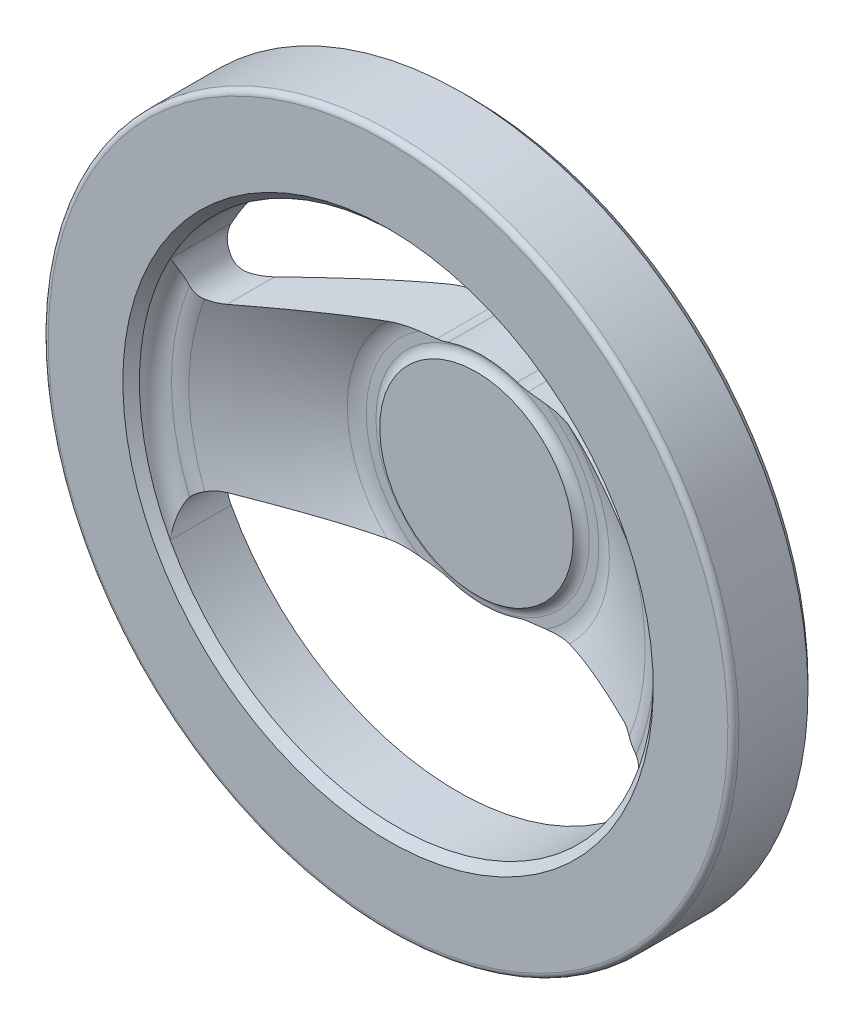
ISO-10303-21;
HEADER;
FILE_DESCRIPTION(('STEP AP214'),'2;1');
FILE_NAME('part.step','',(''),(''),'','','');
FILE_SCHEMA(('AUTOMOTIVE_DESIGN { 1 0 10303 214 1 1 1 1 }'));
ENDSEC;
DATA;
#1=APPLICATION_CONTEXT('core data for automotive mechanical design processes');
#2=APPLICATION_PROTOCOL_DEFINITION('international standard','automotive_design',2000,#1);
#3=PRODUCT_CONTEXT('',#1,'mechanical');
#4=PRODUCT('Part','Part','',(#3));
#5=PRODUCT_RELATED_PRODUCT_CATEGORY('part','',(#4));
#6=PRODUCT_DEFINITION_FORMATION('','',#4);
#7=PRODUCT_DEFINITION_CONTEXT('part definition',#1,'design');
#8=PRODUCT_DEFINITION('design','',#6,#7);
#9=PRODUCT_DEFINITION_SHAPE('','',#8);
#10=(LENGTH_UNIT() NAMED_UNIT(*) SI_UNIT(.MILLI.,.METRE.));
#11=(NAMED_UNIT(*) PLANE_ANGLE_UNIT() SI_UNIT($,.RADIAN.));
#12=(NAMED_UNIT(*) SI_UNIT($,.STERADIAN.) SOLID_ANGLE_UNIT());
#13=UNCERTAINTY_MEASURE_WITH_UNIT(LENGTH_MEASURE(1.E-05),#10,'distance_accuracy_value','');
#14=(GEOMETRIC_REPRESENTATION_CONTEXT(3) GLOBAL_UNCERTAINTY_ASSIGNED_CONTEXT((#13)) GLOBAL_UNIT_ASSIGNED_CONTEXT((#10,
#11,#12)) REPRESENTATION_CONTEXT('',''));
#15=CARTESIAN_POINT('',(0.,0.,0.));
#16=DIRECTION('',(0.,0.,1.));
#17=DIRECTION('',(1.,0.,0.));
#18=AXIS2_PLACEMENT_3D('',#15,#16,#17);
#19=CARTESIAN_POINT('',(0.,0.,27.4796370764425));
#20=DIRECTION('',(0.,0.,1.));
#21=DIRECTION('',(0.,-1.,0.));
#22=AXIS2_PLACEMENT_3D('',#19,#20,#21);
#23=CONICAL_SURFACE('',#22,41.1132449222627,0.879892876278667);
#24=CARTESIAN_POINT('',(-38.267483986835,-15.0305843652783,27.4798370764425));
#25=CARTESIAN_POINT('',(-38.1135719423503,-14.9731183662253,27.3440215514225));
#26=CARTESIAN_POINT('',(-37.956777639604,-14.9231808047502,27.2082455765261));
#27=CARTESIAN_POINT('',(-37.6380776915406,-14.8388065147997,26.9374830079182));
#28=CARTESIAN_POINT('',(-37.4761661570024,-14.8043883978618,26.8024975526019));
#29=CARTESIAN_POINT('',(-37.150779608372,-14.7520426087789,26.5364180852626));
#30=CARTESIAN_POINT('',(-36.9873669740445,-14.7338693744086,26.4052961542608));
#31=CARTESIAN_POINT('',(-36.6574996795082,-14.7137549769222,26.145863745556));
#32=CARTESIAN_POINT('',(-36.491047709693,-14.7118000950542,26.0175509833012));
#33=CARTESIAN_POINT('',(-36.2586362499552,-14.7208486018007,25.8422562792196));
#34=CARTESIAN_POINT('',(-36.1935932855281,-14.7246461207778,25.7936131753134));
#35=CARTESIAN_POINT('',(-36.0630329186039,-14.7348514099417,25.696833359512));
#36=CARTESIAN_POINT('',(-35.9975146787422,-14.7412669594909,25.6486985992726));
#37=CARTESIAN_POINT('',(-35.931878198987,-14.7490140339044,25.60092399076));
#38=B_SPLINE_CURVE_WITH_KNOTS('',3,(#24,#25,#26,#27,#28,#29,#30,#31,#32,#33,#34,#35,#36,#37),
.UNSPECIFIED.,.F.,.F.,(4,2,2,2,2,2,4),(0.,0.639370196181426,1.27950512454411,1.90979143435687,
2.53954454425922,2.78343585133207,3.02805720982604),.UNSPECIFIED.);
#39=CARTESIAN_POINT('',(-38.267257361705,-15.0304997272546,27.4796370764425));
#40=VERTEX_POINT('',#39);
#41=CARTESIAN_POINT('',(-35.932078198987,-14.7489904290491,25.601069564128));
#42=VERTEX_POINT('',#41);
#43=EDGE_CURVE('E645',#40,#42,#38,.T.);
#44=ORIENTED_EDGE('',*,*,#43,.F.);
#45=CARTESIAN_POINT('',(0.,0.,27.4796370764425));
#46=DIRECTION('',(0.,0.,-1.));
#47=DIRECTION('',(0.,1.,0.));
#48=AXIS2_PLACEMENT_3D('',#45,#46,#47);
#49=CIRCLE('',#48,41.1132449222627);
#50=CARTESIAN_POINT('',(-38.267257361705,15.0304997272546,27.4796370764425));
#51=VERTEX_POINT('',#50);
#52=EDGE_CURVE('E738',#40,#51,#49,.T.);
#53=ORIENTED_EDGE('',*,*,#52,.T.);
#54=CARTESIAN_POINT('',(-38.267483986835,15.0305843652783,27.4798370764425));
#55=CARTESIAN_POINT('',(-38.1135719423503,14.9731183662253,27.3440215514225));
#56=CARTESIAN_POINT('',(-37.956777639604,14.9231808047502,27.2082455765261));
#57=CARTESIAN_POINT('',(-37.6380776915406,14.8388065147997,26.9374830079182));
#58=CARTESIAN_POINT('',(-37.4761661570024,14.8043883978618,26.8024975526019));
#59=CARTESIAN_POINT('',(-37.150779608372,14.7520426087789,26.5364180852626));
#60=CARTESIAN_POINT('',(-36.9873669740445,14.7338693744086,26.4052961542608));
#61=CARTESIAN_POINT('',(-36.6574996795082,14.7137549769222,26.145863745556));
#62=CARTESIAN_POINT('',(-36.491047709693,14.7118000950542,26.0175509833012));
#63=CARTESIAN_POINT('',(-36.2586362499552,14.7208486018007,25.8422562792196));
#64=CARTESIAN_POINT('',(-36.1935932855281,14.7246461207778,25.7936131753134));
#65=CARTESIAN_POINT('',(-36.0630329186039,14.7348514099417,25.696833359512));
#66=CARTESIAN_POINT('',(-35.9975146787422,14.7412669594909,25.6486985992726));
#67=CARTESIAN_POINT('',(-35.931878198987,14.7490140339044,25.60092399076));
#68=B_SPLINE_CURVE_WITH_KNOTS('',3,(#54,#55,#56,#57,#58,#59,#60,#61,#62,#63,#64,#65,#66,#67),
.UNSPECIFIED.,.F.,.F.,(4,2,2,2,2,2,4),(0.,0.639370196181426,1.27950512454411,1.90979143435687,
2.53954454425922,2.78343585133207,3.02805720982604),.UNSPECIFIED.);
#69=CARTESIAN_POINT('',(-35.932078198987,14.7489904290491,25.601069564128));
#70=VERTEX_POINT('',#69);
#71=EDGE_CURVE('E376',#51,#70,#68,.T.);
#72=ORIENTED_EDGE('',*,*,#71,.T.);
#73=CARTESIAN_POINT('',(-16.769527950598,17.0102452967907,13.235608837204));
#74=CARTESIAN_POINT('',(-17.1934137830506,16.9602251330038,13.4522539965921));
#75=CARTESIAN_POINT('',(-17.6149416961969,16.9104832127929,13.6735207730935));
#76=CARTESIAN_POINT('',(-18.4536421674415,16.8115133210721,14.1241838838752));
#77=CARTESIAN_POINT('',(-18.8708151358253,16.7622853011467,14.353579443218));
#78=CARTESIAN_POINT('',(-19.7010773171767,16.6643111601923,14.8193330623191));
#79=CARTESIAN_POINT('',(-20.1141681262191,16.6155648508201,15.0556882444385));
#80=CARTESIAN_POINT('',(-20.9368103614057,16.5184898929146,15.5345786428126));
#81=CARTESIAN_POINT('',(-21.3463616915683,16.4701612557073,15.7771140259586));
#82=CARTESIAN_POINT('',(-22.569113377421,16.3258718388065,16.5121522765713));
#83=CARTESIAN_POINT('',(-23.3775350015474,16.230474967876,17.0127229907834));
#84=CARTESIAN_POINT('',(-24.9839829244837,16.0409079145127,18.0306249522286));
#85=CARTESIAN_POINT('',(-25.7820079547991,15.9467378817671,18.5479582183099));
#86=CARTESIAN_POINT('',(-27.3686485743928,15.7595081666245,19.5953388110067));
#87=CARTESIAN_POINT('',(-28.1572726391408,15.6664474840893,20.1253731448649));
#88=CARTESIAN_POINT('',(-29.7273535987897,15.4811718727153,21.1960127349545));
#89=CARTESIAN_POINT('',(-30.508810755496,15.3889569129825,21.7366176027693));
#90=CARTESIAN_POINT('',(-32.0668136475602,15.2051065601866,22.8271695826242));
#91=CARTESIAN_POINT('',(-32.843351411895,15.113472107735,23.3771282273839));
#92=CARTESIAN_POINT('',(-34.0043849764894,14.9764656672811,24.207394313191));
#93=CARTESIAN_POINT('',(-34.3907651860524,14.9308713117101,24.4850361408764));
#94=CARTESIAN_POINT('',(-35.1623660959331,14.8398194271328,25.0419444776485));
#95=CARTESIAN_POINT('',(-35.5475868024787,14.7943618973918,25.3212109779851));
#96=CARTESIAN_POINT('',(-35.932278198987,14.7489668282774,25.601215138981));
#97=B_SPLINE_CURVE_WITH_KNOTS('',3,(#73,#74,#75,#76,#77,#78,#79,#80,#81,#82,#83,#84,#85,#86,#87,
#88,#89,#90,#91,#92,#93,#94,#95,#96),.UNSPECIFIED.,.F.,.F.,(4,2,2,2,2,2,2,2,2,2,2,4),(0.,
1.43591778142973,2.87169903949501,4.30689474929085,5.74212925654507,8.60870634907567,
11.4756299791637,14.3397364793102,17.2037379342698,20.0715716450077,21.5054726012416,
22.939365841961),.UNSPECIFIED.);
#98=CARTESIAN_POINT('',(-16.7699193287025,17.0101991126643,13.2358088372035));
#99=VERTEX_POINT('',#98);
#100=EDGE_CURVE('E860',#99,#70,#97,.T.);
#101=ORIENTED_EDGE('',*,*,#100,.F.);
#102=CARTESIAN_POINT('',(0.,0.,13.235808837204));
#103=DIRECTION('',(0.,0.,-1.));
#104=DIRECTION('',(0.,1.,0.));
#105=AXIS2_PLACEMENT_3D('',#102,#103,#104);
#106=CIRCLE('',#105,23.8867550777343);
#107=CARTESIAN_POINT('',(-16.7699193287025,-17.0101991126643,13.2358088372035));
#108=VERTEX_POINT('',#107);
#109=EDGE_CURVE('E749',#108,#99,#106,.T.);
#110=ORIENTED_EDGE('',*,*,#109,.F.);
#111=CARTESIAN_POINT('',(-16.769527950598,-17.0102452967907,13.235608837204));
#112=CARTESIAN_POINT('',(-17.1934137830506,-16.9602251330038,13.4522539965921));
#113=CARTESIAN_POINT('',(-17.6149416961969,-16.9104832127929,13.6735207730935));
#114=CARTESIAN_POINT('',(-18.4536421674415,-16.8115133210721,14.1241838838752));
#115=CARTESIAN_POINT('',(-18.8708151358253,-16.7622853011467,14.353579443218));
#116=CARTESIAN_POINT('',(-19.7010773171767,-16.6643111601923,14.8193330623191));
#117=CARTESIAN_POINT('',(-20.1141681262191,-16.6155648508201,15.0556882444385));
#118=CARTESIAN_POINT('',(-20.9368103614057,-16.5184898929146,15.5345786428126));
#119=CARTESIAN_POINT('',(-21.3463616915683,-16.4701612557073,15.7771140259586));
#120=CARTESIAN_POINT('',(-22.569113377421,-16.3258718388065,16.5121522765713));
#121=CARTESIAN_POINT('',(-23.3775350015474,-16.230474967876,17.0127229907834));
#122=CARTESIAN_POINT('',(-24.9839829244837,-16.0409079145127,18.0306249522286));
#123=CARTESIAN_POINT('',(-25.7820079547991,-15.9467378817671,18.5479582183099));
#124=CARTESIAN_POINT('',(-27.3686485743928,-15.7595081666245,19.5953388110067));
#125=CARTESIAN_POINT('',(-28.1572726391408,-15.6664474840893,20.1253731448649));
#126=CARTESIAN_POINT('',(-29.7273535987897,-15.4811718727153,21.1960127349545));
#127=CARTESIAN_POINT('',(-30.508810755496,-15.3889569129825,21.7366176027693));
#128=CARTESIAN_POINT('',(-32.0668136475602,-15.2051065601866,22.8271695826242));
#129=CARTESIAN_POINT('',(-32.843351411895,-15.113472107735,23.3771282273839));
#130=CARTESIAN_POINT('',(-34.0043849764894,-14.9764656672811,24.207394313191));
#131=CARTESIAN_POINT('',(-34.3907651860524,-14.9308713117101,24.4850361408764));
#132=CARTESIAN_POINT('',(-35.1623660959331,-14.8398194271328,25.0419444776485));
#133=CARTESIAN_POINT('',(-35.5475868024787,-14.7943618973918,25.3212109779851));
#134=CARTESIAN_POINT('',(-35.932278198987,-14.7489668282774,25.601215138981));
#135=B_SPLINE_CURVE_WITH_KNOTS('',3,(#111,#112,#113,#114,#115,#116,#117,#118,#119,#120,#121,
#122,#123,#124,#125,#126,#127,#128,#129,#130,#131,#132,#133,#134),.UNSPECIFIED.,.F.,.F.,(4,2,2,
2,2,2,2,2,2,2,2,4),(0.,1.43591778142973,2.87169903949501,4.30689474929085,5.74212925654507,
8.60870634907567,11.4756299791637,14.3397364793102,17.2037379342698,20.0715716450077,
21.5054726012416,22.939365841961),.UNSPECIFIED.);
#136=EDGE_CURVE('E562',#108,#42,#135,.T.);
#137=ORIENTED_EDGE('',*,*,#136,.T.);
#138=EDGE_LOOP('',(#44,#53,#72,#101,#110,#137));
#139=FACE_BOUND('',#138,.T.);
#140=ADVANCED_FACE('F14',(#139),#23,.T.);
#141=CARTESIAN_POINT('',(16.769527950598,-17.0102452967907,13.235608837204));
#142=CARTESIAN_POINT('',(17.1934137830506,-16.9602251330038,13.4522539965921));
#143=CARTESIAN_POINT('',(17.6149416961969,-16.9104832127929,13.6735207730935));
#144=CARTESIAN_POINT('',(18.4536421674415,-16.8115133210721,14.1241838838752));
#145=CARTESIAN_POINT('',(18.8708151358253,-16.7622853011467,14.353579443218));
#146=CARTESIAN_POINT('',(19.7010773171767,-16.6643111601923,14.8193330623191));
#147=CARTESIAN_POINT('',(20.1141681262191,-16.6155648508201,15.0556882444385));
#148=CARTESIAN_POINT('',(20.9368103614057,-16.5184898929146,15.5345786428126));
#149=CARTESIAN_POINT('',(21.3463616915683,-16.4701612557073,15.7771140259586));
#150=CARTESIAN_POINT('',(22.569113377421,-16.3258718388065,16.5121522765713));
#151=CARTESIAN_POINT('',(23.3775350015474,-16.230474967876,17.0127229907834));
#152=CARTESIAN_POINT('',(24.9839829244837,-16.0409079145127,18.0306249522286));
#153=CARTESIAN_POINT('',(25.7820079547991,-15.9467378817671,18.5479582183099));
#154=CARTESIAN_POINT('',(27.3686485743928,-15.7595081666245,19.5953388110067));
#155=CARTESIAN_POINT('',(28.1572726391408,-15.6664474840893,20.1253731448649));
#156=CARTESIAN_POINT('',(29.7273535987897,-15.4811718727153,21.1960127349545));
#157=CARTESIAN_POINT('',(30.508810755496,-15.3889569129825,21.7366176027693));
#158=CARTESIAN_POINT('',(32.0668136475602,-15.2051065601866,22.8271695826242));
#159=CARTESIAN_POINT('',(32.843351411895,-15.113472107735,23.3771282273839));
#160=CARTESIAN_POINT('',(34.0043849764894,-14.9764656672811,24.207394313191));
#161=CARTESIAN_POINT('',(34.3907651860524,-14.93087131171,24.4850361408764));
#162=CARTESIAN_POINT('',(35.1623660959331,-14.8398194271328,25.0419444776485));
#163=CARTESIAN_POINT('',(35.5475868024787,-14.7943618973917,25.3212109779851));
#164=CARTESIAN_POINT('',(35.932278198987,-14.7489668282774,25.601215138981));
#165=B_SPLINE_CURVE_WITH_KNOTS('',3,(#141,#142,#143,#144,#145,#146,#147,#148,#149,#150,#151,
#152,#153,#154,#155,#156,#157,#158,#159,#160,#161,#162,#163,#164),.UNSPECIFIED.,.F.,.F.,(4,2,2,
2,2,2,2,2,2,2,2,4),(0.,1.43591778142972,2.87169903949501,4.30689474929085,5.74212925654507,
8.60870634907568,11.4756299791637,14.3397364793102,17.2037379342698,20.0715716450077,
21.5054726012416,22.939365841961),.UNSPECIFIED.);
#166=CARTESIAN_POINT('',(16.7699193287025,-17.0101991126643,13.2358088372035));
#167=VERTEX_POINT('',#166);
#168=CARTESIAN_POINT('',(35.932078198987,-14.7489904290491,25.601069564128));
#169=VERTEX_POINT('',#168);
#170=EDGE_CURVE('E249',#167,#169,#165,.T.);
#171=ORIENTED_EDGE('',*,*,#170,.F.);
#172=CARTESIAN_POINT('',(16.7699193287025,17.0101991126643,13.2358088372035));
#173=VERTEX_POINT('',#172);
#174=EDGE_CURVE('E746',#173,#167,#106,.T.);
#175=ORIENTED_EDGE('',*,*,#174,.F.);
#176=CARTESIAN_POINT('',(16.769527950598,17.0102452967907,13.235608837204));
#177=CARTESIAN_POINT('',(17.1934137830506,16.9602251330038,13.4522539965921));
#178=CARTESIAN_POINT('',(17.6149416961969,16.9104832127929,13.6735207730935));
#179=CARTESIAN_POINT('',(18.4536421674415,16.8115133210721,14.1241838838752));
#180=CARTESIAN_POINT('',(18.8708151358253,16.7622853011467,14.353579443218));
#181=CARTESIAN_POINT('',(19.7010773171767,16.6643111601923,14.8193330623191));
#182=CARTESIAN_POINT('',(20.1141681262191,16.6155648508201,15.0556882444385));
#183=CARTESIAN_POINT('',(20.9368103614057,16.5184898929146,15.5345786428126));
#184=CARTESIAN_POINT('',(21.3463616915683,16.4701612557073,15.7771140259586));
#185=CARTESIAN_POINT('',(22.569113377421,16.3258718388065,16.5121522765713));
#186=CARTESIAN_POINT('',(23.3775350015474,16.230474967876,17.0127229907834));
#187=CARTESIAN_POINT('',(24.9839829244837,16.0409079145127,18.0306249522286));
#188=CARTESIAN_POINT('',(25.7820079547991,15.9467378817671,18.5479582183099));
#189=CARTESIAN_POINT('',(27.3686485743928,15.7595081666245,19.5953388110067));
#190=CARTESIAN_POINT('',(28.1572726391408,15.6664474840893,20.1253731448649));
#191=CARTESIAN_POINT('',(29.7273535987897,15.4811718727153,21.1960127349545));
#192=CARTESIAN_POINT('',(30.508810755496,15.3889569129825,21.7366176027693));
#193=CARTESIAN_POINT('',(32.0668136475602,15.2051065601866,22.8271695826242));
#194=CARTESIAN_POINT('',(32.843351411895,15.113472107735,23.3771282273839));
#195=CARTESIAN_POINT('',(34.0043849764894,14.9764656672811,24.207394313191));
#196=CARTESIAN_POINT('',(34.3907651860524,14.93087131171,24.4850361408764));
#197=CARTESIAN_POINT('',(35.1623660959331,14.8398194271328,25.0419444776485));
#198=CARTESIAN_POINT('',(35.5475868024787,14.7943618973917,25.3212109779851));
#199=CARTESIAN_POINT('',(35.932278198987,14.7489668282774,25.601215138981));
#200=B_SPLINE_CURVE_WITH_KNOTS('',3,(#176,#177,#178,#179,#180,#181,#182,#183,#184,#185,#186,
#187,#188,#189,#190,#191,#192,#193,#194,#195,#196,#197,#198,#199),.UNSPECIFIED.,.F.,.F.,(4,2,2,
2,2,2,2,2,2,2,2,4),(0.,1.43591778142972,2.87169903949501,4.30689474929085,5.74212925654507,
8.60870634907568,11.4756299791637,14.3397364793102,17.2037379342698,20.0715716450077,
21.5054726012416,22.939365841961),.UNSPECIFIED.);
#201=CARTESIAN_POINT('',(35.932078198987,14.7489904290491,25.601069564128));
#202=VERTEX_POINT('',#201);
#203=EDGE_CURVE('E950',#173,#202,#200,.T.);
#204=ORIENTED_EDGE('',*,*,#203,.T.);
#205=CARTESIAN_POINT('',(38.267483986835,15.0305843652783,27.4798370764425));
#206=CARTESIAN_POINT('',(38.1135719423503,14.9731183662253,27.3440215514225));
#207=CARTESIAN_POINT('',(37.956777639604,14.9231808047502,27.2082455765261));
#208=CARTESIAN_POINT('',(37.6380776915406,14.8388065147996,26.9374830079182));
#209=CARTESIAN_POINT('',(37.4761661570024,14.8043883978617,26.8024975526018));
#210=CARTESIAN_POINT('',(37.150779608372,14.7520426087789,26.5364180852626));
#211=CARTESIAN_POINT('',(36.9873669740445,14.7338693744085,26.4052961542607));
#212=CARTESIAN_POINT('',(36.6574996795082,14.7137549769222,26.1458637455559));
#213=CARTESIAN_POINT('',(36.4910477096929,14.7118000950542,26.0175509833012));
#214=CARTESIAN_POINT('',(36.2586362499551,14.7208486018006,25.8422562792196));
#215=CARTESIAN_POINT('',(36.193593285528,14.7246461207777,25.7936131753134));
#216=CARTESIAN_POINT('',(36.0630329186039,14.7348514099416,25.696833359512));
#217=CARTESIAN_POINT('',(35.9975146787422,14.7412669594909,25.6486985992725));
#218=CARTESIAN_POINT('',(35.931878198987,14.7490140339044,25.60092399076));
#219=B_SPLINE_CURVE_WITH_KNOTS('',3,(#205,#206,#207,#208,#209,#210,#211,#212,#213,#214,#215,
#216,#217,#218),.UNSPECIFIED.,.F.,.F.,(4,2,2,2,2,2,4),(0.,0.639370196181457,1.27950512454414,
1.90979143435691,2.53954454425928,2.78343585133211,3.02805720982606),.UNSPECIFIED.);
#220=CARTESIAN_POINT('',(38.267257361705,15.0304997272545,27.4796370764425));
#221=VERTEX_POINT('',#220);
#222=EDGE_CURVE('E473',#221,#202,#219,.T.);
#223=ORIENTED_EDGE('',*,*,#222,.F.);
#224=CARTESIAN_POINT('',(38.267257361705,-15.0304997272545,27.4796370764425));
#225=VERTEX_POINT('',#224);
#226=EDGE_CURVE('E274',#221,#225,#49,.T.);
#227=ORIENTED_EDGE('',*,*,#226,.T.);
#228=CARTESIAN_POINT('',(38.267483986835,-15.0305843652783,27.4798370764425));
#229=CARTESIAN_POINT('',(38.1135719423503,-14.9731183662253,27.3440215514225));
#230=CARTESIAN_POINT('',(37.956777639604,-14.9231808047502,27.2082455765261));
#231=CARTESIAN_POINT('',(37.6380776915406,-14.8388065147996,26.9374830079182));
#232=CARTESIAN_POINT('',(37.4761661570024,-14.8043883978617,26.8024975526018));
#233=CARTESIAN_POINT('',(37.150779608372,-14.7520426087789,26.5364180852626));
#234=CARTESIAN_POINT('',(36.9873669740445,-14.7338693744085,26.4052961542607));
#235=CARTESIAN_POINT('',(36.6574996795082,-14.7137549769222,26.1458637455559));
#236=CARTESIAN_POINT('',(36.4910477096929,-14.7118000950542,26.0175509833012));
#237=CARTESIAN_POINT('',(36.2586362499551,-14.7208486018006,25.8422562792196));
#238=CARTESIAN_POINT('',(36.193593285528,-14.7246461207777,25.7936131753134));
#239=CARTESIAN_POINT('',(36.0630329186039,-14.7348514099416,25.696833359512));
#240=CARTESIAN_POINT('',(35.9975146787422,-14.7412669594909,25.6486985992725));
#241=CARTESIAN_POINT('',(35.931878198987,-14.7490140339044,25.60092399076));
#242=B_SPLINE_CURVE_WITH_KNOTS('',3,(#228,#229,#230,#231,#232,#233,#234,#235,#236,#237,#238,
#239,#240,#241),.UNSPECIFIED.,.F.,.F.,(4,2,2,2,2,2,4),(0.,0.639370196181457,1.27950512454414,
1.90979143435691,2.53954454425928,2.78343585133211,3.02805720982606),.UNSPECIFIED.);
#243=EDGE_CURVE('E263',#225,#169,#242,.T.);
#244=ORIENTED_EDGE('',*,*,#243,.T.);
#245=EDGE_LOOP('',(#171,#175,#204,#223,#227,#244));
#246=FACE_BOUND('',#245,.T.);
#247=ADVANCED_FACE('F271',(#246),#23,.T.);
#248=CARTESIAN_POINT('',(0.,0.,17.0891619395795));
#249=DIRECTION('',(0.,0.,-1.));
#250=DIRECTION('',(0.,1.,0.));
#251=AXIS2_PLACEMENT_3D('',#248,#249,#250);
#252=TOROIDAL_SURFACE('',#251,20.7005865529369,5.00000000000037);
#253=CARTESIAN_POINT('',(13.119225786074,-17.4409950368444,12.2170834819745));
#254=CARTESIAN_POINT('',(13.2772810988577,-17.4223439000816,12.2355657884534));
#255=CARTESIAN_POINT('',(13.435055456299,-17.4037259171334,12.2563849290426));
#256=CARTESIAN_POINT('',(13.7498861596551,-17.3665746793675,12.3031966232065));
#257=CARTESIAN_POINT('',(13.9069422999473,-17.3480414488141,12.3291905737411));
#258=CARTESIAN_POINT('',(14.3742005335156,-17.2929031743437,12.4152131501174));
#259=CARTESIAN_POINT('',(14.6829931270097,-17.2564644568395,12.4835593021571));
#260=CARTESIAN_POINT('',(15.141204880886,-17.2023937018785,12.6059403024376));
#261=CARTESIAN_POINT('',(15.293264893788,-17.1844500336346,12.6500993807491));
#262=CARTESIAN_POINT('',(15.5951335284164,-17.1488283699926,12.7456068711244));
#263=CARTESIAN_POINT('',(15.7449425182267,-17.1311503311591,12.7969540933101));
#264=CARTESIAN_POINT('',(16.0428533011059,-17.0959957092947,12.9078379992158));
#265=CARTESIAN_POINT('',(16.1909335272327,-17.0785216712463,12.9674338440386));
#266=CARTESIAN_POINT('',(16.4835253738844,-17.0439947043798,13.0951658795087));
#267=CARTESIAN_POINT('',(16.6280345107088,-17.0269420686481,13.1633078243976));
#268=CARTESIAN_POINT('',(16.7703106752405,-17.0101529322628,13.236008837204));
#269=B_SPLINE_CURVE_WITH_KNOTS('',3,(#253,#254,#255,#256,#257,#258,#259,#260,#261,#262,#263,
#264,#265,#266,#267,#268),.UNSPECIFIED.,.F.,.F.,(4,2,2,2,2,2,2,4),(0.,0.480615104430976,
0.96136012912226,1.91526480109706,2.39319138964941,2.87103895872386,3.35251088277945,
3.83430874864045),.UNSPECIFIED.);
#270=CARTESIAN_POINT('',(13.1209358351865,-17.4407932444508,12.217283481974));
#271=VERTEX_POINT('',#270);
#272=EDGE_CURVE('E255',#271,#167,#269,.T.);
#273=ORIENTED_EDGE('',*,*,#272,.F.);
#274=CARTESIAN_POINT('',(0.,0.,12.2172834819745));
#275=DIRECTION('',(0.,0.,-1.));
#276=DIRECTION('',(0.,1.,0.));
#277=AXIS2_PLACEMENT_3D('',#274,#275,#276);
#278=CIRCLE('',#277,21.8252199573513);
#279=CARTESIAN_POINT('',(13.1209358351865,17.4407932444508,12.217283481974));
#280=VERTEX_POINT('',#279);
#281=EDGE_CURVE('E838',#280,#271,#278,.T.);
#282=ORIENTED_EDGE('',*,*,#281,.F.);
#283=CARTESIAN_POINT('',(13.119225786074,17.4409950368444,12.2170834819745));
#284=CARTESIAN_POINT('',(13.2772810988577,17.4223439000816,12.2355657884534));
#285=CARTESIAN_POINT('',(13.435055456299,17.4037259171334,12.2563849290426));
#286=CARTESIAN_POINT('',(13.7498861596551,17.3665746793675,12.3031966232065));
#287=CARTESIAN_POINT('',(13.9069422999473,17.3480414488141,12.3291905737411));
#288=CARTESIAN_POINT('',(14.3742005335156,17.2929031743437,12.4152131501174));
#289=CARTESIAN_POINT('',(14.6829931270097,17.2564644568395,12.4835593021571));
#290=CARTESIAN_POINT('',(15.141204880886,17.2023937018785,12.6059403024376));
#291=CARTESIAN_POINT('',(15.293264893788,17.1844500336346,12.6500993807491));
#292=CARTESIAN_POINT('',(15.5951335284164,17.1488283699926,12.7456068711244));
#293=CARTESIAN_POINT('',(15.7449425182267,17.1311503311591,12.7969540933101));
#294=CARTESIAN_POINT('',(16.0428533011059,17.0959957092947,12.9078379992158));
#295=CARTESIAN_POINT('',(16.1909335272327,17.0785216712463,12.9674338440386));
#296=CARTESIAN_POINT('',(16.4835253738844,17.0439947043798,13.0951658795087));
#297=CARTESIAN_POINT('',(16.6280345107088,17.0269420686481,13.1633078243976));
#298=CARTESIAN_POINT('',(16.7703106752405,17.0101529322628,13.236008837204));
#299=B_SPLINE_CURVE_WITH_KNOTS('',3,(#283,#284,#285,#286,#287,#288,#289,#290,#291,#292,#293,
#294,#295,#296,#297,#298),.UNSPECIFIED.,.F.,.F.,(4,2,2,2,2,2,2,4),(0.,0.480615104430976,
0.96136012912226,1.91526480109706,2.39319138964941,2.87103895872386,3.35251088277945,
3.83430874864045),.UNSPECIFIED.);
#300=EDGE_CURVE('E881',#280,#173,#299,.T.);
#301=ORIENTED_EDGE('',*,*,#300,.T.);
#302=ORIENTED_EDGE('',*,*,#174,.T.);
#303=EDGE_LOOP('',(#273,#282,#301,#302));
#304=FACE_BOUND('',#303,.T.);
#305=ADVANCED_FACE('F736',(#304),#252,.T.);
#306=CARTESIAN_POINT('',(0.,0.,28.8878987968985));
#307=DIRECTION('',(0.,0.,-1.));
#308=DIRECTION('',(0.,1.,0.));
#309=AXIS2_PLACEMENT_3D('',#306,#307,#308);
#310=TOROIDAL_SURFACE('',#309,21.0525960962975,5.);
#311=CARTESIAN_POINT('',(0.,0.,23.8878987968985));
#312=DIRECTION('',(0.,0.,-1.));
#313=DIRECTION('',(0.,1.,0.));
#314=AXIS2_PLACEMENT_3D('',#311,#312,#313);
#315=CIRCLE('',#314,21.0525960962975);
#316=CARTESIAN_POINT('',(11.503816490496,17.6316195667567,23.8878987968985));
#317=VERTEX_POINT('',#316);
#318=CARTESIAN_POINT('',(11.503816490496,-17.6316195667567,23.8878987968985));
#319=VERTEX_POINT('',#318);
#320=EDGE_CURVE('E816',#317,#319,#315,.T.);
#321=ORIENTED_EDGE('',*,*,#320,.T.);
#322=CARTESIAN_POINT('',(8.2873152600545,-18.0111791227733,24.0406111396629));
#323=CARTESIAN_POINT('',(8.55198514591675,-17.9799470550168,24.0198087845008));
#324=CARTESIAN_POINT('',(8.81675144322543,-17.9487036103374,23.9999814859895));
#325=CARTESIAN_POINT('',(9.34660991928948,-17.8861782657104,23.9638275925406));
#326=CARTESIAN_POINT('',(9.61170217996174,-17.8548963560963,23.9475022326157));
#327=CARTESIAN_POINT('',(10.1438323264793,-17.7921029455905,23.9198326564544));
#328=CARTESIAN_POINT('',(10.4108719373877,-17.7605912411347,23.9085205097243));
#329=CARTESIAN_POINT('',(10.9451321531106,-17.6975464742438,23.8926891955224));
#330=CARTESIAN_POINT('',(11.2123527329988,-17.6660134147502,23.888169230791));
#331=CARTESIAN_POINT('',(11.7400774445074,-17.6037398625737,23.8876583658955));
#332=CARTESIAN_POINT('',(12.0005809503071,-17.5729994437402,23.8914551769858));
#333=CARTESIAN_POINT('',(12.5212597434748,-17.5115573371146,23.9088416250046));
#334=CARTESIAN_POINT('',(12.7814350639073,-17.4808556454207,23.9224301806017));
#335=CARTESIAN_POINT('',(13.3003366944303,-17.4196232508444,23.9611597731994));
#336=CARTESIAN_POINT('',(13.5590649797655,-17.3890923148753,23.9862732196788));
#337=CARTESIAN_POINT('',(14.0748464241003,-17.3282281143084,24.0499670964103));
#338=CARTESIAN_POINT('',(14.3319001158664,-17.2978947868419,24.0885430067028));
#339=CARTESIAN_POINT('',(14.7502432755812,-17.2485286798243,24.1643882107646));
#340=CARTESIAN_POINT('',(14.9123640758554,-17.2293977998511,24.1970312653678));
#341=CARTESIAN_POINT('',(15.2351117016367,-17.1913123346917,24.2691966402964));
#342=CARTESIAN_POINT('',(15.3957384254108,-17.1723577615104,24.3087194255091));
#343=CARTESIAN_POINT('',(15.7161972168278,-17.1345423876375,24.3955646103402));
#344=CARTESIAN_POINT('',(15.8760144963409,-17.1156833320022,24.442942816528));
#345=CARTESIAN_POINT('',(16.1930927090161,-17.0782668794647,24.545966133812));
#346=CARTESIAN_POINT('',(16.3503521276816,-17.0597096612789,24.601615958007));
#347=CARTESIAN_POINT('',(16.5059680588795,-17.0413463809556,24.661713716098));
#348=B_SPLINE_CURVE_WITH_KNOTS('',3,(#322,#323,#324,#325,#326,#327,#328,#329,#330,#331,#332,
#333,#334,#335,#336,#337,#338,#339,#340,#341,#342,#343,#344,#345,#346,#347),.UNSPECIFIED.,.F.,
.F.,(4,2,2,2,2,2,2,2,2,2,2,2,4),(0.,0.801981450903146,1.60424526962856,2.41156959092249,
3.21879914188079,4.0056644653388,4.79244290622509,5.57734755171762,6.36198892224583,
6.86129367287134,7.3606321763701,7.86368334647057,8.36702225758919),.UNSPECIFIED.);
#349=CARTESIAN_POINT('',(16.505450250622,-17.041407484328,24.661513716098));
#350=VERTEX_POINT('',#349);
#351=EDGE_CURVE('E575',#319,#350,#348,.T.);
#352=ORIENTED_EDGE('',*,*,#351,.T.);
#353=CARTESIAN_POINT('',(0.,0.,24.661513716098));
#354=DIRECTION('',(0.,0.,-1.));
#355=DIRECTION('',(0.,1.,0.));
#356=AXIS2_PLACEMENT_3D('',#353,#354,#355);
#357=CIRCLE('',#356,23.7242377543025);
#358=CARTESIAN_POINT('',(16.505450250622,17.041407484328,24.661513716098));
#359=VERTEX_POINT('',#358);
#360=EDGE_CURVE('E812',#359,#350,#357,.T.);
#361=ORIENTED_EDGE('',*,*,#360,.F.);
#362=CARTESIAN_POINT('',(8.2873152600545,18.0111791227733,24.0406111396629));
#363=CARTESIAN_POINT('',(8.55198514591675,17.9799470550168,24.0198087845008));
#364=CARTESIAN_POINT('',(8.81675144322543,17.9487036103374,23.9999814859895));
#365=CARTESIAN_POINT('',(9.34660991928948,17.8861782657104,23.9638275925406));
#366=CARTESIAN_POINT('',(9.61170217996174,17.8548963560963,23.9475022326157));
#367=CARTESIAN_POINT('',(10.1438323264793,17.7921029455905,23.9198326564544));
#368=CARTESIAN_POINT('',(10.4108719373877,17.7605912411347,23.9085205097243));
#369=CARTESIAN_POINT('',(10.9451321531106,17.6975464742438,23.8926891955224));
#370=CARTESIAN_POINT('',(11.2123527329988,17.6660134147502,23.888169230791));
#371=CARTESIAN_POINT('',(11.7400774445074,17.6037398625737,23.8876583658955));
#372=CARTESIAN_POINT('',(12.0005809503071,17.5729994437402,23.8914551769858));
#373=CARTESIAN_POINT('',(12.5212597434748,17.5115573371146,23.9088416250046));
#374=CARTESIAN_POINT('',(12.7814350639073,17.4808556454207,23.9224301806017));
#375=CARTESIAN_POINT('',(13.3003366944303,17.4196232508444,23.9611597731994));
#376=CARTESIAN_POINT('',(13.5590649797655,17.3890923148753,23.9862732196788));
#377=CARTESIAN_POINT('',(14.0748464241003,17.3282281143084,24.0499670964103));
#378=CARTESIAN_POINT('',(14.3319001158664,17.2978947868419,24.0885430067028));
#379=CARTESIAN_POINT('',(14.7502432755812,17.2485286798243,24.1643882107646));
#380=CARTESIAN_POINT('',(14.9123640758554,17.2293977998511,24.1970312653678));
#381=CARTESIAN_POINT('',(15.2351117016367,17.1913123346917,24.2691966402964));
#382=CARTESIAN_POINT('',(15.3957384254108,17.1723577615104,24.3087194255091));
#383=CARTESIAN_POINT('',(15.7161972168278,17.1345423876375,24.3955646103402));
#384=CARTESIAN_POINT('',(15.8760144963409,17.1156833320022,24.442942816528));
#385=CARTESIAN_POINT('',(16.1930927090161,17.0782668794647,24.545966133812));
#386=CARTESIAN_POINT('',(16.3503521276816,17.0597096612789,24.601615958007));
#387=CARTESIAN_POINT('',(16.5059680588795,17.0413463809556,24.661713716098));
#388=B_SPLINE_CURVE_WITH_KNOTS('',3,(#362,#363,#364,#365,#366,#367,#368,#369,#370,#371,#372,
#373,#374,#375,#376,#377,#378,#379,#380,#381,#382,#383,#384,#385,#386,#387),.UNSPECIFIED.,.F.,
.F.,(4,2,2,2,2,2,2,2,2,2,2,2,4),(0.,0.801981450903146,1.60424526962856,2.41156959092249,
3.21879914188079,4.0056644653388,4.79244290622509,5.57734755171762,6.36198892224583,
6.86129367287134,7.3606321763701,7.86368334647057,8.36702225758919),.UNSPECIFIED.);
#389=EDGE_CURVE('E929',#317,#359,#388,.T.);
#390=ORIENTED_EDGE('',*,*,#389,.F.);
#391=EDGE_LOOP('',(#321,#352,#361,#390));
#392=FACE_BOUND('',#391,.T.);
#393=ADVANCED_FACE('F599',(#392),#310,.F.);
#394=CARTESIAN_POINT('',(0.,0.,35.7569636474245));
#395=DIRECTION('',(0.,0.,1.));
#396=DIRECTION('',(0.,-1.,0.));
#397=AXIS2_PLACEMENT_3D('',#394,#395,#396);
#398=CONICAL_SURFACE('',#397,41.2766081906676,1.00708339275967);
#399=CARTESIAN_POINT('',(0.,0.,35.7569636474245));
#400=DIRECTION('',(0.,0.,-1.));
#401=DIRECTION('',(0.,1.,0.));
#402=AXIS2_PLACEMENT_3D('',#399,#400,#401);
#403=CIRCLE('',#402,41.2766081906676);
#404=CARTESIAN_POINT('',(-38.4193432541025,-15.0901440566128,35.7569636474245));
#405=VERTEX_POINT('',#404);
#406=CARTESIAN_POINT('',(-38.4193432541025,15.0901440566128,35.7569636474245));
#407=VERTEX_POINT('',#406);
#408=EDGE_CURVE('E806',#405,#407,#403,.T.);
#409=ORIENTED_EDGE('',*,*,#408,.F.);
#410=CARTESIAN_POINT('',(-38.419635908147,-15.0902643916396,35.7571636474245));
#411=CARTESIAN_POINT('',(-38.2513528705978,-15.0210682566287,35.642169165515));
#412=CARTESIAN_POINT('',(-38.0793263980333,-14.9610610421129,35.527075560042));
#413=CARTESIAN_POINT('',(-37.728981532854,-14.8599620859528,35.2975826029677));
#414=CARTESIAN_POINT('',(-37.550654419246,-14.818897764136,35.1831844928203));
#415=CARTESIAN_POINT('',(-37.193161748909,-14.7570764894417,34.9586771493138));
#416=CARTESIAN_POINT('',(-37.0140911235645,-14.7359141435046,34.8485282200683));
#417=CARTESIAN_POINT('',(-36.6530854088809,-14.7130959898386,34.6312737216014));
#418=CARTESIAN_POINT('',(-36.4711538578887,-14.7114177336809,34.5241647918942));
#419=CARTESIAN_POINT('',(-36.229322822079,-14.7225274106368,34.3851459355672));
#420=CARTESIAN_POINT('',(-36.1700223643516,-14.726307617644,34.3513220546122));
#421=CARTESIAN_POINT('',(-36.0511177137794,-14.736027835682,34.284047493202));
#422=CARTESIAN_POINT('',(-35.991513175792,-14.7419751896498,34.2505984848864));
#423=CARTESIAN_POINT('',(-35.931878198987,-14.7490140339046,34.2174143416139));
#424=B_SPLINE_CURVE_WITH_KNOTS('',3,(#410,#411,#412,#413,#414,#415,#416,#417,#418,#419,#420,
#421,#422,#423),.UNSPECIFIED.,.F.,.F.,(4,2,2,2,2,2,4),(0.,0.645556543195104,1.29204461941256,
1.92505912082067,2.55734422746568,2.76243760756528,2.96823246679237),.UNSPECIFIED.);
#425=CARTESIAN_POINT('',(-35.932078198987,-14.7489904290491,34.2175256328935));
#426=VERTEX_POINT('',#425);
#427=EDGE_CURVE('E279',#405,#426,#424,.T.);
#428=ORIENTED_EDGE('',*,*,#427,.T.);
#429=CARTESIAN_POINT('',(-16.5049323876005,-17.0414685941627,24.661313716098));
#430=CARTESIAN_POINT('',(-16.926333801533,-16.9917416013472,24.8240790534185));
#431=CARTESIAN_POINT('',(-17.3462237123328,-16.9421929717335,24.990766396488));
#432=CARTESIAN_POINT('',(-18.1831711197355,-16.8434299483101,25.3311281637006));
#433=CARTESIAN_POINT('',(-18.6002288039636,-16.79421553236,25.504802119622));
#434=CARTESIAN_POINT('',(-19.4316329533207,-16.6961066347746,25.8582487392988));
#435=CARTESIAN_POINT('',(-19.8459802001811,-16.647212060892,26.0380195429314));
#436=CARTESIAN_POINT('',(-20.6723065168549,-16.549702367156,26.4030093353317));
#437=CARTESIAN_POINT('',(-21.0842855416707,-16.5010872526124,26.588228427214));
#438=CARTESIAN_POINT('',(-22.3160880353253,-16.3557298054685,27.1506976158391));
#439=CARTESIAN_POINT('',(-23.132674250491,-16.2593694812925,27.5351443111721));
#440=CARTESIAN_POINT('',(-24.7586747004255,-16.0674951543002,28.3192234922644));
#441=CARTESIAN_POINT('',(-25.5680882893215,-15.9719812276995,28.718857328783));
#442=CARTESIAN_POINT('',(-27.1802481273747,-15.7817401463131,29.5299463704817));
#443=CARTESIAN_POINT('',(-27.9829991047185,-15.6870124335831,29.9413920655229));
#444=CARTESIAN_POINT('',(-29.5834370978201,-15.4981545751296,30.7740798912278));
#445=CARTESIAN_POINT('',(-30.381124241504,-15.4040244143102,31.1953217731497));
#446=CARTESIAN_POINT('',(-31.9731152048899,-15.2161633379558,32.0462859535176));
#447=CARTESIAN_POINT('',(-32.7674144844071,-15.1224329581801,32.4760168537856));
#448=CARTESIAN_POINT('',(-33.9561637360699,-14.9821559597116,33.1255974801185));
#449=CARTESIAN_POINT('',(-34.3519608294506,-14.9354503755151,33.342953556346));
#450=CARTESIAN_POINT('',(-35.1427245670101,-14.8421372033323,33.7791880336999));
#451=CARTESIAN_POINT('',(-35.5376912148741,-14.7955296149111,33.9980664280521));
#452=CARTESIAN_POINT('',(-35.932278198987,-14.7489668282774,34.217636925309));
#453=B_SPLINE_CURVE_WITH_KNOTS('',3,(#429,#430,#431,#432,#433,#434,#435,#436,#437,#438,#439,
#440,#441,#442,#443,#444,#445,#446,#447,#448,#449,#450,#451,#452),.UNSPECIFIED.,.F.,.F.,(4,2,2,
2,2,2,2,2,2,2,2,4),(0.,1.36337156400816,2.72665191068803,4.0895200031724,5.4524139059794,
8.17525640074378,10.8983416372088,13.6192927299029,16.3401748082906,19.063971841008,
20.4258516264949,21.7877253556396),.UNSPECIFIED.);
#454=CARTESIAN_POINT('',(-16.505450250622,-17.041407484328,24.661513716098));
#455=VERTEX_POINT('',#454);
#456=EDGE_CURVE('E527',#455,#426,#453,.T.);
#457=ORIENTED_EDGE('',*,*,#456,.F.);
#458=CARTESIAN_POINT('',(-16.505450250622,17.041407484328,24.661513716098));
#459=VERTEX_POINT('',#458);
#460=EDGE_CURVE('E811',#455,#459,#357,.T.);
#461=ORIENTED_EDGE('',*,*,#460,.T.);
#462=CARTESIAN_POINT('',(-16.5049323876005,17.0414685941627,24.661313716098));
#463=CARTESIAN_POINT('',(-16.926333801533,16.9917416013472,24.8240790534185));
#464=CARTESIAN_POINT('',(-17.3462237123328,16.9421929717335,24.990766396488));
#465=CARTESIAN_POINT('',(-18.1831711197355,16.8434299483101,25.3311281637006));
#466=CARTESIAN_POINT('',(-18.6002288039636,16.79421553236,25.504802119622));
#467=CARTESIAN_POINT('',(-19.4316329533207,16.6961066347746,25.8582487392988));
#468=CARTESIAN_POINT('',(-19.8459802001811,16.647212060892,26.0380195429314));
#469=CARTESIAN_POINT('',(-20.6723065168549,16.549702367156,26.4030093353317));
#470=CARTESIAN_POINT('',(-21.0842855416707,16.5010872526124,26.588228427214));
#471=CARTESIAN_POINT('',(-22.3160880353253,16.3557298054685,27.1506976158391));
#472=CARTESIAN_POINT('',(-23.132674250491,16.2593694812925,27.5351443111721));
#473=CARTESIAN_POINT('',(-24.7586747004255,16.0674951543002,28.3192234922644));
#474=CARTESIAN_POINT('',(-25.5680882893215,15.9719812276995,28.718857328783));
#475=CARTESIAN_POINT('',(-27.1802481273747,15.7817401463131,29.5299463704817));
#476=CARTESIAN_POINT('',(-27.9829991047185,15.6870124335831,29.9413920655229));
#477=CARTESIAN_POINT('',(-29.5834370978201,15.4981545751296,30.7740798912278));
#478=CARTESIAN_POINT('',(-30.381124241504,15.4040244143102,31.1953217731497));
#479=CARTESIAN_POINT('',(-31.9731152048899,15.2161633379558,32.0462859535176));
#480=CARTESIAN_POINT('',(-32.7674144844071,15.1224329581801,32.4760168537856));
#481=CARTESIAN_POINT('',(-33.9561637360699,14.9821559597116,33.1255974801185));
#482=CARTESIAN_POINT('',(-34.3519608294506,14.9354503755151,33.342953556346));
#483=CARTESIAN_POINT('',(-35.1427245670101,14.8421372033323,33.7791880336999));
#484=CARTESIAN_POINT('',(-35.5376912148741,14.7955296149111,33.9980664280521));
#485=CARTESIAN_POINT('',(-35.932278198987,14.7489668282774,34.217636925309));
#486=B_SPLINE_CURVE_WITH_KNOTS('',3,(#462,#463,#464,#465,#466,#467,#468,#469,#470,#471,#472,
#473,#474,#475,#476,#477,#478,#479,#480,#481,#482,#483,#484,#485),.UNSPECIFIED.,.F.,.F.,(4,2,2,
2,2,2,2,2,2,2,2,4),(0.,1.36337156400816,2.72665191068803,4.0895200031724,5.4524139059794,
8.17525640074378,10.8983416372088,13.6192927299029,16.3401748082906,19.063971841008,
20.4258516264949,21.7877253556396),.UNSPECIFIED.);
#487=CARTESIAN_POINT('',(-35.932078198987,14.7489904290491,34.2175256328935));
#488=VERTEX_POINT('',#487);
#489=EDGE_CURVE('E616',#459,#488,#486,.T.);
#490=ORIENTED_EDGE('',*,*,#489,.T.);
#491=CARTESIAN_POINT('',(-38.419635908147,15.0902643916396,35.7571636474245));
#492=CARTESIAN_POINT('',(-38.2513528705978,15.0210682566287,35.642169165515));
#493=CARTESIAN_POINT('',(-38.0793263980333,14.9610610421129,35.527075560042));
#494=CARTESIAN_POINT('',(-37.728981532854,14.8599620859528,35.2975826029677));
#495=CARTESIAN_POINT('',(-37.550654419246,14.818897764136,35.1831844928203));
#496=CARTESIAN_POINT('',(-37.193161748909,14.7570764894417,34.9586771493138));
#497=CARTESIAN_POINT('',(-37.0140911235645,14.7359141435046,34.8485282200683));
#498=CARTESIAN_POINT('',(-36.6530854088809,14.7130959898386,34.6312737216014));
#499=CARTESIAN_POINT('',(-36.4711538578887,14.7114177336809,34.5241647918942));
#500=CARTESIAN_POINT('',(-36.229322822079,14.7225274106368,34.3851459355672));
#501=CARTESIAN_POINT('',(-36.1700223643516,14.726307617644,34.3513220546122));
#502=CARTESIAN_POINT('',(-36.0511177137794,14.736027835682,34.284047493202));
#503=CARTESIAN_POINT('',(-35.991513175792,14.7419751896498,34.2505984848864));
#504=CARTESIAN_POINT('',(-35.931878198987,14.7490140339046,34.2174143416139));
#505=B_SPLINE_CURVE_WITH_KNOTS('',3,(#491,#492,#493,#494,#495,#496,#497,#498,#499,#500,#501,
#502,#503,#504),.UNSPECIFIED.,.F.,.F.,(4,2,2,2,2,2,4),(0.,0.645556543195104,1.29204461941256,
1.92505912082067,2.55734422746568,2.76243760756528,2.96823246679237),.UNSPECIFIED.);
#506=EDGE_CURVE('E408',#407,#488,#505,.T.);
#507=ORIENTED_EDGE('',*,*,#506,.F.);
#508=EDGE_LOOP('',(#409,#428,#457,#461,#490,#507));
#509=FACE_BOUND('',#508,.T.);
#510=ADVANCED_FACE('F595',(#509),#398,.F.);
#511=ORIENTED_EDGE('',*,*,#360,.T.);
#512=CARTESIAN_POINT('',(16.5049323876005,-17.0414685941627,24.661313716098));
#513=CARTESIAN_POINT('',(16.926333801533,-16.9917416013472,24.8240790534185));
#514=CARTESIAN_POINT('',(17.3462237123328,-16.9421929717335,24.990766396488));
#515=CARTESIAN_POINT('',(18.1831711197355,-16.8434299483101,25.3311281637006));
#516=CARTESIAN_POINT('',(18.6002288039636,-16.79421553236,25.504802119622));
#517=CARTESIAN_POINT('',(19.4316329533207,-16.6961066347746,25.8582487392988));
#518=CARTESIAN_POINT('',(19.8459802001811,-16.647212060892,26.0380195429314));
#519=CARTESIAN_POINT('',(20.6723065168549,-16.549702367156,26.4030093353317));
#520=CARTESIAN_POINT('',(21.0842855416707,-16.5010872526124,26.588228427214));
#521=CARTESIAN_POINT('',(22.3160880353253,-16.3557298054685,27.1506976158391));
#522=CARTESIAN_POINT('',(23.132674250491,-16.2593694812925,27.5351443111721));
#523=CARTESIAN_POINT('',(24.7586747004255,-16.0674951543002,28.3192234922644));
#524=CARTESIAN_POINT('',(25.5680882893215,-15.9719812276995,28.718857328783));
#525=CARTESIAN_POINT('',(27.1802481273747,-15.7817401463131,29.5299463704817));
#526=CARTESIAN_POINT('',(27.9829991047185,-15.6870124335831,29.9413920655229));
#527=CARTESIAN_POINT('',(29.5834370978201,-15.4981545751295,30.7740798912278));
#528=CARTESIAN_POINT('',(30.381124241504,-15.4040244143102,31.1953217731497));
#529=CARTESIAN_POINT('',(31.9731152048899,-15.2161633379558,32.0462859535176));
#530=CARTESIAN_POINT('',(32.7674144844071,-15.1224329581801,32.4760168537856));
#531=CARTESIAN_POINT('',(33.9561637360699,-14.9821559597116,33.1255974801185));
#532=CARTESIAN_POINT('',(34.3519608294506,-14.9354503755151,33.342953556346));
#533=CARTESIAN_POINT('',(35.1427245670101,-14.8421372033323,33.7791880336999));
#534=CARTESIAN_POINT('',(35.5376912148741,-14.7955296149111,33.9980664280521));
#535=CARTESIAN_POINT('',(35.932278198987,-14.7489668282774,34.217636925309));
#536=B_SPLINE_CURVE_WITH_KNOTS('',3,(#512,#513,#514,#515,#516,#517,#518,#519,#520,#521,#522,
#523,#524,#525,#526,#527,#528,#529,#530,#531,#532,#533,#534,#535),.UNSPECIFIED.,.F.,.F.,(4,2,2,
2,2,2,2,2,2,2,2,4),(0.,1.36337156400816,2.72665191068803,4.0895200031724,5.4524139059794,
8.17525640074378,10.8983416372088,13.6192927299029,16.3401748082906,19.063971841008,
20.425851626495,21.7877253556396),.UNSPECIFIED.);
#537=CARTESIAN_POINT('',(35.932078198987,-14.7489904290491,34.2175256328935));
#538=VERTEX_POINT('',#537);
#539=EDGE_CURVE('E260',#350,#538,#536,.T.);
#540=ORIENTED_EDGE('',*,*,#539,.T.);
#541=CARTESIAN_POINT('',(38.419635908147,-15.0902643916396,35.7571636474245));
#542=CARTESIAN_POINT('',(38.2513528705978,-15.0210682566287,35.642169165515));
#543=CARTESIAN_POINT('',(38.0793263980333,-14.9610610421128,35.5270755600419));
#544=CARTESIAN_POINT('',(37.728981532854,-14.8599620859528,35.2975826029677));
#545=CARTESIAN_POINT('',(37.550654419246,-14.8188977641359,35.1831844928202));
#546=CARTESIAN_POINT('',(37.193161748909,-14.7570764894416,34.9586771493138));
#547=CARTESIAN_POINT('',(37.0140911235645,-14.7359141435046,34.8485282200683));
#548=CARTESIAN_POINT('',(36.653085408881,-14.7130959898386,34.6312737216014));
#549=CARTESIAN_POINT('',(36.4711538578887,-14.7114177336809,34.5241647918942));
#550=CARTESIAN_POINT('',(36.229322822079,-14.7225274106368,34.3851459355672));
#551=CARTESIAN_POINT('',(36.1700223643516,-14.7263076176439,34.3513220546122));
#552=CARTESIAN_POINT('',(36.0511177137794,-14.736027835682,34.284047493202));
#553=CARTESIAN_POINT('',(35.991513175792,-14.7419751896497,34.2505984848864));
#554=CARTESIAN_POINT('',(35.931878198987,-14.7490140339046,34.2174143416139));
#555=B_SPLINE_CURVE_WITH_KNOTS('',3,(#541,#542,#543,#544,#545,#546,#547,#548,#549,#550,#551,
#552,#553,#554),.UNSPECIFIED.,.F.,.F.,(4,2,2,2,2,2,4),(0.,0.645556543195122,1.29204461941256,
1.92505912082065,2.55734422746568,2.76243760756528,2.96823246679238),.UNSPECIFIED.);
#556=CARTESIAN_POINT('',(38.4193432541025,-15.0901440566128,35.7569636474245));
#557=VERTEX_POINT('',#556);
#558=EDGE_CURVE('E266',#557,#538,#555,.T.);
#559=ORIENTED_EDGE('',*,*,#558,.F.);
#560=CARTESIAN_POINT('',(38.4193432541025,15.0901440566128,35.7569636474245));
#561=VERTEX_POINT('',#560);
#562=EDGE_CURVE('E808',#561,#557,#403,.T.);
#563=ORIENTED_EDGE('',*,*,#562,.F.);
#564=CARTESIAN_POINT('',(38.419635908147,15.0902643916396,35.7571636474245));
#565=CARTESIAN_POINT('',(38.2513528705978,15.0210682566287,35.642169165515));
#566=CARTESIAN_POINT('',(38.0793263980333,14.9610610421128,35.5270755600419));
#567=CARTESIAN_POINT('',(37.728981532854,14.8599620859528,35.2975826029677));
#568=CARTESIAN_POINT('',(37.550654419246,14.8188977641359,35.1831844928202));
#569=CARTESIAN_POINT('',(37.193161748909,14.7570764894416,34.9586771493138));
#570=CARTESIAN_POINT('',(37.0140911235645,14.7359141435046,34.8485282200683));
#571=CARTESIAN_POINT('',(36.653085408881,14.7130959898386,34.6312737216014));
#572=CARTESIAN_POINT('',(36.4711538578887,14.7114177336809,34.5241647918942));
#573=CARTESIAN_POINT('',(36.229322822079,14.7225274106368,34.3851459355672));
#574=CARTESIAN_POINT('',(36.1700223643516,14.7263076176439,34.3513220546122));
#575=CARTESIAN_POINT('',(36.0511177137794,14.736027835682,34.284047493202));
#576=CARTESIAN_POINT('',(35.991513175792,14.7419751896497,34.2505984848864));
#577=CARTESIAN_POINT('',(35.931878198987,14.7490140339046,34.2174143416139));
#578=B_SPLINE_CURVE_WITH_KNOTS('',3,(#564,#565,#566,#567,#568,#569,#570,#571,#572,#573,#574,
#575,#576,#577),.UNSPECIFIED.,.F.,.F.,(4,2,2,2,2,2,4),(0.,0.645556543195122,1.29204461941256,
1.92505912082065,2.55734422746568,2.76243760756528,2.96823246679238),.UNSPECIFIED.);
#579=CARTESIAN_POINT('',(35.932078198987,14.7489904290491,34.2175256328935));
#580=VERTEX_POINT('',#579);
#581=EDGE_CURVE('E460',#561,#580,#578,.T.);
#582=ORIENTED_EDGE('',*,*,#581,.T.);
#583=CARTESIAN_POINT('',(16.5049323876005,17.0414685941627,24.661313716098));
#584=CARTESIAN_POINT('',(16.926333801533,16.9917416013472,24.8240790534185));
#585=CARTESIAN_POINT('',(17.3462237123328,16.9421929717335,24.990766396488));
#586=CARTESIAN_POINT('',(18.1831711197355,16.8434299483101,25.3311281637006));
#587=CARTESIAN_POINT('',(18.6002288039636,16.79421553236,25.504802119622));
#588=CARTESIAN_POINT('',(19.4316329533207,16.6961066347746,25.8582487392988));
#589=CARTESIAN_POINT('',(19.8459802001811,16.647212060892,26.0380195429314));
#590=CARTESIAN_POINT('',(20.6723065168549,16.549702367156,26.4030093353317));
#591=CARTESIAN_POINT('',(21.0842855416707,16.5010872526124,26.588228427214));
#592=CARTESIAN_POINT('',(22.3160880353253,16.3557298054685,27.1506976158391));
#593=CARTESIAN_POINT('',(23.132674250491,16.2593694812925,27.5351443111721));
#594=CARTESIAN_POINT('',(24.7586747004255,16.0674951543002,28.3192234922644));
#595=CARTESIAN_POINT('',(25.5680882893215,15.9719812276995,28.718857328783));
#596=CARTESIAN_POINT('',(27.1802481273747,15.7817401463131,29.5299463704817));
#597=CARTESIAN_POINT('',(27.9829991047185,15.6870124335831,29.9413920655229));
#598=CARTESIAN_POINT('',(29.5834370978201,15.4981545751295,30.7740798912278));
#599=CARTESIAN_POINT('',(30.381124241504,15.4040244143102,31.1953217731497));
#600=CARTESIAN_POINT('',(31.9731152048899,15.2161633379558,32.0462859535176));
#601=CARTESIAN_POINT('',(32.7674144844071,15.1224329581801,32.4760168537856));
#602=CARTESIAN_POINT('',(33.9561637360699,14.9821559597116,33.1255974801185));
#603=CARTESIAN_POINT('',(34.3519608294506,14.9354503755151,33.342953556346));
#604=CARTESIAN_POINT('',(35.1427245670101,14.8421372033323,33.7791880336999));
#605=CARTESIAN_POINT('',(35.5376912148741,14.7955296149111,33.9980664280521));
#606=CARTESIAN_POINT('',(35.932278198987,14.7489668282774,34.217636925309));
#607=B_SPLINE_CURVE_WITH_KNOTS('',3,(#583,#584,#585,#586,#587,#588,#589,#590,#591,#592,#593,
#594,#595,#596,#597,#598,#599,#600,#601,#602,#603,#604,#605,#606),.UNSPECIFIED.,.F.,.F.,(4,2,2,
2,2,2,2,2,2,2,2,4),(0.,1.36337156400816,2.72665191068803,4.0895200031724,5.4524139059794,
8.17525640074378,10.8983416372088,13.6192927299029,16.3401748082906,19.063971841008,
20.425851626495,21.7877253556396),.UNSPECIFIED.);
#608=EDGE_CURVE('E609',#359,#580,#607,.T.);
#609=ORIENTED_EDGE('',*,*,#608,.F.);
#610=EDGE_LOOP('',(#511,#540,#559,#563,#582,#609));
#611=FACE_BOUND('',#610,.T.);
#612=ADVANCED_FACE('F598',(#611),#398,.F.);
#613=CARTESIAN_POINT('',(0.,0.,39.5180000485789));
#614=DIRECTION('',(0.,0.,-1.));
#615=DIRECTION('',(0.,1.,0.));
#616=AXIS2_PLACEMENT_3D('',#613,#614,#615);
#617=TOROIDAL_SURFACE('',#616,43.4998102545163,3.);
#618=CARTESIAN_POINT('',(0.,0.,39.499754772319));
#619=DIRECTION('',(0.,0.,-1.));
#620=DIRECTION('',(0.,1.,0.));
#621=AXIS2_PLACEMENT_3D('',#618,#619,#620);
#622=CIRCLE('',#621,46.4997547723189);
#623=CARTESIAN_POINT('',(-40.917820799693,-22.0897970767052,39.499754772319));
#624=VERTEX_POINT('',#623);
#625=CARTESIAN_POINT('',(-40.917820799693,22.0897970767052,39.499754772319));
#626=VERTEX_POINT('',#625);
#627=EDGE_CURVE('E783',#624,#626,#622,.T.);
#628=ORIENTED_EDGE('',*,*,#627,.F.);
#629=CARTESIAN_POINT('',(-40.9177128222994,-22.0899970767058,39.4997540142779));
#630=CARTESIAN_POINT('',(-40.9189374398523,-22.0877290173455,39.4997933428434));
#631=CARTESIAN_POINT('',(-40.920142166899,-22.0854934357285,39.4994971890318));
#632=CARTESIAN_POINT('',(-40.9224838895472,-22.0811403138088,39.4984553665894));
#633=CARTESIAN_POINT('',(-40.9236217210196,-22.0790213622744,39.4977180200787));
#634=CARTESIAN_POINT('',(-40.9283120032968,-22.0702726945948,39.4940994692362));
#635=CARTESIAN_POINT('',(-40.9316289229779,-22.0640503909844,39.490087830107));
#636=CARTESIAN_POINT('',(-40.9381773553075,-22.0517073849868,39.4815789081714));
#637=CARTESIAN_POINT('',(-40.9414043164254,-22.045593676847,39.4770716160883));
#638=CARTESIAN_POINT('',(-40.9571110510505,-22.0156905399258,39.4545654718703));
#639=CARTESIAN_POINT('',(-40.9691253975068,-21.9923581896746,39.4355611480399));
#640=CARTESIAN_POINT('',(-40.9926216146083,-21.945838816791,39.397856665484));
#641=CARTESIAN_POINT('',(-41.0041084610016,-21.9226540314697,39.3791558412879));
#642=CARTESIAN_POINT('',(-41.060811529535,-21.8059433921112,39.285176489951));
#643=CARTESIAN_POINT('',(-41.1031962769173,-21.7113043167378,39.209480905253));
#644=CARTESIAN_POINT('',(-41.1823890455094,-21.5186065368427,39.0581388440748));
#645=CARTESIAN_POINT('',(-41.2191581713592,-21.420529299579,38.9824960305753));
#646=CARTESIAN_POINT('',(-41.3054965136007,-21.1660955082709,38.7896147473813));
#647=CARTESIAN_POINT('',(-41.3506912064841,-21.0078809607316,38.6728221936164));
#648=CARTESIAN_POINT('',(-41.4255873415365,-20.6857509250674,38.4419654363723));
#649=CARTESIAN_POINT('',(-41.4552795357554,-20.5218320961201,38.3279029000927));
#650=CARTESIAN_POINT('',(-41.4982564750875,-20.1893294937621,38.1039368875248));
#651=CARTESIAN_POINT('',(-41.511561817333,-20.0207518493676,37.9940283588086));
#652=CARTESIAN_POINT('',(-41.5208184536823,-19.6797229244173,37.7798365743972));
#653=CARTESIAN_POINT('',(-41.5167799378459,-19.5072739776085,37.6755500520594));
#654=CARTESIAN_POINT('',(-41.4857924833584,-19.1020387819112,37.4412075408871));
#655=CARTESIAN_POINT('',(-41.4517366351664,-18.8680847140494,37.3139752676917));
#656=CARTESIAN_POINT('',(-41.3477035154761,-18.3984726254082,37.0786261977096));
#657=CARTESIAN_POINT('',(-41.2777594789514,-18.1628163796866,36.9704918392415));
#658=CARTESIAN_POINT('',(-41.1184724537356,-17.7462695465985,36.8024850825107));
#659=CARTESIAN_POINT('',(-41.0367517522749,-17.5647063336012,36.7372292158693));
#660=CARTESIAN_POINT('',(-40.8960210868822,-17.2972336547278,36.6561713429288));
#661=CARTESIAN_POINT('',(-40.8461515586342,-17.2089837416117,36.6319740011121));
#662=CARTESIAN_POINT('',(-40.7404046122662,-17.034623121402,36.5899239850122));
#663=CARTESIAN_POINT('',(-40.6845311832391,-16.9485110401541,36.5720671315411));
#664=CARTESIAN_POINT('',(-40.5903005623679,-16.812727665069,36.5491836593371));
#665=CARTESIAN_POINT('',(-40.5537849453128,-16.7621487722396,36.541877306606));
#666=CARTESIAN_POINT('',(-40.4787107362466,-16.6621717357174,36.5300560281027));
#667=CARTESIAN_POINT('',(-40.4401514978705,-16.6127739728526,36.5255419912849));
#668=CARTESIAN_POINT('',(-40.4006149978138,-16.5640536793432,36.522516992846));
#669=B_SPLINE_CURVE_WITH_KNOTS('',3,(#629,#630,#631,#632,#633,#634,#635,#636,#637,#638,#639,
#640,#641,#642,#643,#644,#645,#646,#647,#648,#649,#650,#651,#652,#653,#654,#655,#656,#657,#658,
#659,#660,#661,#662,#663,#664,#665,#666,#667,#668),.UNSPECIFIED.,.F.,.F.,(4,2,2,2,2,2,2,2,2,2,2,
2,2,2,2,2,2,2,2,4),(0.,0.00765151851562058,0.0151630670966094,0.0393168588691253,
0.0641069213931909,0.161204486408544,0.257001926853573,0.641918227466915,1.0293901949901,
1.63400715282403,2.23898438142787,2.84320041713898,3.44706150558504,4.24978710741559,
5.05177066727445,5.67781014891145,5.99013469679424,6.30225299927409,6.49058406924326,
6.67897506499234),.UNSPECIFIED.);
#670=CARTESIAN_POINT('',(-40.4031997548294,-16.5672417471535,36.522716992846));
#671=VERTEX_POINT('',#670);
#672=EDGE_CURVE('E275',#624,#671,#669,.T.);
#673=ORIENTED_EDGE('',*,*,#672,.T.);
#674=CARTESIAN_POINT('',(0.,0.,36.522716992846));
#675=DIRECTION('',(0.,0.,-1.));
#676=DIRECTION('',(0.,1.,0.));
#677=AXIS2_PLACEMENT_3D('',#674,#675,#676);
#678=CIRCLE('',#677,43.6679751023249);
#679=CARTESIAN_POINT('',(-40.4031997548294,16.5672417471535,36.522716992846));
#680=VERTEX_POINT('',#679);
#681=EDGE_CURVE('E796',#671,#680,#678,.T.);
#682=ORIENTED_EDGE('',*,*,#681,.T.);
#683=CARTESIAN_POINT('',(-40.9177128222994,22.0899970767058,39.4997540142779));
#684=CARTESIAN_POINT('',(-40.9189374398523,22.0877290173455,39.4997933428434));
#685=CARTESIAN_POINT('',(-40.920142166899,22.0854934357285,39.4994971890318));
#686=CARTESIAN_POINT('',(-40.9224838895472,22.0811403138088,39.4984553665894));
#687=CARTESIAN_POINT('',(-40.9236217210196,22.0790213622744,39.4977180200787));
#688=CARTESIAN_POINT('',(-40.9283120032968,22.0702726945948,39.4940994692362));
#689=CARTESIAN_POINT('',(-40.9316289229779,22.0640503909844,39.490087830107));
#690=CARTESIAN_POINT('',(-40.9381773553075,22.0517073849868,39.4815789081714));
#691=CARTESIAN_POINT('',(-40.9414043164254,22.045593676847,39.4770716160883));
#692=CARTESIAN_POINT('',(-40.9571110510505,22.0156905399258,39.4545654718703));
#693=CARTESIAN_POINT('',(-40.9691253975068,21.9923581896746,39.4355611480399));
#694=CARTESIAN_POINT('',(-40.9926216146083,21.945838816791,39.397856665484));
#695=CARTESIAN_POINT('',(-41.0041084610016,21.9226540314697,39.3791558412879));
#696=CARTESIAN_POINT('',(-41.060811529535,21.8059433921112,39.285176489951));
#697=CARTESIAN_POINT('',(-41.1031962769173,21.7113043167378,39.209480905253));
#698=CARTESIAN_POINT('',(-41.1823890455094,21.5186065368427,39.0581388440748));
#699=CARTESIAN_POINT('',(-41.2191581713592,21.420529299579,38.9824960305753));
#700=CARTESIAN_POINT('',(-41.3054965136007,21.1660955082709,38.7896147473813));
#701=CARTESIAN_POINT('',(-41.3506912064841,21.0078809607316,38.6728221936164));
#702=CARTESIAN_POINT('',(-41.4255873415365,20.6857509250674,38.4419654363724));
#703=CARTESIAN_POINT('',(-41.4552795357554,20.5218320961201,38.3279029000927));
#704=CARTESIAN_POINT('',(-41.4982564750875,20.1893294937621,38.1039368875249));
#705=CARTESIAN_POINT('',(-41.511561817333,20.0207518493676,37.9940283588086));
#706=CARTESIAN_POINT('',(-41.5208184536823,19.6797229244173,37.7798365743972));
#707=CARTESIAN_POINT('',(-41.5167799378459,19.5072739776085,37.6755500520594));
#708=CARTESIAN_POINT('',(-41.4857924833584,19.1020387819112,37.4412075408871));
#709=CARTESIAN_POINT('',(-41.4517366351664,18.8680847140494,37.3139752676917));
#710=CARTESIAN_POINT('',(-41.3477035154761,18.3984726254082,37.0786261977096));
#711=CARTESIAN_POINT('',(-41.2777594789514,18.1628163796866,36.9704918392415));
#712=CARTESIAN_POINT('',(-41.1184724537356,17.7462695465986,36.8024850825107));
#713=CARTESIAN_POINT('',(-41.036751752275,17.5647063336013,36.7372292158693));
#714=CARTESIAN_POINT('',(-40.8960210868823,17.2972336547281,36.6561713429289));
#715=CARTESIAN_POINT('',(-40.8461515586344,17.208983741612,36.6319740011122));
#716=CARTESIAN_POINT('',(-40.7404046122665,17.0346231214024,36.5899239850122));
#717=CARTESIAN_POINT('',(-40.6845311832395,16.9485110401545,36.5720671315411));
#718=CARTESIAN_POINT('',(-40.590300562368,16.8127276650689,36.5491836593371));
#719=CARTESIAN_POINT('',(-40.5537849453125,16.7621487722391,36.5418773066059));
#720=CARTESIAN_POINT('',(-40.4787107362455,16.662171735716,36.5300560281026));
#721=CARTESIAN_POINT('',(-40.440151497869,16.6127739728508,36.5255419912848));
#722=CARTESIAN_POINT('',(-40.400614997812,16.564053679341,36.522516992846));
#723=B_SPLINE_CURVE_WITH_KNOTS('',3,(#683,#684,#685,#686,#687,#688,#689,#690,#691,#692,#693,
#694,#695,#696,#697,#698,#699,#700,#701,#702,#703,#704,#705,#706,#707,#708,#709,#710,#711,#712,
#713,#714,#715,#716,#717,#718,#719,#720,#721,#722),.UNSPECIFIED.,.F.,.F.,(4,2,2,2,2,2,2,2,2,2,2,
2,2,2,2,2,2,2,2,4),(0.,0.00765151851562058,0.0151630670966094,0.0393168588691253,
0.0641069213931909,0.161204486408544,0.257001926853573,0.641918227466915,1.0293901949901,
1.63400715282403,2.23898438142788,2.84320041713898,3.44706150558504,4.24978710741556,
5.05177066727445,5.6778101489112,5.99013469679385,6.30225299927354,6.49058406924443,
6.67897506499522),.UNSPECIFIED.);
#724=EDGE_CURVE('E415',#626,#680,#723,.T.);
#725=ORIENTED_EDGE('',*,*,#724,.F.);
#726=EDGE_LOOP('',(#628,#673,#682,#725));
#727=FACE_BOUND('',#726,.T.);
#728=ADVANCED_FACE('F800',(#727),#617,.F.);
#729=CARTESIAN_POINT('',(0.,0.,23.6262839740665));
#730=DIRECTION('',(0.,0.,-1.));
#731=DIRECTION('',(0.,1.,0.));
#732=AXIS2_PLACEMENT_3D('',#729,#730,#731);
#733=TOROIDAL_SURFACE('',#732,45.2667452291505,5.);
#734=CARTESIAN_POINT('',(0.,0.,28.052805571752));
#735=DIRECTION('',(0.,0.,-1.));
#736=DIRECTION('',(0.,1.,0.));
#737=AXIS2_PLACEMENT_3D('',#734,#735,#736);
#738=CIRCLE('',#737,47.5918057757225);
#739=CARTESIAN_POINT('',(0.,47.5918057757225,28.052805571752));
#740=VERTEX_POINT('',#739);
#741=EDGE_CURVE('E760',#740,#740,#738,.T.);
#742=ORIENTED_EDGE('',*,*,#741,.T.);
#743=EDGE_LOOP('',(#742));
#744=FACE_BOUND('',#743,.T.);
#745=CARTESIAN_POINT('',(0.,0.,28.6262839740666));
#746=DIRECTION('',(0.,0.,-1.));
#747=DIRECTION('',(0.,1.,0.));
#748=AXIS2_PLACEMENT_3D('',#745,#746,#747);
#749=CIRCLE('',#748,45.2667452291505);
#750=CARTESIAN_POINT('',(-41.3482803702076,-18.4227558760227,28.6262839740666));
#751=VERTEX_POINT('',#750);
#752=CARTESIAN_POINT('',(-41.3482803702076,18.4227558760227,28.6262839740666));
#753=VERTEX_POINT('',#752);
#754=EDGE_CURVE('E756',#751,#753,#749,.T.);
#755=ORIENTED_EDGE('',*,*,#754,.F.);
#756=CARTESIAN_POINT('',(-39.853358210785,-15.9895411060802,28.052605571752));
#757=CARTESIAN_POINT('',(-39.9294355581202,-16.0576188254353,28.1030491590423));
#758=CARTESIAN_POINT('',(-40.0047427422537,-16.129284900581,28.149797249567));
#759=CARTESIAN_POINT('',(-40.1526763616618,-16.279370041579,28.2360149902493));
#760=CARTESIAN_POINT('',(-40.2253039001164,-16.3577862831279,28.2754876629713));
#761=CARTESIAN_POINT('',(-40.3663685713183,-16.5205042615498,28.347088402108));
#762=CARTESIAN_POINT('',(-40.4348286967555,-16.6047669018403,28.3792600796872));
#763=CARTESIAN_POINT('',(-40.5670848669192,-16.7790424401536,28.4369071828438));
#764=CARTESIAN_POINT('',(-40.6308807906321,-16.8690554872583,28.4623824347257));
#765=CARTESIAN_POINT('',(-40.7529267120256,-17.0540977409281,28.5070822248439));
#766=CARTESIAN_POINT('',(-40.8111823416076,-17.1491216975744,28.5263131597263));
#767=CARTESIAN_POINT('',(-40.9215874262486,-17.343628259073,28.5591483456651));
#768=CARTESIAN_POINT('',(-40.9737343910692,-17.4431126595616,28.5727503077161));
#769=CARTESIAN_POINT('',(-41.0714157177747,-17.6458743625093,28.594978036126));
#770=CARTESIAN_POINT('',(-41.1169463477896,-17.7491537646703,28.6036010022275));
#771=CARTESIAN_POINT('',(-41.2010042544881,-17.9588222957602,28.6165591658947));
#772=CARTESIAN_POINT('',(-41.2395287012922,-18.0652126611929,28.6208926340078));
#773=CARTESIAN_POINT('',(-41.3108578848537,-18.2852770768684,28.62609215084));
#774=CARTESIAN_POINT('',(-41.3433280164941,-18.3990636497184,28.6267937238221));
#775=CARTESIAN_POINT('',(-41.4001230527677,-18.6286299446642,28.6250886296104));
#776=CARTESIAN_POINT('',(-41.4244452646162,-18.7444103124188,28.6226809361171));
#777=CARTESIAN_POINT('',(-41.48498490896,-19.0939108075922,28.6119664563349));
#778=CARTESIAN_POINT('',(-41.5087904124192,-19.3298368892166,28.6001687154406));
#779=CARTESIAN_POINT('',(-41.5198386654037,-19.7007405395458,28.5788582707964));
#780=CARTESIAN_POINT('',(-41.5183852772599,-19.8356072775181,28.5705363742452));
#781=CARTESIAN_POINT('',(-41.5045982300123,-20.1047755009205,28.553667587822));
#782=CARTESIAN_POINT('',(-41.4922671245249,-20.2390771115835,28.5451207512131));
#783=CARTESIAN_POINT('',(-41.4567969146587,-20.5062149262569,28.5286474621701));
#784=CARTESIAN_POINT('',(-41.4336628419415,-20.6390517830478,28.5207207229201));
#785=CARTESIAN_POINT('',(-41.3767376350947,-20.9024492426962,28.5061921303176));
#786=CARTESIAN_POINT('',(-41.3429492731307,-21.0330104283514,28.4995899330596));
#787=CARTESIAN_POINT('',(-41.2553411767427,-21.3226493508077,28.4868920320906));
#788=CARTESIAN_POINT('',(-41.1986438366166,-21.4808962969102,28.4813146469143));
#789=CARTESIAN_POINT('',(-41.1019180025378,-21.7132958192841,28.4756779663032));
#790=CARTESIAN_POINT('',(-41.0677438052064,-21.7899071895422,28.4742539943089));
#791=CARTESIAN_POINT('',(-40.9955735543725,-21.9413410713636,28.4723468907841));
#792=CARTESIAN_POINT('',(-40.9575766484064,-22.0161631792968,28.4718639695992));
#793=CARTESIAN_POINT('',(-40.9177128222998,-22.0899970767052,28.471868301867));
#794=B_SPLINE_CURVE_WITH_KNOTS('',3,(#756,#757,#758,#759,#760,#761,#762,#763,#764,#765,#766,
#767,#768,#769,#770,#771,#772,#773,#774,#775,#776,#777,#778,#779,#780,#781,#782,#783,#784,#785,
#786,#787,#788,#789,#790,#791,#792,#793),.UNSPECIFIED.,.F.,.F.,(4,2,2,2,2,2,2,2,2,2,2,2,2,2,2,2,
2,2,4),(0.,0.341492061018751,0.682841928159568,1.02209573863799,1.36135834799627,
1.70027231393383,2.0393239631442,2.37856611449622,2.71794498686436,3.07256657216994,
3.42730524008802,4.13663714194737,4.54168194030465,4.94663167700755,5.35139298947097,
5.75604907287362,6.25962188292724,6.51122741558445,6.76288918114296),.UNSPECIFIED.);
#795=CARTESIAN_POINT('',(-40.917820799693,-22.0897970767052,28.471868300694));
#796=VERTEX_POINT('',#795);
#797=EDGE_CURVE('E638',#751,#796,#794,.T.);
#798=ORIENTED_EDGE('',*,*,#797,.T.);
#799=CARTESIAN_POINT('',(0.,0.,28.471868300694));
#800=DIRECTION('',(0.,0.,-1.));
#801=DIRECTION('',(0.,1.,0.));
#802=AXIS2_PLACEMENT_3D('',#799,#800,#801);
#803=CIRCLE('',#802,46.499754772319);
#804=CARTESIAN_POINT('',(40.917820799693,-22.0897970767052,28.471868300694));
#805=VERTEX_POINT('',#804);
#806=EDGE_CURVE('E9',#796,#805,#803,.F.);
#807=ORIENTED_EDGE('',*,*,#806,.T.);
#808=CARTESIAN_POINT('',(39.853358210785,-15.9895411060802,28.052605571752));
#809=CARTESIAN_POINT('',(39.9294355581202,-16.0576188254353,28.1030491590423));
#810=CARTESIAN_POINT('',(40.0047427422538,-16.129284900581,28.149797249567));
#811=CARTESIAN_POINT('',(40.1526763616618,-16.279370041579,28.2360149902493));
#812=CARTESIAN_POINT('',(40.2253039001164,-16.3577862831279,28.2754876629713));
#813=CARTESIAN_POINT('',(40.3663685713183,-16.5205042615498,28.347088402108));
#814=CARTESIAN_POINT('',(40.4348286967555,-16.6047669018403,28.3792600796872));
#815=CARTESIAN_POINT('',(40.5670848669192,-16.7790424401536,28.4369071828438));
#816=CARTESIAN_POINT('',(40.6308807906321,-16.8690554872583,28.4623824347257));
#817=CARTESIAN_POINT('',(40.7529267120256,-17.0540977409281,28.5070822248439));
#818=CARTESIAN_POINT('',(40.8111823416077,-17.1491216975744,28.5263131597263));
#819=CARTESIAN_POINT('',(40.9215874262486,-17.3436282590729,28.5591483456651));
#820=CARTESIAN_POINT('',(40.9737343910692,-17.4431126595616,28.5727503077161));
#821=CARTESIAN_POINT('',(41.0714157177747,-17.6458743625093,28.594978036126));
#822=CARTESIAN_POINT('',(41.1169463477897,-17.7491537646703,28.6036010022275));
#823=CARTESIAN_POINT('',(41.2010042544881,-17.9588222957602,28.6165591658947));
#824=CARTESIAN_POINT('',(41.2395287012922,-18.0652126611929,28.6208926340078));
#825=CARTESIAN_POINT('',(41.3108578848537,-18.2852770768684,28.62609215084));
#826=CARTESIAN_POINT('',(41.3433280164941,-18.3990636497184,28.6267937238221));
#827=CARTESIAN_POINT('',(41.4001230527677,-18.6286299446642,28.6250886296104));
#828=CARTESIAN_POINT('',(41.4244452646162,-18.7444103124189,28.6226809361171));
#829=CARTESIAN_POINT('',(41.4849849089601,-19.0939108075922,28.6119664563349));
#830=CARTESIAN_POINT('',(41.5087904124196,-19.3298368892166,28.6001687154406));
#831=CARTESIAN_POINT('',(41.519838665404,-19.7007405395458,28.5788582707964));
#832=CARTESIAN_POINT('',(41.5183852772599,-19.8356072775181,28.5705363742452));
#833=CARTESIAN_POINT('',(41.5045982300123,-20.1047755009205,28.553667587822));
#834=CARTESIAN_POINT('',(41.4922671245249,-20.2390771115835,28.5451207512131));
#835=CARTESIAN_POINT('',(41.4567969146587,-20.5062149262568,28.5286474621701));
#836=CARTESIAN_POINT('',(41.4336628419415,-20.6390517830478,28.5207207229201));
#837=CARTESIAN_POINT('',(41.3767376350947,-20.9024492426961,28.5061921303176));
#838=CARTESIAN_POINT('',(41.3429492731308,-21.0330104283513,28.4995899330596));
#839=CARTESIAN_POINT('',(41.2553411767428,-21.3226493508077,28.4868920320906));
#840=CARTESIAN_POINT('',(41.1986438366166,-21.4808962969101,28.4813146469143));
#841=CARTESIAN_POINT('',(41.1019180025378,-21.7132958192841,28.4756779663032));
#842=CARTESIAN_POINT('',(41.0677438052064,-21.7899071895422,28.4742539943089));
#843=CARTESIAN_POINT('',(40.9955735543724,-21.9413410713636,28.4723468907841));
#844=CARTESIAN_POINT('',(40.9575766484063,-22.0161631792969,28.4718639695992));
#845=CARTESIAN_POINT('',(40.9177128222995,-22.0899970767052,28.471868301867));
#846=B_SPLINE_CURVE_WITH_KNOTS('',3,(#808,#809,#810,#811,#812,#813,#814,#815,#816,#817,#818,
#819,#820,#821,#822,#823,#824,#825,#826,#827,#828,#829,#830,#831,#832,#833,#834,#835,#836,#837,
#838,#839,#840,#841,#842,#843,#844,#845),.UNSPECIFIED.,.F.,.F.,(4,2,2,2,2,2,2,2,2,2,2,2,2,2,2,2,
2,2,4),(0.,0.34149206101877,0.682841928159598,1.02209573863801,1.36135834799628,
1.70027231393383,2.0393239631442,2.37856611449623,2.71794498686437,3.07256657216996,
3.42730524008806,4.13663714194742,4.54168194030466,4.94663167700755,5.35139298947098,
5.7560490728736,6.25962188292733,6.51122741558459,6.76288918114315),.UNSPECIFIED.);
#847=CARTESIAN_POINT('',(41.3482803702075,-18.4227558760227,28.6262839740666));
#848=VERTEX_POINT('',#847);
#849=EDGE_CURVE('E276',#848,#805,#846,.T.);
#850=ORIENTED_EDGE('',*,*,#849,.F.);
#851=CARTESIAN_POINT('',(41.3482803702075,18.4227558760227,28.6262839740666));
#852=VERTEX_POINT('',#851);
#853=EDGE_CURVE('E757',#852,#848,#749,.T.);
#854=ORIENTED_EDGE('',*,*,#853,.F.);
#855=CARTESIAN_POINT('',(39.853358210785,15.9895411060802,28.052605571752));
#856=CARTESIAN_POINT('',(39.9294355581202,16.0576188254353,28.1030491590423));
#857=CARTESIAN_POINT('',(40.0047427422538,16.129284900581,28.149797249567));
#858=CARTESIAN_POINT('',(40.1526763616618,16.279370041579,28.2360149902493));
#859=CARTESIAN_POINT('',(40.2253039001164,16.3577862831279,28.2754876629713));
#860=CARTESIAN_POINT('',(40.3663685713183,16.5205042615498,28.347088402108));
#861=CARTESIAN_POINT('',(40.4348286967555,16.6047669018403,28.3792600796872));
#862=CARTESIAN_POINT('',(40.5670848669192,16.7790424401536,28.4369071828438));
#863=CARTESIAN_POINT('',(40.6308807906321,16.8690554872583,28.4623824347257));
#864=CARTESIAN_POINT('',(40.7529267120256,17.0540977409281,28.5070822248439));
#865=CARTESIAN_POINT('',(40.8111823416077,17.1491216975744,28.5263131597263));
#866=CARTESIAN_POINT('',(40.9215874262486,17.3436282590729,28.5591483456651));
#867=CARTESIAN_POINT('',(40.9737343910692,17.4431126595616,28.5727503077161));
#868=CARTESIAN_POINT('',(41.0714157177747,17.6458743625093,28.594978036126));
#869=CARTESIAN_POINT('',(41.1169463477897,17.7491537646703,28.6036010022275));
#870=CARTESIAN_POINT('',(41.2010042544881,17.9588222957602,28.6165591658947));
#871=CARTESIAN_POINT('',(41.2395287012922,18.0652126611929,28.6208926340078));
#872=CARTESIAN_POINT('',(41.3108578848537,18.2852770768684,28.62609215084));
#873=CARTESIAN_POINT('',(41.3433280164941,18.3990636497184,28.6267937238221));
#874=CARTESIAN_POINT('',(41.4001230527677,18.6286299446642,28.6250886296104));
#875=CARTESIAN_POINT('',(41.4244452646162,18.7444103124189,28.6226809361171));
#876=CARTESIAN_POINT('',(41.4849849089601,19.0939108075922,28.6119664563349));
#877=CARTESIAN_POINT('',(41.5087904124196,19.3298368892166,28.6001687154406));
#878=CARTESIAN_POINT('',(41.519838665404,19.7007405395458,28.5788582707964));
#879=CARTESIAN_POINT('',(41.5183852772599,19.8356072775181,28.5705363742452));
#880=CARTESIAN_POINT('',(41.5045982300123,20.1047755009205,28.553667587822));
#881=CARTESIAN_POINT('',(41.4922671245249,20.2390771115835,28.5451207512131));
#882=CARTESIAN_POINT('',(41.4567969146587,20.5062149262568,28.5286474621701));
#883=CARTESIAN_POINT('',(41.4336628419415,20.6390517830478,28.5207207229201));
#884=CARTESIAN_POINT('',(41.3767376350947,20.9024492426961,28.5061921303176));
#885=CARTESIAN_POINT('',(41.3429492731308,21.0330104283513,28.4995899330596));
#886=CARTESIAN_POINT('',(41.2553411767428,21.3226493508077,28.4868920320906));
#887=CARTESIAN_POINT('',(41.1986438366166,21.4808962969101,28.4813146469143));
#888=CARTESIAN_POINT('',(41.1019180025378,21.7132958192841,28.4756779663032));
#889=CARTESIAN_POINT('',(41.0677438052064,21.7899071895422,28.4742539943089));
#890=CARTESIAN_POINT('',(40.9955735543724,21.9413410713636,28.4723468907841));
#891=CARTESIAN_POINT('',(40.9575766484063,22.0161631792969,28.4718639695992));
#892=CARTESIAN_POINT('',(40.9177128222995,22.0899970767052,28.471868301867));
#893=B_SPLINE_CURVE_WITH_KNOTS('',3,(#855,#856,#857,#858,#859,#860,#861,#862,#863,#864,#865,
#866,#867,#868,#869,#870,#871,#872,#873,#874,#875,#876,#877,#878,#879,#880,#881,#882,#883,#884,
#885,#886,#887,#888,#889,#890,#891,#892),.UNSPECIFIED.,.F.,.F.,(4,2,2,2,2,2,2,2,2,2,2,2,2,2,2,2,
2,2,4),(0.,0.34149206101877,0.682841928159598,1.02209573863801,1.36135834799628,
1.70027231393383,2.0393239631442,2.37856611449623,2.71794498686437,3.07256657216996,
3.42730524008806,4.13663714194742,4.54168194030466,4.94663167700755,5.35139298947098,
5.7560490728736,6.25962188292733,6.51122741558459,6.76288918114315),.UNSPECIFIED.);
#894=CARTESIAN_POINT('',(40.917820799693,22.0897970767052,28.471868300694));
#895=VERTEX_POINT('',#894);
#896=EDGE_CURVE('E426',#852,#895,#893,.T.);
#897=ORIENTED_EDGE('',*,*,#896,.T.);
#898=CARTESIAN_POINT('',(0.,0.,28.471868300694));
#899=DIRECTION('',(0.,0.,-1.));
#900=DIRECTION('',(0.,1.,0.));
#901=AXIS2_PLACEMENT_3D('',#898,#899,#900);
#902=CIRCLE('',#901,46.499754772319);
#903=CARTESIAN_POINT('',(-40.917820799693,22.0897970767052,28.471868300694));
#904=VERTEX_POINT('',#903);
#905=EDGE_CURVE('E975',#904,#895,#902,.T.);
#906=ORIENTED_EDGE('',*,*,#905,.F.);
#907=CARTESIAN_POINT('',(-39.853358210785,15.9895411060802,28.052605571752));
#908=CARTESIAN_POINT('',(-39.9294355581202,16.0576188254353,28.1030491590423));
#909=CARTESIAN_POINT('',(-40.0047427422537,16.129284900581,28.149797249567));
#910=CARTESIAN_POINT('',(-40.1526763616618,16.279370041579,28.2360149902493));
#911=CARTESIAN_POINT('',(-40.2253039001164,16.3577862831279,28.2754876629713));
#912=CARTESIAN_POINT('',(-40.3663685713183,16.5205042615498,28.347088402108));
#913=CARTESIAN_POINT('',(-40.4348286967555,16.6047669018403,28.3792600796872));
#914=CARTESIAN_POINT('',(-40.5670848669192,16.7790424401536,28.4369071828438));
#915=CARTESIAN_POINT('',(-40.6308807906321,16.8690554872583,28.4623824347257));
#916=CARTESIAN_POINT('',(-40.7529267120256,17.0540977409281,28.5070822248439));
#917=CARTESIAN_POINT('',(-40.8111823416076,17.1491216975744,28.5263131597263));
#918=CARTESIAN_POINT('',(-40.9215874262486,17.343628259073,28.5591483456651));
#919=CARTESIAN_POINT('',(-40.9737343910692,17.4431126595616,28.5727503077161));
#920=CARTESIAN_POINT('',(-41.0714157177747,17.6458743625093,28.594978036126));
#921=CARTESIAN_POINT('',(-41.1169463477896,17.7491537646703,28.6036010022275));
#922=CARTESIAN_POINT('',(-41.2010042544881,17.9588222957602,28.6165591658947));
#923=CARTESIAN_POINT('',(-41.2395287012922,18.0652126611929,28.6208926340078));
#924=CARTESIAN_POINT('',(-41.3108578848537,18.2852770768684,28.62609215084));
#925=CARTESIAN_POINT('',(-41.3433280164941,18.3990636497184,28.6267937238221));
#926=CARTESIAN_POINT('',(-41.4001230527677,18.6286299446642,28.6250886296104));
#927=CARTESIAN_POINT('',(-41.4244452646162,18.7444103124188,28.6226809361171));
#928=CARTESIAN_POINT('',(-41.48498490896,19.0939108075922,28.6119664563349));
#929=CARTESIAN_POINT('',(-41.5087904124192,19.3298368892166,28.6001687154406));
#930=CARTESIAN_POINT('',(-41.5198386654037,19.7007405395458,28.5788582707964));
#931=CARTESIAN_POINT('',(-41.5183852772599,19.8356072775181,28.5705363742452));
#932=CARTESIAN_POINT('',(-41.5045982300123,20.1047755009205,28.553667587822));
#933=CARTESIAN_POINT('',(-41.4922671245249,20.2390771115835,28.5451207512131));
#934=CARTESIAN_POINT('',(-41.4567969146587,20.5062149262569,28.5286474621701));
#935=CARTESIAN_POINT('',(-41.4336628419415,20.6390517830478,28.5207207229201));
#936=CARTESIAN_POINT('',(-41.3767376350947,20.9024492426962,28.5061921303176));
#937=CARTESIAN_POINT('',(-41.3429492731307,21.0330104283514,28.4995899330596));
#938=CARTESIAN_POINT('',(-41.2553411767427,21.3226493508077,28.4868920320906));
#939=CARTESIAN_POINT('',(-41.1986438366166,21.4808962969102,28.4813146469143));
#940=CARTESIAN_POINT('',(-41.1019180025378,21.7132958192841,28.4756779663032));
#941=CARTESIAN_POINT('',(-41.0677438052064,21.7899071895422,28.4742539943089));
#942=CARTESIAN_POINT('',(-40.9955735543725,21.9413410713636,28.4723468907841));
#943=CARTESIAN_POINT('',(-40.9575766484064,22.0161631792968,28.4718639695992));
#944=CARTESIAN_POINT('',(-40.9177128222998,22.0899970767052,28.471868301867));
#945=B_SPLINE_CURVE_WITH_KNOTS('',3,(#907,#908,#909,#910,#911,#912,#913,#914,#915,#916,#917,
#918,#919,#920,#921,#922,#923,#924,#925,#926,#927,#928,#929,#930,#931,#932,#933,#934,#935,#936,
#937,#938,#939,#940,#941,#942,#943,#944),.UNSPECIFIED.,.F.,.F.,(4,2,2,2,2,2,2,2,2,2,2,2,2,2,2,2,
2,2,4),(0.,0.341492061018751,0.682841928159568,1.02209573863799,1.36135834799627,
1.70027231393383,2.0393239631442,2.37856611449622,2.71794498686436,3.07256657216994,
3.42730524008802,4.13663714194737,4.54168194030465,4.94663167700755,5.35139298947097,
5.75604907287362,6.25962188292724,6.51122741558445,6.76288918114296),.UNSPECIFIED.);
#946=EDGE_CURVE('E799',#753,#904,#945,.T.);
#947=ORIENTED_EDGE('',*,*,#946,.F.);
#948=EDGE_LOOP('',(#755,#798,#807,#850,#854,#897,#906,#947));
#949=FACE_BOUND('',#948,.T.);
#950=ADVANCED_FACE('F440',(#744,#949),#733,.F.);
#951=CARTESIAN_POINT('',(-44.2994134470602,0.,28.6262839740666));
#952=DIRECTION('',(0.,0.,-1.));
#953=DIRECTION('',(0.,1.,0.));
#954=AXIS2_PLACEMENT_3D('',#951,#952,#953);
#955=PLANE('',#954);
#956=CARTESIAN_POINT('',(0.,0.,28.6262839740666));
#957=DIRECTION('',(0.,0.,-1.));
#958=DIRECTION('',(0.,1.,0.));
#959=AXIS2_PLACEMENT_3D('',#956,#957,#958);
#960=CIRCLE('',#959,44.2994134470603);
#961=CARTESIAN_POINT('',(-40.8305830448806,-17.1843393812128,28.6262839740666));
#962=VERTEX_POINT('',#961);
#963=CARTESIAN_POINT('',(-40.8305830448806,17.1843393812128,28.6262839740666));
#964=VERTEX_POINT('',#963);
#965=EDGE_CURVE('E748',#962,#964,#960,.T.);
#966=ORIENTED_EDGE('',*,*,#965,.F.);
#967=CARTESIAN_POINT('',(-36.5180319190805,-19.7145375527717,28.6262839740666));
#968=DIRECTION('',(0.,0.,-1.));
#969=DIRECTION('',(0.,1.,0.));
#970=AXIS2_PLACEMENT_3D('',#967,#968,#969);
#971=CIRCLE('',#970,5.);
#972=EDGE_CURVE('E635',#962,#751,#971,.F.);
#973=ORIENTED_EDGE('',*,*,#972,.T.);
#974=ORIENTED_EDGE('',*,*,#754,.T.);
#975=CARTESIAN_POINT('',(-36.5180319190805,19.7145375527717,28.6262839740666));
#976=DIRECTION('',(0.,0.,-1.));
#977=DIRECTION('',(0.,1.,0.));
#978=AXIS2_PLACEMENT_3D('',#975,#976,#977);
#979=CIRCLE('',#978,5.);
#980=EDGE_CURVE('E375',#964,#753,#979,.T.);
#981=ORIENTED_EDGE('',*,*,#980,.F.);
#982=EDGE_LOOP('',(#966,#973,#974,#981));
#983=FACE_BOUND('',#982,.T.);
#984=ADVANCED_FACE('F928',(#983),#955,.T.);
#985=CARTESIAN_POINT('',(0.,0.,23.6262839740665));
#986=DIRECTION('',(0.,0.,-1.));
#987=DIRECTION('',(0.,1.,0.));
#988=AXIS2_PLACEMENT_3D('',#985,#986,#987);
#989=TOROIDAL_SURFACE('',#988,44.2994134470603,5.);
#990=ORIENTED_EDGE('',*,*,#52,.F.);
#991=CARTESIAN_POINT('',(-38.2670307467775,-15.0304151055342,27.4794370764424));
#992=CARTESIAN_POINT('',(-38.3456334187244,-15.059754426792,27.5488317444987));
#993=CARTESIAN_POINT('',(-38.4256407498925,-15.0918923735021,27.6154947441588));
#994=CARTESIAN_POINT('',(-38.5877056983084,-15.1621501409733,27.743019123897));
#995=CARTESIAN_POINT('',(-38.6697644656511,-15.2002733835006,27.8038771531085));
#996=CARTESIAN_POINT('',(-38.8351281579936,-15.2828769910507,27.9194056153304));
#997=CARTESIAN_POINT('',(-38.9184337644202,-15.3273609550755,27.9740725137));
#998=CARTESIAN_POINT('',(-39.0853074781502,-15.4228789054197,28.0768564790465));
#999=CARTESIAN_POINT('',(-39.1688755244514,-15.4739114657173,28.124974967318));
#1000=CARTESIAN_POINT('',(-39.3356591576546,-15.5828385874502,28.2146374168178));
#1001=CARTESIAN_POINT('',(-39.4188718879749,-15.6407604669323,28.2561535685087));
#1002=CARTESIAN_POINT('',(-39.5835799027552,-15.7632155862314,28.3322678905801));
#1003=CARTESIAN_POINT('',(-39.6650752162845,-15.8277487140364,28.3668661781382));
#1004=CARTESIAN_POINT('',(-39.8252353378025,-15.9630871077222,28.4291391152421));
#1005=CARTESIAN_POINT('',(-39.9039041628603,-16.0338829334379,28.4568239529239));
#1006=CARTESIAN_POINT('',(-40.0576103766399,-16.1814460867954,28.5055246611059));
#1007=CARTESIAN_POINT('',(-40.1326479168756,-16.25821316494,28.5265408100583));
#1008=CARTESIAN_POINT('',(-40.274968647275,-16.4136262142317,28.5614241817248));
#1009=CARTESIAN_POINT('',(-40.3424492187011,-16.4920286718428,28.5755726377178));
#1010=CARTESIAN_POINT('',(-40.4727705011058,-16.6533585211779,28.5984897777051));
#1011=CARTESIAN_POINT('',(-40.5356096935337,-16.7362873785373,28.6072567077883));
#1012=CARTESIAN_POINT('',(-40.7164475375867,-16.991191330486,28.6261651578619));
#1013=CARTESIAN_POINT('',(-40.8267660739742,-17.1692833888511,28.6289142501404));
#1014=CARTESIAN_POINT('',(-41.031464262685,-17.5513267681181,28.618588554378));
#1015=CARTESIAN_POINT('',(-41.1240052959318,-17.7562150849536,28.6043002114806));
#1016=CARTESIAN_POINT('',(-41.280509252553,-18.1754136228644,28.5635630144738));
#1017=CARTESIAN_POINT('',(-41.3444644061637,-18.3897263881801,28.5371108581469));
#1018=CARTESIAN_POINT('',(-41.4511009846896,-18.8591129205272,28.4727683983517));
#1019=CARTESIAN_POINT('',(-41.4886864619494,-19.1151851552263,28.4337213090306));
#1020=CARTESIAN_POINT('',(-41.5239866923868,-19.6303209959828,28.3548451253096));
#1021=CARTESIAN_POINT('',(-41.5216549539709,-19.889387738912,28.315015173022));
#1022=CARTESIAN_POINT('',(-41.4869883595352,-20.2887764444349,28.2586086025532));
#1023=CARTESIAN_POINT('',(-41.4686208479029,-20.4300947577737,28.2396311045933));
#1024=CARTESIAN_POINT('',(-41.4198011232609,-20.7110081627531,28.2048601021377));
#1025=CARTESIAN_POINT('',(-41.3893538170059,-20.8506039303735,28.189065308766));
#1026=CARTESIAN_POINT('',(-41.3165719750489,-21.1267588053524,28.1616571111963));
#1027=CARTESIAN_POINT('',(-41.2742625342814,-21.2633236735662,28.1500349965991));
#1028=CARTESIAN_POINT('',(-41.1779934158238,-21.5325490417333,28.131669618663));
#1029=CARTESIAN_POINT('',(-41.1240423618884,-21.6652123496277,28.1249227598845));
#1030=CARTESIAN_POINT('',(-41.041645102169,-21.8452516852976,28.1192550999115));
#1031=CARTESIAN_POINT('',(-41.0179771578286,-21.8947919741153,28.118073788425));
#1032=CARTESIAN_POINT('',(-40.9690419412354,-21.993027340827,28.1164987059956));
#1033=CARTESIAN_POINT('',(-40.9437762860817,-22.0417232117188,28.1161041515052));
#1034=CARTESIAN_POINT('',(-40.9177128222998,-22.0899970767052,28.116105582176));
#1035=B_SPLINE_CURVE_WITH_KNOTS('',3,(#991,#992,#993,#994,#995,#996,#997,#998,#999,#1000,#1001,
#1002,#1003,#1004,#1005,#1006,#1007,#1008,#1009,#1010,#1011,#1012,#1013,#1014,#1015,#1016,#1017,
#1018,#1019,#1020,#1021,#1022,#1023,#1024,#1025,#1026,#1027,#1028,#1029,#1030,#1031,#1032,#1033,
#1034),.UNSPECIFIED.,.F.,.F.,(4,2,2,2,2,2,2,2,2,2,2,2,2,2,2,2,2,2,2,2,2,4),(0.,
0.326601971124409,0.653391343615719,0.980366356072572,1.30727028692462,1.63551663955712,
1.96375743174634,2.2915116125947,2.61925210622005,2.93211382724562,3.24507746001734,
3.87100642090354,4.54431563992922,5.21780775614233,5.99994266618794,6.78298859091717,
7.2138159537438,7.64446849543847,8.07421675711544,8.50364776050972,8.66836908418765,
8.83292627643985),.UNSPECIFIED.);
#1036=EDGE_CURVE('E628',#40,#962,#1035,.T.);
#1037=ORIENTED_EDGE('',*,*,#1036,.T.);
#1038=ORIENTED_EDGE('',*,*,#965,.T.);
#1039=CARTESIAN_POINT('',(-38.2670307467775,15.0304151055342,27.4794370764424));
#1040=CARTESIAN_POINT('',(-38.3456334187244,15.059754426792,27.5488317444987));
#1041=CARTESIAN_POINT('',(-38.4256407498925,15.0918923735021,27.6154947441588));
#1042=CARTESIAN_POINT('',(-38.5877056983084,15.1621501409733,27.743019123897));
#1043=CARTESIAN_POINT('',(-38.6697644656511,15.2002733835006,27.8038771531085));
#1044=CARTESIAN_POINT('',(-38.8351281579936,15.2828769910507,27.9194056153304));
#1045=CARTESIAN_POINT('',(-38.9184337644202,15.3273609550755,27.9740725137));
#1046=CARTESIAN_POINT('',(-39.0853074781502,15.4228789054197,28.0768564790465));
#1047=CARTESIAN_POINT('',(-39.1688755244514,15.4739114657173,28.124974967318));
#1048=CARTESIAN_POINT('',(-39.3356591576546,15.5828385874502,28.2146374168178));
#1049=CARTESIAN_POINT('',(-39.4188718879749,15.6407604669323,28.2561535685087));
#1050=CARTESIAN_POINT('',(-39.5835799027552,15.7632155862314,28.3322678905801));
#1051=CARTESIAN_POINT('',(-39.6650752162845,15.8277487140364,28.3668661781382));
#1052=CARTESIAN_POINT('',(-39.8252353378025,15.9630871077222,28.4291391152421));
#1053=CARTESIAN_POINT('',(-39.9039041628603,16.0338829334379,28.4568239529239));
#1054=CARTESIAN_POINT('',(-40.0576103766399,16.1814460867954,28.5055246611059));
#1055=CARTESIAN_POINT('',(-40.1326479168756,16.25821316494,28.5265408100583));
#1056=CARTESIAN_POINT('',(-40.274968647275,16.4136262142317,28.5614241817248));
#1057=CARTESIAN_POINT('',(-40.3424492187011,16.4920286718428,28.5755726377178));
#1058=CARTESIAN_POINT('',(-40.4727705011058,16.6533585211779,28.5984897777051));
#1059=CARTESIAN_POINT('',(-40.5356096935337,16.7362873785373,28.6072567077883));
#1060=CARTESIAN_POINT('',(-40.7164475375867,16.991191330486,28.6261651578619));
#1061=CARTESIAN_POINT('',(-40.8267660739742,17.1692833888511,28.6289142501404));
#1062=CARTESIAN_POINT('',(-41.031464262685,17.5513267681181,28.618588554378));
#1063=CARTESIAN_POINT('',(-41.1240052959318,17.7562150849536,28.6043002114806));
#1064=CARTESIAN_POINT('',(-41.280509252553,18.1754136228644,28.5635630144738));
#1065=CARTESIAN_POINT('',(-41.3444644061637,18.3897263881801,28.5371108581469));
#1066=CARTESIAN_POINT('',(-41.4511009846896,18.8591129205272,28.4727683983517));
#1067=CARTESIAN_POINT('',(-41.4886864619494,19.1151851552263,28.4337213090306));
#1068=CARTESIAN_POINT('',(-41.5239866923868,19.6303209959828,28.3548451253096));
#1069=CARTESIAN_POINT('',(-41.5216549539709,19.889387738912,28.315015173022));
#1070=CARTESIAN_POINT('',(-41.4869883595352,20.2887764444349,28.2586086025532));
#1071=CARTESIAN_POINT('',(-41.4686208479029,20.4300947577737,28.2396311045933));
#1072=CARTESIAN_POINT('',(-41.4198011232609,20.7110081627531,28.2048601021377));
#1073=CARTESIAN_POINT('',(-41.3893538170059,20.8506039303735,28.189065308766));
#1074=CARTESIAN_POINT('',(-41.3165719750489,21.1267588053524,28.1616571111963));
#1075=CARTESIAN_POINT('',(-41.2742625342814,21.2633236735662,28.1500349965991));
#1076=CARTESIAN_POINT('',(-41.1779934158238,21.5325490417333,28.131669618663));
#1077=CARTESIAN_POINT('',(-41.1240423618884,21.6652123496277,28.1249227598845));
#1078=CARTESIAN_POINT('',(-41.041645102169,21.8452516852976,28.1192550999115));
#1079=CARTESIAN_POINT('',(-41.0179771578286,21.8947919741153,28.118073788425));
#1080=CARTESIAN_POINT('',(-40.9690419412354,21.993027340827,28.1164987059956));
#1081=CARTESIAN_POINT('',(-40.9437762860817,22.0417232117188,28.1161041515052));
#1082=CARTESIAN_POINT('',(-40.9177128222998,22.0899970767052,28.116105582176));
#1083=B_SPLINE_CURVE_WITH_KNOTS('',3,(#1039,#1040,#1041,#1042,#1043,#1044,#1045,#1046,#1047,
#1048,#1049,#1050,#1051,#1052,#1053,#1054,#1055,#1056,#1057,#1058,#1059,#1060,#1061,#1062,#1063,
#1064,#1065,#1066,#1067,#1068,#1069,#1070,#1071,#1072,#1073,#1074,#1075,#1076,#1077,#1078,#1079,
#1080,#1081,#1082),.UNSPECIFIED.,.F.,.F.,(4,2,2,2,2,2,2,2,2,2,2,2,2,2,2,2,2,2,2,2,2,4),(0.,
0.326601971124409,0.653391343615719,0.980366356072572,1.30727028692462,1.63551663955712,
1.96375743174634,2.2915116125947,2.61925210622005,2.93211382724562,3.24507746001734,
3.87100642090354,4.54431563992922,5.21780775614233,5.99994266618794,6.78298859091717,
7.2138159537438,7.64446849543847,8.07421675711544,8.50364776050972,8.66836908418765,
8.83292627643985),.UNSPECIFIED.);
#1084=EDGE_CURVE('E366',#51,#964,#1083,.T.);
#1085=ORIENTED_EDGE('',*,*,#1084,.F.);
#1086=EDGE_LOOP('',(#990,#1037,#1038,#1085));
#1087=FACE_BOUND('',#1086,.T.);
#1088=ADVANCED_FACE('F351',(#1087),#989,.F.);
#1089=CARTESIAN_POINT('',(0.,0.,9.29415640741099));
#1090=DIRECTION('',(0.,0.,-1.));
#1091=DIRECTION('',(0.,1.,0.));
#1092=AXIS2_PLACEMENT_3D('',#1089,#1090,#1091);
#1093=TOROIDAL_SURFACE('',#1092,22.5,3.00000000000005);
#1094=CARTESIAN_POINT('',(13.122646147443,-17.4405914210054,12.2174834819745));
#1095=CARTESIAN_POINT('',(12.9550108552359,-17.4603730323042,12.1978768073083));
#1096=CARTESIAN_POINT('',(12.7877925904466,-17.4801054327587,12.1747847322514));
#1097=CARTESIAN_POINT('',(12.454403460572,-17.5194466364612,12.1220037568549));
#1098=CARTESIAN_POINT('',(12.2882324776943,-17.5390554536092,12.092315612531));
#1099=CARTESIAN_POINT('',(11.9568609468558,-17.5781585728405,12.0266619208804));
#1100=CARTESIAN_POINT('',(11.7916622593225,-17.5976526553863,11.9906868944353));
#1101=CARTESIAN_POINT('',(11.4626628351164,-17.6364758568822,11.9127412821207));
#1102=CARTESIAN_POINT('',(11.2988621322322,-17.6558049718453,11.8707705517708));
#1103=CARTESIAN_POINT('',(10.9756806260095,-17.6939416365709,11.7817648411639));
#1104=CARTESIAN_POINT('',(10.8162724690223,-17.7127524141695,11.7348304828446));
#1105=CARTESIAN_POINT('',(10.4991966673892,-17.7501685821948,11.6353389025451));
#1106=CARTESIAN_POINT('',(10.3415289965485,-17.7687739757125,11.582781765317));
#1107=CARTESIAN_POINT('',(10.0283094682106,-17.8057350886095,11.471942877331));
#1108=CARTESIAN_POINT('',(9.87275624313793,-17.824090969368,11.4136650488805));
#1109=CARTESIAN_POINT('',(9.56405791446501,-17.8605185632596,11.291005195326));
#1110=CARTESIAN_POINT('',(9.41091237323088,-17.8785903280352,11.2266242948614));
#1111=CARTESIAN_POINT('',(9.17614304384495,-17.9062940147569,11.1216651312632));
#1112=CARTESIAN_POINT('',(9.09346347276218,-17.9160505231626,11.0834730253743));
#1113=CARTESIAN_POINT('',(8.92918147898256,-17.9354364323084,11.0048500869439));
#1114=CARTESIAN_POINT('',(8.84757880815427,-17.9450658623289,10.9644197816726));
#1115=CARTESIAN_POINT('',(8.68525195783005,-17.964221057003,10.8808723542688));
#1116=CARTESIAN_POINT('',(8.60453368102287,-17.9737461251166,10.8377435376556));
#1117=CARTESIAN_POINT('',(8.44465870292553,-17.9926119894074,10.7485578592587));
#1118=CARTESIAN_POINT('',(8.36550281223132,-18.0019526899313,10.702499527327));
#1119=CARTESIAN_POINT('',(8.2873152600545,-18.0111791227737,10.6547914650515));
#1120=B_SPLINE_CURVE_WITH_KNOTS('',3,(#1094,#1095,#1096,#1097,#1098,#1099,#1100,#1101,#1102,
#1103,#1104,#1105,#1106,#1107,#1108,#1109,#1110,#1111,#1112,#1113,#1114,#1115,#1116,#1117,#1118,
#1119),.UNSPECIFIED.,.F.,.F.,(4,2,2,2,2,2,2,2,2,2,2,2,4),(0.,0.509741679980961,1.01942496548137,
1.52988346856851,2.04035427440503,2.54195877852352,3.04355572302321,3.54481112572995,
4.04597433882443,4.32073314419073,4.59542749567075,4.87140809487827,5.14752830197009),.UNSPECIFIED.);
#1121=CARTESIAN_POINT('',(8.28751526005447,-18.011155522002,10.654913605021));
#1122=VERTEX_POINT('',#1121);
#1123=EDGE_CURVE('E1406',#271,#1122,#1120,.T.);
#1124=ORIENTED_EDGE('',*,*,#1123,.T.);
#1125=CARTESIAN_POINT('',(10.171715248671,-17.9676500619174,11.6535074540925));
#1126=CARTESIAN_POINT('',(10.0608804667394,-17.9597374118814,11.6052083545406));
#1127=CARTESIAN_POINT('',(9.95073075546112,-17.9537259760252,11.555092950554));
#1128=CARTESIAN_POINT('',(9.73183231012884,-17.9453604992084,11.4516761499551));
#1129=CARTESIAN_POINT('',(9.62308318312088,-17.943005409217,11.3983756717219));
#1130=CARTESIAN_POINT('',(9.29918025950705,-17.9412037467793,11.2344706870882));
#1131=CARTESIAN_POINT('',(9.08607137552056,-17.9470002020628,11.1197297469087));
#1132=CARTESIAN_POINT('',(8.66606491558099,-17.97155857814,10.8825626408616));
#1133=CARTESIAN_POINT('',(8.45914733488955,-17.9902726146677,10.7601663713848));
#1134=CARTESIAN_POINT('',(8.05032482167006,-18.0398843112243,10.5095490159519));
#1135=CARTESIAN_POINT('',(7.84842103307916,-18.0707847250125,10.3813266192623));
#1136=CARTESIAN_POINT('',(7.41210708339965,-18.1511067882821,10.0967533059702));
#1137=CARTESIAN_POINT('',(7.17865201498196,-18.2029070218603,9.93961392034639));
#1138=CARTESIAN_POINT('',(6.71775138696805,-18.3224841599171,9.62272473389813));
#1139=CARTESIAN_POINT('',(6.49030439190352,-18.3902572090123,9.46297557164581));
#1140=CARTESIAN_POINT('',(6.26135548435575,-18.4674206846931,9.30021315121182));
#1141=CARTESIAN_POINT('',(6.25709661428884,-18.4688592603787,9.29718477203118));
#1142=CARTESIAN_POINT('',(6.25283873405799,-18.4703006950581,9.29415640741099));
#1143=B_SPLINE_CURVE_WITH_KNOTS('',3,(#1125,#1126,#1127,#1128,#1129,#1130,#1131,#1132,#1133,
#1134,#1135,#1136,#1137,#1138,#1139,#1140,#1141,#1142),.UNSPECIFIED.,.F.,.F.,(4,2,2,2,2,2,2,2,
4),(0.,0.363405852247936,0.726707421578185,1.45232838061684,2.17527387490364,2.89838282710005,
3.75626476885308,4.61393985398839,4.63020044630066),.UNSPECIFIED.);
#1144=CARTESIAN_POINT('',(7.86250328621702,-18.0705807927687,10.3891491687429));
#1145=VERTEX_POINT('',#1144);
#1146=EDGE_CURVE('E651',#1122,#1145,#1143,.T.);
#1147=ORIENTED_EDGE('',*,*,#1146,.T.);
#1148=CARTESIAN_POINT('',(0.,0.,10.3891491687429));
#1149=DIRECTION('',(0.,0.,-1.));
#1150=DIRECTION('',(0.,1.,0.));
#1151=AXIS2_PLACEMENT_3D('',#1148,#1149,#1150);
#1152=CIRCLE('',#1151,19.7069746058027);
#1153=CARTESIAN_POINT('',(7.86250328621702,18.0705807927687,10.3891491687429));
#1154=VERTEX_POINT('',#1153);
#1155=EDGE_CURVE('E835',#1154,#1145,#1152,.T.);
#1156=ORIENTED_EDGE('',*,*,#1155,.F.);
#1157=CARTESIAN_POINT('',(10.171715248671,17.9676500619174,11.6535074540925));
#1158=CARTESIAN_POINT('',(10.0608804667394,17.9597374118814,11.6052083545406));
#1159=CARTESIAN_POINT('',(9.95073075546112,17.9537259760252,11.555092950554));
#1160=CARTESIAN_POINT('',(9.73183231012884,17.9453604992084,11.4516761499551));
#1161=CARTESIAN_POINT('',(9.62308318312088,17.943005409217,11.3983756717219));
#1162=CARTESIAN_POINT('',(9.29918025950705,17.9412037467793,11.2344706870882));
#1163=CARTESIAN_POINT('',(9.08607137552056,17.9470002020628,11.1197297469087));
#1164=CARTESIAN_POINT('',(8.66606491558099,17.97155857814,10.8825626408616));
#1165=CARTESIAN_POINT('',(8.45914733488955,17.9902726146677,10.7601663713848));
#1166=CARTESIAN_POINT('',(8.05032482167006,18.0398843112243,10.5095490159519));
#1167=CARTESIAN_POINT('',(7.84842103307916,18.0707847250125,10.3813266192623));
#1168=CARTESIAN_POINT('',(7.41210708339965,18.1511067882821,10.0967533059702));
#1169=CARTESIAN_POINT('',(7.17865201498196,18.2029070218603,9.93961392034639));
#1170=CARTESIAN_POINT('',(6.71775138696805,18.3224841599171,9.62272473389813));
#1171=CARTESIAN_POINT('',(6.49030439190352,18.3902572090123,9.46297557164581));
#1172=CARTESIAN_POINT('',(6.26135548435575,18.4674206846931,9.30021315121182));
#1173=CARTESIAN_POINT('',(6.25709661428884,18.4688592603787,9.29718477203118));
#1174=CARTESIAN_POINT('',(6.25283873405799,18.4703006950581,9.29415640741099));
#1175=B_SPLINE_CURVE_WITH_KNOTS('',3,(#1157,#1158,#1159,#1160,#1161,#1162,#1163,#1164,#1165,
#1166,#1167,#1168,#1169,#1170,#1171,#1172,#1173,#1174),.UNSPECIFIED.,.F.,.F.,(4,2,2,2,2,2,2,2,
4),(0.,0.363405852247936,0.726707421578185,1.45232838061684,2.17527387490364,2.89838282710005,
3.75626476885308,4.61393985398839,4.63020044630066),.UNSPECIFIED.);
#1176=CARTESIAN_POINT('',(8.28751526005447,18.011155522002,10.654913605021));
#1177=VERTEX_POINT('',#1176);
#1178=EDGE_CURVE('E710',#1177,#1154,#1175,.T.);
#1179=ORIENTED_EDGE('',*,*,#1178,.F.);
#1180=CARTESIAN_POINT('',(13.122646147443,17.4405914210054,12.2174834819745));
#1181=CARTESIAN_POINT('',(12.9550108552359,17.4603730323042,12.1978768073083));
#1182=CARTESIAN_POINT('',(12.7877925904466,17.4801054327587,12.1747847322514));
#1183=CARTESIAN_POINT('',(12.454403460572,17.5194466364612,12.1220037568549));
#1184=CARTESIAN_POINT('',(12.2882324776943,17.5390554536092,12.092315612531));
#1185=CARTESIAN_POINT('',(11.9568609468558,17.5781585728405,12.0266619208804));
#1186=CARTESIAN_POINT('',(11.7916622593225,17.5976526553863,11.9906868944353));
#1187=CARTESIAN_POINT('',(11.4626628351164,17.6364758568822,11.9127412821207));
#1188=CARTESIAN_POINT('',(11.2988621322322,17.6558049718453,11.8707705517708));
#1189=CARTESIAN_POINT('',(10.9756806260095,17.6939416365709,11.7817648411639));
#1190=CARTESIAN_POINT('',(10.8162724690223,17.7127524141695,11.7348304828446));
#1191=CARTESIAN_POINT('',(10.4991966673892,17.7501685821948,11.6353389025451));
#1192=CARTESIAN_POINT('',(10.3415289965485,17.7687739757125,11.582781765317));
#1193=CARTESIAN_POINT('',(10.0283094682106,17.8057350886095,11.471942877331));
#1194=CARTESIAN_POINT('',(9.87275624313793,17.824090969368,11.4136650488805));
#1195=CARTESIAN_POINT('',(9.56405791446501,17.8605185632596,11.291005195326));
#1196=CARTESIAN_POINT('',(9.41091237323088,17.8785903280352,11.2266242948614));
#1197=CARTESIAN_POINT('',(9.17614304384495,17.9062940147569,11.1216651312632));
#1198=CARTESIAN_POINT('',(9.09346347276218,17.9160505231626,11.0834730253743));
#1199=CARTESIAN_POINT('',(8.92918147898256,17.9354364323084,11.0048500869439));
#1200=CARTESIAN_POINT('',(8.84757880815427,17.9450658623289,10.9644197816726));
#1201=CARTESIAN_POINT('',(8.68525195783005,17.964221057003,10.8808723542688));
#1202=CARTESIAN_POINT('',(8.60453368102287,17.9737461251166,10.8377435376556));
#1203=CARTESIAN_POINT('',(8.44465870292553,17.9926119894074,10.7485578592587));
#1204=CARTESIAN_POINT('',(8.36550281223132,18.0019526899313,10.702499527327));
#1205=CARTESIAN_POINT('',(8.2873152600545,18.0111791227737,10.6547914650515));
#1206=B_SPLINE_CURVE_WITH_KNOTS('',3,(#1180,#1181,#1182,#1183,#1184,#1185,#1186,#1187,#1188,
#1189,#1190,#1191,#1192,#1193,#1194,#1195,#1196,#1197,#1198,#1199,#1200,#1201,#1202,#1203,#1204,
#1205),.UNSPECIFIED.,.F.,.F.,(4,2,2,2,2,2,2,2,2,2,2,2,4),(0.,0.509741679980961,1.01942496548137,
1.52988346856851,2.04035427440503,2.54195877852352,3.04355572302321,3.54481112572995,
4.04597433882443,4.32073314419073,4.59542749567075,4.87140809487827,5.14752830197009),.UNSPECIFIED.);
#1207=EDGE_CURVE('E942',#280,#1177,#1206,.T.);
#1208=ORIENTED_EDGE('',*,*,#1207,.F.);
#1209=ORIENTED_EDGE('',*,*,#281,.T.);
#1210=EDGE_LOOP('',(#1124,#1147,#1156,#1179,#1208,#1209));
#1211=FACE_BOUND('',#1210,.T.);
#1212=ADVANCED_FACE('F687',(#1211),#1093,.F.);
#1213=CARTESIAN_POINT('',(0.,0.,10.));
#1214=DIRECTION('',(0.,0.,1.));
#1215=DIRECTION('',(0.,-1.,0.));
#1216=AXIS2_PLACEMENT_3D('',#1213,#1214,#1215);
#1217=CONICAL_SURFACE('',#1216,17.5,1.39626340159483);
#1218=CARTESIAN_POINT('',(0.,0.,10.));
#1219=DIRECTION('',(0.,0.,-1.));
#1220=DIRECTION('',(0.,1.,0.));
#1221=AXIS2_PLACEMENT_3D('',#1218,#1219,#1220);
#1222=CIRCLE('',#1221,17.5);
#1223=CARTESIAN_POINT('',(0.,17.5,10.));
#1224=VERTEX_POINT('',#1223);
#1225=EDGE_CURVE('E831',#1224,#1224,#1222,.T.);
#1226=ORIENTED_EDGE('',*,*,#1225,.F.);
#1227=EDGE_LOOP('',(#1226));
#1228=FACE_BOUND('',#1227,.T.);
#1229=CARTESIAN_POINT('',(0.,0.,10.3526539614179));
#1230=DIRECTION('',(0.,0.,1.));
#1231=DIRECTION('',(0.,-1.,0.));
#1232=AXIS2_PLACEMENT_3D('',#1229,#1230,#1231);
#1233=CIRCLE('',#1232,19.5);
#1234=CARTESIAN_POINT('',(-6.25283873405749,-18.4703006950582,10.3526539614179));
#1235=VERTEX_POINT('',#1234);
#1236=CARTESIAN_POINT('',(6.25283873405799,-18.4703006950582,10.3526539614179));
#1237=VERTEX_POINT('',#1236);
#1238=EDGE_CURVE('E675',#1235,#1237,#1233,.T.);
#1239=ORIENTED_EDGE('',*,*,#1238,.F.);
#1240=CARTESIAN_POINT('',(-6.25263873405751,-18.4703684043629,10.352653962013));
#1241=CARTESIAN_POINT('',(-6.51627177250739,-18.3811672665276,10.3526904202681));
#1242=CARTESIAN_POINT('',(-6.78262033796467,-18.3031902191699,10.355766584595));
#1243=CARTESIAN_POINT('',(-7.32074840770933,-18.1696843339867,10.3679983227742));
#1244=CARTESIAN_POINT('',(-7.59252790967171,-18.1141554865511,10.377153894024));
#1245=CARTESIAN_POINT('',(-7.8670229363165,-18.0698507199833,10.389349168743));
#1246=B_SPLINE_CURVE_WITH_KNOTS('',3,(#1240,#1241,#1242,#1243,#1244,#1245),.UNSPECIFIED.,.F.,
.F.,(4,2,4),(0.,0.832636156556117,1.66527195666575),.UNSPECIFIED.);
#1247=CARTESIAN_POINT('',(-7.86250328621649,-18.0705807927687,10.3891491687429));
#1248=VERTEX_POINT('',#1247);
#1249=EDGE_CURVE('E1407',#1235,#1248,#1246,.T.);
#1250=ORIENTED_EDGE('',*,*,#1249,.T.);
#1251=CARTESIAN_POINT('',(-7.86250328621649,18.0705807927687,10.3891491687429));
#1252=VERTEX_POINT('',#1251);
#1253=EDGE_CURVE('E834',#1248,#1252,#1152,.T.);
#1254=ORIENTED_EDGE('',*,*,#1253,.T.);
#1255=CARTESIAN_POINT('',(-6.25263873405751,18.4703684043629,10.352653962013));
#1256=CARTESIAN_POINT('',(-6.51627177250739,18.3811672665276,10.3526904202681));
#1257=CARTESIAN_POINT('',(-6.78262033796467,18.3031902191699,10.355766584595));
#1258=CARTESIAN_POINT('',(-7.32074840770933,18.1696843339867,10.3679983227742));
#1259=CARTESIAN_POINT('',(-7.59252790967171,18.1141554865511,10.377153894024));
#1260=CARTESIAN_POINT('',(-7.8670229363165,18.0698507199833,10.389349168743));
#1261=B_SPLINE_CURVE_WITH_KNOTS('',3,(#1255,#1256,#1257,#1258,#1259,#1260),.UNSPECIFIED.,.F.,
.F.,(4,2,4),(0.,0.832636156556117,1.66527195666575),.UNSPECIFIED.);
#1262=CARTESIAN_POINT('',(-6.25283873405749,18.4703006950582,10.3526539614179));
#1263=VERTEX_POINT('',#1262);
#1264=EDGE_CURVE('E694',#1263,#1252,#1261,.T.);
#1265=ORIENTED_EDGE('',*,*,#1264,.F.);
#1266=CARTESIAN_POINT('',(0.,0.,10.3526539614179));
#1267=DIRECTION('',(0.,0.,1.));
#1268=DIRECTION('',(0.,-1.,0.));
#1269=AXIS2_PLACEMENT_3D('',#1266,#1267,#1268);
#1270=CIRCLE('',#1269,19.5);
#1271=CARTESIAN_POINT('',(6.25283873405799,18.4703006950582,10.3526539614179));
#1272=VERTEX_POINT('',#1271);
#1273=EDGE_CURVE('E711',#1263,#1272,#1270,.F.);
#1274=ORIENTED_EDGE('',*,*,#1273,.T.);
#1275=CARTESIAN_POINT('',(7.8670229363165,18.0698507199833,10.389349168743));
#1276=CARTESIAN_POINT('',(7.59252790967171,18.1141554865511,10.377153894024));
#1277=CARTESIAN_POINT('',(7.32074840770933,18.1696843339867,10.3679983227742));
#1278=CARTESIAN_POINT('',(6.78262033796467,18.3031902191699,10.355766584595));
#1279=CARTESIAN_POINT('',(6.51627177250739,18.3811672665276,10.3526904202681));
#1280=CARTESIAN_POINT('',(6.25263873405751,18.4703684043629,10.352653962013));
#1281=B_SPLINE_CURVE_WITH_KNOTS('',3,(#1275,#1276,#1277,#1278,#1279,#1280),.UNSPECIFIED.,.F.,
.F.,(4,2,4),(0.,0.83263580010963,1.66527195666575),.UNSPECIFIED.);
#1282=EDGE_CURVE('E703',#1154,#1272,#1281,.T.);
#1283=ORIENTED_EDGE('',*,*,#1282,.F.);
#1284=ORIENTED_EDGE('',*,*,#1155,.T.);
#1285=CARTESIAN_POINT('',(7.8670229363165,-18.0698507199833,10.389349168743));
#1286=CARTESIAN_POINT('',(7.59252790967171,-18.1141554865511,10.377153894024));
#1287=CARTESIAN_POINT('',(7.32074840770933,-18.1696843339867,10.3679983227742));
#1288=CARTESIAN_POINT('',(6.78262033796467,-18.3031902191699,10.355766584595));
#1289=CARTESIAN_POINT('',(6.51627177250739,-18.3811672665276,10.3526904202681));
#1290=CARTESIAN_POINT('',(6.25263873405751,-18.4703684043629,10.352653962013));
#1291=B_SPLINE_CURVE_WITH_KNOTS('',3,(#1285,#1286,#1287,#1288,#1289,#1290),.UNSPECIFIED.,.F.,
.F.,(4,2,4),(0.,0.83263580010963,1.66527195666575),.UNSPECIFIED.);
#1292=EDGE_CURVE('E668',#1145,#1237,#1291,.T.);
#1293=ORIENTED_EDGE('',*,*,#1292,.T.);
#1294=EDGE_LOOP('',(#1239,#1250,#1254,#1265,#1274,#1283,#1284,#1293));
#1295=FACE_BOUND('',#1294,.T.);
#1296=ADVANCED_FACE('F682',(#1228,#1295),#1217,.T.);
#1297=CARTESIAN_POINT('',(0.,0.,31.530578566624));
#1298=DIRECTION('',(0.,0.,-1.));
#1299=DIRECTION('',(0.,1.,0.));
#1300=AXIS2_PLACEMENT_3D('',#1297,#1298,#1299);
#1301=TOROIDAL_SURFACE('',#1300,43.9482498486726,5.);
#1302=CARTESIAN_POINT('',(-38.419050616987,-15.0900237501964,35.7567636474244));
#1303=CARTESIAN_POINT('',(-38.5034802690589,-15.124713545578,35.8144920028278));
#1304=CARTESIAN_POINT('',(-38.5887291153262,-15.1624763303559,35.8692231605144));
#1305=CARTESIAN_POINT('',(-38.7600103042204,-15.2443579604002,35.9724215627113));
#1306=CARTESIAN_POINT('',(-38.8460429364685,-15.2884792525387,36.020886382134));
#1307=CARTESIAN_POINT('',(-39.0154321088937,-15.3818622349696,36.1099037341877));
#1308=CARTESIAN_POINT('',(-39.0987926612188,-15.4309336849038,36.1506476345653));
#1309=CARTESIAN_POINT('',(-39.2644921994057,-15.5352390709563,36.2257750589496));
#1310=CARTESIAN_POINT('',(-39.3468313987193,-15.5904716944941,36.2601599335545));
#1311=CARTESIAN_POINT('',(-39.515497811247,-15.7112001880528,36.3247747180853));
#1312=CARTESIAN_POINT('',(-39.6016849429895,-15.7771487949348,36.3545267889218));
#1313=CARTESIAN_POINT('',(-39.7708738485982,-15.915723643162,36.4067740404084));
#1314=CARTESIAN_POINT('',(-39.8538745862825,-15.9883520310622,36.4292668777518));
#1315=CARTESIAN_POINT('',(-40.0183337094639,-16.1422889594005,36.4678552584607));
#1316=CARTESIAN_POINT('',(-40.0996538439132,-16.2238031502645,36.4837186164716));
#1317=CARTESIAN_POINT('',(-40.2569391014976,-16.3927941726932,36.5084439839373));
#1318=CARTESIAN_POINT('',(-40.3329059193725,-16.4802690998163,36.5173082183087));
#1319=CARTESIAN_POINT('',(-40.4057717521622,-16.570419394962,36.522916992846));
#1320=B_SPLINE_CURVE_WITH_KNOTS('',3,(#1302,#1303,#1304,#1305,#1306,#1307,#1308,#1309,#1310,
#1311,#1312,#1313,#1314,#1315,#1316,#1317,#1318,#1319),.UNSPECIFIED.,.F.,.F.,(4,2,2,2,2,2,2,2,
4),(0.,0.323956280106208,0.648037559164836,0.96254998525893,1.27699553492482,1.61409602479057,
1.95130522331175,2.29949582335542,2.64757569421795),.UNSPECIFIED.);
#1321=EDGE_CURVE('E676',#405,#671,#1320,.T.);
#1322=ORIENTED_EDGE('',*,*,#1321,.F.);
#1323=ORIENTED_EDGE('',*,*,#408,.T.);
#1324=CARTESIAN_POINT('',(-38.419050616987,15.0900237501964,35.7567636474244));
#1325=CARTESIAN_POINT('',(-38.5034802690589,15.124713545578,35.8144920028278));
#1326=CARTESIAN_POINT('',(-38.5887291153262,15.1624763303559,35.8692231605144));
#1327=CARTESIAN_POINT('',(-38.7600103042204,15.2443579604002,35.9724215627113));
#1328=CARTESIAN_POINT('',(-38.8460429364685,15.2884792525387,36.020886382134));
#1329=CARTESIAN_POINT('',(-39.0154321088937,15.3818622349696,36.1099037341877));
#1330=CARTESIAN_POINT('',(-39.0987926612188,15.4309336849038,36.1506476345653));
#1331=CARTESIAN_POINT('',(-39.2644921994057,15.5352390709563,36.2257750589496));
#1332=CARTESIAN_POINT('',(-39.3468313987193,15.5904716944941,36.2601599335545));
#1333=CARTESIAN_POINT('',(-39.515497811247,15.7112001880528,36.3247747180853));
#1334=CARTESIAN_POINT('',(-39.6016849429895,15.7771487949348,36.3545267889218));
#1335=CARTESIAN_POINT('',(-39.7708738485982,15.915723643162,36.4067740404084));
#1336=CARTESIAN_POINT('',(-39.8538745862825,15.9883520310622,36.4292668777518));
#1337=CARTESIAN_POINT('',(-40.0183337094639,16.1422889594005,36.4678552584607));
#1338=CARTESIAN_POINT('',(-40.0996538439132,16.2238031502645,36.4837186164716));
#1339=CARTESIAN_POINT('',(-40.2569391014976,16.3927941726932,36.5084439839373));
#1340=CARTESIAN_POINT('',(-40.3329059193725,16.4802690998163,36.5173082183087));
#1341=CARTESIAN_POINT('',(-40.4057717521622,16.570419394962,36.522916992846));
#1342=B_SPLINE_CURVE_WITH_KNOTS('',3,(#1324,#1325,#1326,#1327,#1328,#1329,#1330,#1331,#1332,
#1333,#1334,#1335,#1336,#1337,#1338,#1339,#1340,#1341),.UNSPECIFIED.,.F.,.F.,(4,2,2,2,2,2,2,2,
4),(0.,0.323956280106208,0.648037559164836,0.96254998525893,1.27699553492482,1.61409602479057,
1.95130522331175,2.29949582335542,2.64757569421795),.UNSPECIFIED.);
#1343=EDGE_CURVE('E398',#407,#680,#1342,.T.);
#1344=ORIENTED_EDGE('',*,*,#1343,.T.);
#1345=ORIENTED_EDGE('',*,*,#681,.F.);
#1346=EDGE_LOOP('',(#1322,#1323,#1344,#1345));
#1347=FACE_BOUND('',#1346,.T.);
#1348=ADVANCED_FACE('F686',(#1347),#1301,.T.);
#1349=CARTESIAN_POINT('',(-13.1209358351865,-17.4407932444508,12.217283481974));
#1350=VERTEX_POINT('',#1349);
#1351=CARTESIAN_POINT('',(-13.1209358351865,17.4407932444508,12.217283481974));
#1352=VERTEX_POINT('',#1351);
#1353=EDGE_CURVE('E837',#1350,#1352,#278,.T.);
#1354=ORIENTED_EDGE('',*,*,#1353,.F.);
#1355=CARTESIAN_POINT('',(-13.119225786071,-17.4409950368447,12.2170834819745));
#1356=CARTESIAN_POINT('',(-13.2772810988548,-17.422343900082,12.2355657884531));
#1357=CARTESIAN_POINT('',(-13.4350554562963,-17.4037259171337,12.2563849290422));
#1358=CARTESIAN_POINT('',(-13.7498861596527,-17.3665746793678,12.3031966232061));
#1359=CARTESIAN_POINT('',(-13.906942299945,-17.3480414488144,12.3291905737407));
#1360=CARTESIAN_POINT('',(-14.3742005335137,-17.292903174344,12.415213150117));
#1361=CARTESIAN_POINT('',(-14.6829931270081,-17.2564644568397,12.4835593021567));
#1362=CARTESIAN_POINT('',(-15.1412048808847,-17.2023937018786,12.6059403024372));
#1363=CARTESIAN_POINT('',(-15.2932648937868,-17.1844500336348,12.6500993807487));
#1364=CARTESIAN_POINT('',(-15.5951335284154,-17.1488283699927,12.745606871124));
#1365=CARTESIAN_POINT('',(-15.7449425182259,-17.1311503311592,12.7969540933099));
#1366=CARTESIAN_POINT('',(-16.0428533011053,-17.0959957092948,12.9078379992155));
#1367=CARTESIAN_POINT('',(-16.1909335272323,-17.0785216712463,12.9674338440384));
#1368=CARTESIAN_POINT('',(-16.4835253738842,-17.0439947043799,13.0951658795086));
#1369=CARTESIAN_POINT('',(-16.6280345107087,-17.0269420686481,13.1633078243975));
#1370=CARTESIAN_POINT('',(-16.7703106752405,-17.0101529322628,13.236008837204));
#1371=B_SPLINE_CURVE_WITH_KNOTS('',3,(#1355,#1356,#1357,#1358,#1359,#1360,#1361,#1362,#1363,
#1364,#1365,#1366,#1367,#1368,#1369,#1370),.UNSPECIFIED.,.F.,.F.,(4,2,2,2,2,2,2,4),(0.,
0.480615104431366,0.961360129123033,1.91526480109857,2.39319138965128,2.8710389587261,
3.35251088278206,3.83430874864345),.UNSPECIFIED.);
#1372=EDGE_CURVE('E556',#1350,#108,#1371,.T.);
#1373=ORIENTED_EDGE('',*,*,#1372,.T.);
#1374=ORIENTED_EDGE('',*,*,#109,.T.);
#1375=CARTESIAN_POINT('',(-13.119225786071,17.4409950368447,12.2170834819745));
#1376=CARTESIAN_POINT('',(-13.2772810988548,17.422343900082,12.2355657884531));
#1377=CARTESIAN_POINT('',(-13.4350554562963,17.4037259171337,12.2563849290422));
#1378=CARTESIAN_POINT('',(-13.7498861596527,17.3665746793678,12.3031966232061));
#1379=CARTESIAN_POINT('',(-13.906942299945,17.3480414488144,12.3291905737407));
#1380=CARTESIAN_POINT('',(-14.3742005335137,17.292903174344,12.415213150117));
#1381=CARTESIAN_POINT('',(-14.6829931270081,17.2564644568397,12.4835593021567));
#1382=CARTESIAN_POINT('',(-15.1412048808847,17.2023937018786,12.6059403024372));
#1383=CARTESIAN_POINT('',(-15.2932648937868,17.1844500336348,12.6500993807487));
#1384=CARTESIAN_POINT('',(-15.5951335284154,17.1488283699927,12.745606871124));
#1385=CARTESIAN_POINT('',(-15.7449425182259,17.1311503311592,12.7969540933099));
#1386=CARTESIAN_POINT('',(-16.0428533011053,17.0959957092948,12.9078379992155));
#1387=CARTESIAN_POINT('',(-16.1909335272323,17.0785216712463,12.9674338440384));
#1388=CARTESIAN_POINT('',(-16.4835253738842,17.0439947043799,13.0951658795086));
#1389=CARTESIAN_POINT('',(-16.6280345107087,17.0269420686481,13.1633078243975));
#1390=CARTESIAN_POINT('',(-16.7703106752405,17.0101529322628,13.236008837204));
#1391=B_SPLINE_CURVE_WITH_KNOTS('',3,(#1375,#1376,#1377,#1378,#1379,#1380,#1381,#1382,#1383,
#1384,#1385,#1386,#1387,#1388,#1389,#1390),.UNSPECIFIED.,.F.,.F.,(4,2,2,2,2,2,2,4),(0.,
0.480615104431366,0.961360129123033,1.91526480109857,2.39319138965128,2.8710389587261,
3.35251088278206,3.83430874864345),.UNSPECIFIED.);
#1392=EDGE_CURVE('E855',#1352,#99,#1391,.T.);
#1393=ORIENTED_EDGE('',*,*,#1392,.F.);
#1394=EDGE_LOOP('',(#1354,#1373,#1374,#1393));
#1395=FACE_BOUND('',#1394,.T.);
#1396=ADVANCED_FACE('F859',(#1395),#252,.T.);
#1397=CARTESIAN_POINT('',(-19.3029383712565,0.,23.8878987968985));
#1398=DIRECTION('',(0.,0.,-1.));
#1399=DIRECTION('',(0.,1.,0.));
#1400=AXIS2_PLACEMENT_3D('',#1397,#1398,#1399);
#1401=PLANE('',#1400);
#1402=CARTESIAN_POINT('',(0.,0.,23.8878987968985));
#1403=DIRECTION('',(0.,0.,-1.));
#1404=DIRECTION('',(0.,1.,0.));
#1405=AXIS2_PLACEMENT_3D('',#1402,#1403,#1404);
#1406=CIRCLE('',#1405,19.3029383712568);
#1407=CARTESIAN_POINT('',(0.,19.3029383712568,23.8878987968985));
#1408=VERTEX_POINT('',#1407);
#1409=EDGE_CURVE('E819',#1408,#1408,#1406,.T.);
#1410=ORIENTED_EDGE('',*,*,#1409,.T.);
#1411=EDGE_LOOP('',(#1410));
#1412=FACE_BOUND('',#1411,.T.);
#1413=CARTESIAN_POINT('',(-11.503816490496,-17.6316195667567,23.8878987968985));
#1414=VERTEX_POINT('',#1413);
#1415=CARTESIAN_POINT('',(-11.503816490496,17.6316195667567,23.8878987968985));
#1416=VERTEX_POINT('',#1415);
#1417=EDGE_CURVE('E815',#1414,#1416,#315,.T.);
#1418=ORIENTED_EDGE('',*,*,#1417,.F.);
#1419=DIRECTION('',(0.993109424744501,-0.117190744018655,0.));
#1420=VECTOR('',#1419,1.);
#1421=CARTESIAN_POINT('',(-21.2478526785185,-16.4817856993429,23.8878987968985));
#1422=LINE('',#1421,#1420);
#1423=CARTESIAN_POINT('',(-8.2875152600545,-18.011155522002,23.8878987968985));
#1424=VERTEX_POINT('',#1423);
#1425=EDGE_CURVE('E516',#1414,#1424,#1422,.T.);
#1426=ORIENTED_EDGE('',*,*,#1425,.T.);
#1427=CARTESIAN_POINT('',(-9.459422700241,-27.942249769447,23.8878987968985));
#1428=DIRECTION('',(0.,0.,-1.));
#1429=DIRECTION('',(0.,1.,0.));
#1430=AXIS2_PLACEMENT_3D('',#1427,#1428,#1429);
#1431=CIRCLE('',#1430,10.);
#1432=CARTESIAN_POINT('',(-6.25283873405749,-18.4703006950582,23.8878987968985));
#1433=VERTEX_POINT('',#1432);
#1434=EDGE_CURVE('E894',#1433,#1424,#1431,.F.);
#1435=ORIENTED_EDGE('',*,*,#1434,.F.);
#1436=CARTESIAN_POINT('',(0.,0.,23.8878987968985));
#1437=DIRECTION('',(0.,0.,-1.));
#1438=DIRECTION('',(0.,1.,0.));
#1439=AXIS2_PLACEMENT_3D('',#1436,#1437,#1438);
#1440=CIRCLE('',#1439,19.5);
#1441=CARTESIAN_POINT('',(6.25283873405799,-18.4703006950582,23.8878987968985));
#1442=VERTEX_POINT('',#1441);
#1443=EDGE_CURVE('E901',#1433,#1442,#1440,.F.);
#1444=ORIENTED_EDGE('',*,*,#1443,.T.);
#1445=CARTESIAN_POINT('',(9.459422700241,-27.942249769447,23.8878987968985));
#1446=DIRECTION('',(0.,0.,-1.));
#1447=DIRECTION('',(0.,1.,0.));
#1448=AXIS2_PLACEMENT_3D('',#1445,#1446,#1447);
#1449=CIRCLE('',#1448,10.);
#1450=CARTESIAN_POINT('',(8.28751526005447,-18.011155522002,23.8878987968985));
#1451=VERTEX_POINT('',#1450);
#1452=EDGE_CURVE('E658',#1451,#1442,#1449,.F.);
#1453=ORIENTED_EDGE('',*,*,#1452,.F.);
#1454=DIRECTION('',(-0.993109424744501,-0.117190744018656,0.));
#1455=VECTOR('',#1454,1.);
#1456=CARTESIAN_POINT('',(-16.827823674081,-20.9748624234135,23.8878987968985));
#1457=LINE('',#1456,#1455);
#1458=EDGE_CURVE('E572',#319,#1451,#1457,.T.);
#1459=ORIENTED_EDGE('',*,*,#1458,.F.);
#1460=ORIENTED_EDGE('',*,*,#320,.F.);
#1461=DIRECTION('',(-0.993109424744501,0.117190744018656,0.));
#1462=VECTOR('',#1461,1.);
#1463=CARTESIAN_POINT('',(-16.827823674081,20.9748624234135,23.8878987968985));
#1464=LINE('',#1463,#1462);
#1465=CARTESIAN_POINT('',(8.28751526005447,18.011155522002,23.8878987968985));
#1466=VERTEX_POINT('',#1465);
#1467=EDGE_CURVE('E930',#317,#1466,#1464,.T.);
#1468=ORIENTED_EDGE('',*,*,#1467,.T.);
#1469=CARTESIAN_POINT('',(9.459422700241,27.942249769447,23.8878987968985));
#1470=DIRECTION('',(0.,0.,-1.));
#1471=DIRECTION('',(0.,1.,0.));
#1472=AXIS2_PLACEMENT_3D('',#1469,#1470,#1471);
#1473=CIRCLE('',#1472,10.);
#1474=CARTESIAN_POINT('',(6.25283873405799,18.4703006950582,23.8878987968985));
#1475=VERTEX_POINT('',#1474);
#1476=EDGE_CURVE('E977',#1466,#1475,#1473,.T.);
#1477=ORIENTED_EDGE('',*,*,#1476,.T.);
#1478=CARTESIAN_POINT('',(0.,0.,23.8878987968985));
#1479=DIRECTION('',(0.,0.,-1.));
#1480=DIRECTION('',(0.,1.,0.));
#1481=AXIS2_PLACEMENT_3D('',#1478,#1479,#1480);
#1482=CIRCLE('',#1481,19.5);
#1483=CARTESIAN_POINT('',(-6.25283873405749,18.4703006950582,23.8878987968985));
#1484=VERTEX_POINT('',#1483);
#1485=EDGE_CURVE('E974',#1484,#1475,#1482,.T.);
#1486=ORIENTED_EDGE('',*,*,#1485,.F.);
#1487=CARTESIAN_POINT('',(-9.459422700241,27.942249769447,23.8878987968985));
#1488=DIRECTION('',(0.,0.,-1.));
#1489=DIRECTION('',(0.,1.,0.));
#1490=AXIS2_PLACEMENT_3D('',#1487,#1488,#1489);
#1491=CIRCLE('',#1490,10.);
#1492=CARTESIAN_POINT('',(-8.2875152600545,18.011155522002,23.8878987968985));
#1493=VERTEX_POINT('',#1492);
#1494=EDGE_CURVE('E970',#1484,#1493,#1491,.T.);
#1495=ORIENTED_EDGE('',*,*,#1494,.T.);
#1496=DIRECTION('',(0.993109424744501,0.117190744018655,0.));
#1497=VECTOR('',#1496,1.);
#1498=CARTESIAN_POINT('',(-21.2478526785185,16.4817856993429,23.8878987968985));
#1499=LINE('',#1498,#1497);
#1500=EDGE_CURVE('E857',#1416,#1493,#1499,.T.);
#1501=ORIENTED_EDGE('',*,*,#1500,.F.);
#1502=EDGE_LOOP('',(#1418,#1426,#1435,#1444,#1453,#1459,#1460,#1468,#1477,#1486,#1495,#1501));
#1503=FACE_BOUND('',#1502,.T.);
#1504=ADVANCED_FACE('F877',(#1412,#1503),#1401,.F.);
#1505=CARTESIAN_POINT('',(-8.28731526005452,-18.0111791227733,24.0406111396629));
#1506=CARTESIAN_POINT('',(-8.55198514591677,-17.9799470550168,24.0198087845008));
#1507=CARTESIAN_POINT('',(-8.81675144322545,-17.9487036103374,23.9999814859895));
#1508=CARTESIAN_POINT('',(-9.34660991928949,-17.8861782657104,23.9638275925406));
#1509=CARTESIAN_POINT('',(-9.61170217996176,-17.8548963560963,23.9475022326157));
#1510=CARTESIAN_POINT('',(-10.1438323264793,-17.7921029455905,23.9198326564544));
#1511=CARTESIAN_POINT('',(-10.4108719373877,-17.7605912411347,23.9085205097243));
#1512=CARTESIAN_POINT('',(-10.9451321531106,-17.6975464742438,23.8926891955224));
#1513=CARTESIAN_POINT('',(-11.2123527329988,-17.6660134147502,23.888169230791));
#1514=CARTESIAN_POINT('',(-11.7400774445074,-17.6037398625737,23.8876583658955));
#1515=CARTESIAN_POINT('',(-12.0005809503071,-17.5729994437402,23.8914551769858));
#1516=CARTESIAN_POINT('',(-12.5212597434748,-17.5115573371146,23.9088416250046));
#1517=CARTESIAN_POINT('',(-12.7814350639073,-17.4808556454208,23.9224301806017));
#1518=CARTESIAN_POINT('',(-13.3003366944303,-17.4196232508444,23.9611597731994));
#1519=CARTESIAN_POINT('',(-13.5590649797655,-17.3890923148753,23.9862732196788));
#1520=CARTESIAN_POINT('',(-14.0748464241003,-17.3282281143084,24.0499670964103));
#1521=CARTESIAN_POINT('',(-14.3319001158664,-17.2978947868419,24.0885430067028));
#1522=CARTESIAN_POINT('',(-14.7502432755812,-17.2485286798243,24.1643882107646));
#1523=CARTESIAN_POINT('',(-14.9123640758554,-17.2293977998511,24.1970312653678));
#1524=CARTESIAN_POINT('',(-15.2351117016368,-17.1913123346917,24.2691966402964));
#1525=CARTESIAN_POINT('',(-15.3957384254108,-17.1723577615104,24.3087194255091));
#1526=CARTESIAN_POINT('',(-15.7161972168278,-17.1345423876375,24.3955646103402));
#1527=CARTESIAN_POINT('',(-15.8760144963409,-17.1156833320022,24.442942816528));
#1528=CARTESIAN_POINT('',(-16.1930927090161,-17.0782668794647,24.545966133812));
#1529=CARTESIAN_POINT('',(-16.3503521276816,-17.0597096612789,24.601615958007));
#1530=CARTESIAN_POINT('',(-16.5059680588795,-17.0413463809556,24.661713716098));
#1531=B_SPLINE_CURVE_WITH_KNOTS('',3,(#1505,#1506,#1507,#1508,#1509,#1510,#1511,#1512,#1513,
#1514,#1515,#1516,#1517,#1518,#1519,#1520,#1521,#1522,#1523,#1524,#1525,#1526,#1527,#1528,#1529,
#1530),.UNSPECIFIED.,.F.,.F.,(4,2,2,2,2,2,2,2,2,2,2,2,4),(0.,0.801981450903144,1.60424526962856,
2.41156959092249,3.21879914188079,4.0056644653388,4.79244290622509,5.57734755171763,
6.36198892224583,6.86129367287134,7.36063217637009,7.86368334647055,8.36702225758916),.UNSPECIFIED.);
#1532=EDGE_CURVE('E519',#1414,#455,#1531,.T.);
#1533=ORIENTED_EDGE('',*,*,#1532,.F.);
#1534=ORIENTED_EDGE('',*,*,#1417,.T.);
#1535=CARTESIAN_POINT('',(-8.28731526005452,18.0111791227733,24.0406111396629));
#1536=CARTESIAN_POINT('',(-8.55198514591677,17.9799470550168,24.0198087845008));
#1537=CARTESIAN_POINT('',(-8.81675144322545,17.9487036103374,23.9999814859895));
#1538=CARTESIAN_POINT('',(-9.34660991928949,17.8861782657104,23.9638275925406));
#1539=CARTESIAN_POINT('',(-9.61170217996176,17.8548963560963,23.9475022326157));
#1540=CARTESIAN_POINT('',(-10.1438323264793,17.7921029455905,23.9198326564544));
#1541=CARTESIAN_POINT('',(-10.4108719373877,17.7605912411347,23.9085205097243));
#1542=CARTESIAN_POINT('',(-10.9451321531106,17.6975464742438,23.8926891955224));
#1543=CARTESIAN_POINT('',(-11.2123527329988,17.6660134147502,23.888169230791));
#1544=CARTESIAN_POINT('',(-11.7400774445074,17.6037398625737,23.8876583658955));
#1545=CARTESIAN_POINT('',(-12.0005809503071,17.5729994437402,23.8914551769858));
#1546=CARTESIAN_POINT('',(-12.5212597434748,17.5115573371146,23.9088416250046));
#1547=CARTESIAN_POINT('',(-12.7814350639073,17.4808556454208,23.9224301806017));
#1548=CARTESIAN_POINT('',(-13.3003366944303,17.4196232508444,23.9611597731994));
#1549=CARTESIAN_POINT('',(-13.5590649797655,17.3890923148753,23.9862732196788));
#1550=CARTESIAN_POINT('',(-14.0748464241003,17.3282281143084,24.0499670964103));
#1551=CARTESIAN_POINT('',(-14.3319001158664,17.2978947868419,24.0885430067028));
#1552=CARTESIAN_POINT('',(-14.7502432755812,17.2485286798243,24.1643882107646));
#1553=CARTESIAN_POINT('',(-14.9123640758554,17.2293977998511,24.1970312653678));
#1554=CARTESIAN_POINT('',(-15.2351117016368,17.1913123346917,24.2691966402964));
#1555=CARTESIAN_POINT('',(-15.3957384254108,17.1723577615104,24.3087194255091));
#1556=CARTESIAN_POINT('',(-15.7161972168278,17.1345423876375,24.3955646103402));
#1557=CARTESIAN_POINT('',(-15.8760144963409,17.1156833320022,24.442942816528));
#1558=CARTESIAN_POINT('',(-16.1930927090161,17.0782668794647,24.545966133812));
#1559=CARTESIAN_POINT('',(-16.3503521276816,17.0597096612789,24.601615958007));
#1560=CARTESIAN_POINT('',(-16.5059680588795,17.0413463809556,24.661713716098));
#1561=B_SPLINE_CURVE_WITH_KNOTS('',3,(#1535,#1536,#1537,#1538,#1539,#1540,#1541,#1542,#1543,
#1544,#1545,#1546,#1547,#1548,#1549,#1550,#1551,#1552,#1553,#1554,#1555,#1556,#1557,#1558,#1559,
#1560),.UNSPECIFIED.,.F.,.F.,(4,2,2,2,2,2,2,2,2,2,2,2,4),(0.,0.801981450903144,1.60424526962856,
2.41156959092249,3.21879914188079,4.0056644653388,4.79244290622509,5.57734755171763,
6.36198892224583,6.86129367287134,7.36063217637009,7.86368334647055,8.36702225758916),.UNSPECIFIED.);
#1562=EDGE_CURVE('E953',#1416,#459,#1561,.T.);
#1563=ORIENTED_EDGE('',*,*,#1562,.T.);
#1564=ORIENTED_EDGE('',*,*,#460,.F.);
#1565=EDGE_LOOP('',(#1533,#1534,#1563,#1564));
#1566=FACE_BOUND('',#1565,.T.);
#1567=ADVANCED_FACE('F533',(#1566),#310,.F.);
#1568=CARTESIAN_POINT('',(40.9177128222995,-22.0899970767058,39.4997540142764));
#1569=CARTESIAN_POINT('',(40.9189374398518,-22.087729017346,39.4997933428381));
#1570=CARTESIAN_POINT('',(40.9201421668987,-22.0854934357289,39.4994971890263));
#1571=CARTESIAN_POINT('',(40.9224838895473,-22.0811403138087,39.4984553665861));
#1572=CARTESIAN_POINT('',(40.9236217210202,-22.0790213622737,39.4977180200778));
#1573=CARTESIAN_POINT('',(40.928312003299,-22.0702726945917,39.4940994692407));
#1574=CARTESIAN_POINT('',(40.9316289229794,-22.0640503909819,39.4900878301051));
#1575=CARTESIAN_POINT('',(40.9381773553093,-22.0517073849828,39.4815789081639));
#1576=CARTESIAN_POINT('',(40.9414043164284,-22.045593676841,39.4770716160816));
#1577=CARTESIAN_POINT('',(40.957111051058,-22.0156905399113,39.4545654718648));
#1578=CARTESIAN_POINT('',(40.9691253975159,-21.9923581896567,39.4355611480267));
#1579=CARTESIAN_POINT('',(40.9926216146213,-21.9458388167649,39.3978566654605));
#1580=CARTESIAN_POINT('',(41.004108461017,-21.9226540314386,39.3791558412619));
#1581=CARTESIAN_POINT('',(41.0608115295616,-21.8059433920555,39.28517648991));
#1582=CARTESIAN_POINT('',(41.1031962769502,-21.7113043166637,39.209480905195));
#1583=CARTESIAN_POINT('',(41.1823890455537,-21.518606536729,39.0581388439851));
#1584=CARTESIAN_POINT('',(41.2191581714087,-21.4205292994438,38.9824960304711));
#1585=CARTESIAN_POINT('',(41.3054965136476,-21.1660955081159,38.7896147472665));
#1586=CARTESIAN_POINT('',(41.3506912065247,-21.0078809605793,38.6728221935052));
#1587=CARTESIAN_POINT('',(41.4255873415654,-20.6857509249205,38.441965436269));
#1588=CARTESIAN_POINT('',(41.4552795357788,-20.521832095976,38.3279028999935));
#1589=CARTESIAN_POINT('',(41.4982564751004,-20.1893294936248,38.1039368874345));
#1590=CARTESIAN_POINT('',(41.5115618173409,-20.0207518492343,37.9940283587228));
#1591=CARTESIAN_POINT('',(41.5208184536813,-19.6797229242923,37.7798365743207));
#1592=CARTESIAN_POINT('',(41.516779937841,-19.5072739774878,37.6755500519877));
#1593=CARTESIAN_POINT('',(41.4857924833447,-19.1020387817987,37.4412075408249));
#1594=CARTESIAN_POINT('',(41.4517366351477,-18.868084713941,37.3139752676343));
#1595=CARTESIAN_POINT('',(41.3477035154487,-18.3984726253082,37.0786261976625));
#1596=CARTESIAN_POINT('',(41.2777594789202,-18.1628163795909,36.9704918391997));
#1597=CARTESIAN_POINT('',(41.118472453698,-17.7462695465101,36.8024850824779));
#1598=CARTESIAN_POINT('',(41.0367517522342,-17.5647063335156,36.7372292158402));
#1599=CARTESIAN_POINT('',(40.8960210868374,-17.2972336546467,36.6561713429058));
#1600=CARTESIAN_POINT('',(40.8461515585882,-17.2089837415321,36.6319740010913));
#1601=CARTESIAN_POINT('',(40.7404046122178,-17.0346231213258,36.5899239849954));
#1602=CARTESIAN_POINT('',(40.6845311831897,-16.9485110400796,36.5720671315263));
#1603=CARTESIAN_POINT('',(40.5903005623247,-16.8127276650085,36.5491836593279));
#1604=CARTESIAN_POINT('',(40.5537849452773,-16.7621487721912,36.5418773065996));
#1605=CARTESIAN_POINT('',(40.4787107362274,-16.6621717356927,36.5300560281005));
#1606=CARTESIAN_POINT('',(40.44015149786,-16.6127739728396,36.5255419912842));
#1607=CARTESIAN_POINT('',(40.4006149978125,-16.5640536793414,36.522516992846));
#1608=B_SPLINE_CURVE_WITH_KNOTS('',3,(#1568,#1569,#1570,#1571,#1572,#1573,#1574,#1575,#1576,
#1577,#1578,#1579,#1580,#1581,#1582,#1583,#1584,#1585,#1586,#1587,#1588,#1589,#1590,#1591,#1592,
#1593,#1594,#1595,#1596,#1597,#1598,#1599,#1600,#1601,#1602,#1603,#1604,#1605,#1606,#1607),
.UNSPECIFIED.,.F.,.F.,(4,2,2,2,2,2,2,2,2,2,2,2,2,2,2,2,2,2,2,4),(0.,0.00765151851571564,
0.0151630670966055,0.0393168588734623,0.0641069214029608,0.161204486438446,0.257001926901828,
0.641918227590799,1.02939019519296,1.63400715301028,2.23898438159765,2.84320041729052,
3.44706150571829,4.24978710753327,5.05177066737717,5.67781014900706,5.99013469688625,
6.30225299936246,6.49058406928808,6.67897506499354),.UNSPECIFIED.);
#1609=CARTESIAN_POINT('',(40.917820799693,-22.0897970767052,39.499754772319));
#1610=VERTEX_POINT('',#1609);
#1611=CARTESIAN_POINT('',(40.4031997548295,-16.5672417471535,36.522716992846));
#1612=VERTEX_POINT('',#1611);
#1613=EDGE_CURVE('E38',#1610,#1612,#1608,.T.);
#1614=ORIENTED_EDGE('',*,*,#1613,.F.);
#1615=CARTESIAN_POINT('',(40.917820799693,22.0897970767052,39.499754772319));
#1616=VERTEX_POINT('',#1615);
#1617=EDGE_CURVE('E784',#1616,#1610,#622,.T.);
#1618=ORIENTED_EDGE('',*,*,#1617,.F.);
#1619=CARTESIAN_POINT('',(40.9177128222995,22.0899970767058,39.4997540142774));
#1620=CARTESIAN_POINT('',(40.9189374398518,22.0877290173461,39.4997933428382));
#1621=CARTESIAN_POINT('',(40.9201421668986,22.0854934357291,39.4994971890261));
#1622=CARTESIAN_POINT('',(40.9224838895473,22.0811403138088,39.4984553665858));
#1623=CARTESIAN_POINT('',(40.9236217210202,22.0790213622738,39.4977180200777));
#1624=CARTESIAN_POINT('',(40.928312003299,22.0702726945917,39.4940994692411));
#1625=CARTESIAN_POINT('',(40.9316289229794,22.0640503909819,39.4900878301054));
#1626=CARTESIAN_POINT('',(40.9381773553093,22.0517073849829,39.4815789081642));
#1627=CARTESIAN_POINT('',(40.9414043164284,22.0455936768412,39.477071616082));
#1628=CARTESIAN_POINT('',(40.9571110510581,22.0156905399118,39.4545654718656));
#1629=CARTESIAN_POINT('',(40.9691253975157,21.9923581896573,39.4355611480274));
#1630=CARTESIAN_POINT('',(40.9926216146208,21.9458388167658,39.3978566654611));
#1631=CARTESIAN_POINT('',(41.0041084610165,21.9226540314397,39.3791558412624));
#1632=CARTESIAN_POINT('',(41.060811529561,21.8059433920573,39.2851764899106));
#1633=CARTESIAN_POINT('',(41.1031962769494,21.7113043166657,39.2094809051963));
#1634=CARTESIAN_POINT('',(41.1823890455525,21.5186065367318,39.0581388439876));
#1635=CARTESIAN_POINT('',(41.2191581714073,21.4205292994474,38.9824960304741));
#1636=CARTESIAN_POINT('',(41.3054965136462,21.1660955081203,38.7896147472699));
#1637=CARTESIAN_POINT('',(41.3506912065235,21.0078809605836,38.6728221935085));
#1638=CARTESIAN_POINT('',(41.4255873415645,20.6857509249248,38.441965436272));
#1639=CARTESIAN_POINT('',(41.4552795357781,20.5218320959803,38.3279028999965));
#1640=CARTESIAN_POINT('',(41.4982564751,20.1893294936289,38.1039368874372));
#1641=CARTESIAN_POINT('',(41.5115618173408,20.0207518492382,37.9940283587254));
#1642=CARTESIAN_POINT('',(41.5208184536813,19.6797229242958,37.7798365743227));
#1643=CARTESIAN_POINT('',(41.516779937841,19.5072739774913,37.6755500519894));
#1644=CARTESIAN_POINT('',(41.4857924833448,19.1020387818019,37.4412075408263));
#1645=CARTESIAN_POINT('',(41.4517366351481,18.868084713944,37.3139752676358));
#1646=CARTESIAN_POINT('',(41.3477035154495,18.3984726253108,37.0786261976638));
#1647=CARTESIAN_POINT('',(41.2777594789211,18.1628163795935,36.9704918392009));
#1648=CARTESIAN_POINT('',(41.118472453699,17.7462695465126,36.8024850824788));
#1649=CARTESIAN_POINT('',(41.0367517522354,17.564706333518,36.737229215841));
#1650=CARTESIAN_POINT('',(40.8960210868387,17.297233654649,36.6561713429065));
#1651=CARTESIAN_POINT('',(40.8461515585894,17.2089837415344,36.6319740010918));
#1652=CARTESIAN_POINT('',(40.7404046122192,17.0346231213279,36.5899239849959));
#1653=CARTESIAN_POINT('',(40.6845311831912,16.9485110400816,36.5720671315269));
#1654=CARTESIAN_POINT('',(40.590300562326,16.8127276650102,36.5491836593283));
#1655=CARTESIAN_POINT('',(40.5537849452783,16.7621487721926,36.5418773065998));
#1656=CARTESIAN_POINT('',(40.4787107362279,16.6621717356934,36.5300560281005));
#1657=CARTESIAN_POINT('',(40.4401514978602,16.61277397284,36.5255419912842));
#1658=CARTESIAN_POINT('',(40.4006149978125,16.5640536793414,36.522516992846));
#1659=B_SPLINE_CURVE_WITH_KNOTS('',3,(#1619,#1620,#1621,#1622,#1623,#1624,#1625,#1626,#1627,
#1628,#1629,#1630,#1631,#1632,#1633,#1634,#1635,#1636,#1637,#1638,#1639,#1640,#1641,#1642,#1643,
#1644,#1645,#1646,#1647,#1648,#1649,#1650,#1651,#1652,#1653,#1654,#1655,#1656,#1657,#1658),
.UNSPECIFIED.,.F.,.F.,(4,2,2,2,2,2,2,2,2,2,2,2,2,2,2,2,2,2,2,4),(0.,0.00765151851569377,
0.0151630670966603,0.0393168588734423,0.0641069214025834,0.161204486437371,0.257001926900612,
0.641918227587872,1.02939019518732,1.6340071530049,2.23898438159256,2.84320041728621,
3.44706150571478,4.24978710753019,5.05177066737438,5.67781014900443,5.9901346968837,
6.30225299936,6.49058406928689,6.67897506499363),.UNSPECIFIED.);
#1660=CARTESIAN_POINT('',(40.4031997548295,16.5672417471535,36.522716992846));
#1661=VERTEX_POINT('',#1660);
#1662=EDGE_CURVE('E468',#1616,#1661,#1659,.T.);
#1663=ORIENTED_EDGE('',*,*,#1662,.T.);
#1664=EDGE_CURVE('E804',#1661,#1612,#678,.T.);
#1665=ORIENTED_EDGE('',*,*,#1664,.T.);
#1666=EDGE_LOOP('',(#1614,#1618,#1663,#1665));
#1667=FACE_BOUND('',#1666,.T.);
#1668=ADVANCED_FACE('F16',(#1667),#617,.F.);
#1669=CARTESIAN_POINT('',(0.,0.,39.499754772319));
#1670=DIRECTION('',(0.,0.,1.));
#1671=DIRECTION('',(0.,-1.,0.));
#1672=AXIS2_PLACEMENT_3D('',#1669,#1670,#1671);
#1673=CONICAL_SURFACE('',#1672,46.4997547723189,0.785398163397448);
#1674=CARTESIAN_POINT('',(0.,0.,41.));
#1675=DIRECTION('',(0.,0.,-1.));
#1676=DIRECTION('',(0.,1.,0.));
#1677=AXIS2_PLACEMENT_3D('',#1674,#1675,#1676);
#1678=CIRCLE('',#1677,48.);
#1679=CARTESIAN_POINT('',(0.,48.,41.));
#1680=VERTEX_POINT('',#1679);
#1681=EDGE_CURVE('E781',#1680,#1680,#1678,.T.);
#1682=ORIENTED_EDGE('',*,*,#1681,.F.);
#1683=EDGE_LOOP('',(#1682));
#1684=FACE_BOUND('',#1683,.T.);
#1685=ORIENTED_EDGE('',*,*,#1617,.T.);
#1686=CARTESIAN_POINT('',(0.,0.,39.499754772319));
#1687=DIRECTION('',(0.,0.,1.));
#1688=DIRECTION('',(0.,-1.,0.));
#1689=AXIS2_PLACEMENT_3D('',#1686,#1687,#1688);
#1690=CIRCLE('',#1689,46.499754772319);
#1691=EDGE_CURVE('E514',#624,#1610,#1690,.T.);
#1692=ORIENTED_EDGE('',*,*,#1691,.F.);
#1693=ORIENTED_EDGE('',*,*,#627,.T.);
#1694=CARTESIAN_POINT('',(0.,0.,39.499754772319));
#1695=DIRECTION('',(0.,0.,1.));
#1696=DIRECTION('',(0.,-1.,0.));
#1697=AXIS2_PLACEMENT_3D('',#1694,#1695,#1696);
#1698=CIRCLE('',#1697,46.499754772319);
#1699=EDGE_CURVE('E792',#626,#1616,#1698,.F.);
#1700=ORIENTED_EDGE('',*,*,#1699,.T.);
#1701=EDGE_LOOP('',(#1685,#1692,#1693,#1700));
#1702=FACE_BOUND('',#1701,.T.);
#1703=ADVANCED_FACE('F791',(#1684,#1702),#1673,.F.);
#1704=CARTESIAN_POINT('',(-48.,0.,41.));
#1705=DIRECTION('',(0.,0.,-1.));
#1706=DIRECTION('',(0.,1.,0.));
#1707=AXIS2_PLACEMENT_3D('',#1704,#1705,#1706);
#1708=PLANE('',#1707);
#1709=CARTESIAN_POINT('',(0.,0.,41.));
#1710=DIRECTION('',(0.,0.,-1.));
#1711=DIRECTION('',(0.,1.,0.));
#1712=AXIS2_PLACEMENT_3D('',#1709,#1710,#1711);
#1713=CIRCLE('',#1712,61.5);
#1714=CARTESIAN_POINT('',(0.,61.5,41.));
#1715=VERTEX_POINT('',#1714);
#1716=EDGE_CURVE('E778',#1715,#1715,#1713,.T.);
#1717=ORIENTED_EDGE('',*,*,#1716,.F.);
#1718=EDGE_LOOP('',(#1717));
#1719=FACE_BOUND('',#1718,.T.);
#1720=ORIENTED_EDGE('',*,*,#1681,.T.);
#1721=EDGE_LOOP('',(#1720));
#1722=FACE_BOUND('',#1721,.T.);
#1723=ADVANCED_FACE('F991',(#1719,#1722),#1708,.F.);
#1724=CARTESIAN_POINT('',(0.,0.,40.));
#1725=DIRECTION('',(0.,0.,-1.));
#1726=DIRECTION('',(0.,1.,0.));
#1727=AXIS2_PLACEMENT_3D('',#1724,#1725,#1726);
#1728=TOROIDAL_SURFACE('',#1727,61.5,1.);
#1729=CARTESIAN_POINT('',(0.,0.,40.));
#1730=DIRECTION('',(0.,0.,-1.));
#1731=DIRECTION('',(0.,1.,0.));
#1732=AXIS2_PLACEMENT_3D('',#1729,#1730,#1731);
#1733=CIRCLE('',#1732,62.5);
#1734=CARTESIAN_POINT('',(0.,62.5,40.));
#1735=VERTEX_POINT('',#1734);
#1736=EDGE_CURVE('E775',#1735,#1735,#1733,.T.);
#1737=ORIENTED_EDGE('',*,*,#1736,.F.);
#1738=EDGE_LOOP('',(#1737));
#1739=FACE_BOUND('',#1738,.T.);
#1740=ORIENTED_EDGE('',*,*,#1716,.T.);
#1741=EDGE_LOOP('',(#1740));
#1742=FACE_BOUND('',#1741,.T.);
#1743=ADVANCED_FACE('F1324',(#1739,#1742),#1728,.T.);
#1744=CARTESIAN_POINT('',(0.,0.,-10.));
#1745=DIRECTION('',(0.,0.,-1.));
#1746=DIRECTION('',(0.,1.,0.));
#1747=AXIS2_PLACEMENT_3D('',#1744,#1745,#1746);
#1748=CYLINDRICAL_SURFACE('',#1747,62.5);
#1749=ORIENTED_EDGE('',*,*,#1736,.T.);
#1750=EDGE_LOOP('',(#1749));
#1751=FACE_BOUND('',#1750,.T.);
#1752=CARTESIAN_POINT('',(0.,0.,27.5));
#1753=DIRECTION('',(0.,0.,-1.));
#1754=DIRECTION('',(0.,1.,0.));
#1755=AXIS2_PLACEMENT_3D('',#1752,#1753,#1754);
#1756=CIRCLE('',#1755,62.5);
#1757=CARTESIAN_POINT('',(0.,62.5,27.5));
#1758=VERTEX_POINT('',#1757);
#1759=EDGE_CURVE('E772',#1758,#1758,#1756,.T.);
#1760=ORIENTED_EDGE('',*,*,#1759,.F.);
#1761=EDGE_LOOP('',(#1760));
#1762=FACE_BOUND('',#1761,.T.);
#1763=ADVANCED_FACE('F1320',(#1751,#1762),#1748,.T.);
#1764=CARTESIAN_POINT('',(0.,0.,27.5));
#1765=DIRECTION('',(0.,0.,1.));
#1766=DIRECTION('',(0.,-1.,0.));
#1767=AXIS2_PLACEMENT_3D('',#1764,#1765,#1766);
#1768=CONICAL_SURFACE('',#1767,62.5,0.785398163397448);
#1769=CARTESIAN_POINT('',(0.,0.,26.));
#1770=DIRECTION('',(0.,0.,-1.));
#1771=DIRECTION('',(0.,1.,0.));
#1772=AXIS2_PLACEMENT_3D('',#1769,#1770,#1771);
#1773=CIRCLE('',#1772,61.);
#1774=CARTESIAN_POINT('',(0.,61.,26.));
#1775=VERTEX_POINT('',#1774);
#1776=EDGE_CURVE('E769',#1775,#1775,#1773,.T.);
#1777=ORIENTED_EDGE('',*,*,#1776,.F.);
#1778=EDGE_LOOP('',(#1777));
#1779=FACE_BOUND('',#1778,.T.);
#1780=ORIENTED_EDGE('',*,*,#1759,.T.);
#1781=EDGE_LOOP('',(#1780));
#1782=FACE_BOUND('',#1781,.T.);
#1783=ADVANCED_FACE('F1316',(#1779,#1782),#1768,.T.);
#1784=CARTESIAN_POINT('',(-52.7332547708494,0.,26.));
#1785=DIRECTION('',(0.,0.,-1.));
#1786=DIRECTION('',(0.,1.,0.));
#1787=AXIS2_PLACEMENT_3D('',#1784,#1785,#1786);
#1788=PLANE('',#1787);
#1789=ORIENTED_EDGE('',*,*,#1776,.T.);
#1790=EDGE_LOOP('',(#1789));
#1791=FACE_BOUND('',#1790,.T.);
#1792=CARTESIAN_POINT('',(0.,0.,26.));
#1793=DIRECTION('',(0.,0.,-1.));
#1794=DIRECTION('',(0.,1.,0.));
#1795=AXIS2_PLACEMENT_3D('',#1792,#1793,#1794);
#1796=CIRCLE('',#1795,52.7332547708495);
#1797=CARTESIAN_POINT('',(0.,52.7332547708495,26.));
#1798=VERTEX_POINT('',#1797);
#1799=EDGE_CURVE('E766',#1798,#1798,#1796,.T.);
#1800=ORIENTED_EDGE('',*,*,#1799,.F.);
#1801=EDGE_LOOP('',(#1800));
#1802=FACE_BOUND('',#1801,.T.);
#1803=ADVANCED_FACE('F1309',(#1791,#1802),#1788,.T.);
#1804=CARTESIAN_POINT('',(0.,0.,31.));
#1805=DIRECTION('',(0.,0.,-1.));
#1806=DIRECTION('',(0.,1.,0.));
#1807=AXIS2_PLACEMENT_3D('',#1804,#1805,#1806);
#1808=TOROIDAL_SURFACE('',#1807,52.7332547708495,5.);
#1809=CARTESIAN_POINT('',(0.,0.,26.573478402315));
#1810=DIRECTION('',(0.,0.,-1.));
#1811=DIRECTION('',(0.,1.,0.));
#1812=AXIS2_PLACEMENT_3D('',#1809,#1810,#1811);
#1813=CIRCLE('',#1812,50.4081942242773);
#1814=CARTESIAN_POINT('',(0.,50.4081942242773,26.573478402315));
#1815=VERTEX_POINT('',#1814);
#1816=EDGE_CURVE('E763',#1815,#1815,#1813,.T.);
#1817=ORIENTED_EDGE('',*,*,#1816,.F.);
#1818=EDGE_LOOP('',(#1817));
#1819=FACE_BOUND('',#1818,.T.);
#1820=ORIENTED_EDGE('',*,*,#1799,.T.);
#1821=EDGE_LOOP('',(#1820));
#1822=FACE_BOUND('',#1821,.T.);
#1823=ADVANCED_FACE('F1300',(#1819,#1822),#1808,.T.);
#1824=CARTESIAN_POINT('',(0.,0.,28.052805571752));
#1825=DIRECTION('',(0.,0.,-1.));
#1826=DIRECTION('',(0.,1.,0.));
#1827=AXIS2_PLACEMENT_3D('',#1824,#1825,#1826);
#1828=CONICAL_SURFACE('',#1827,47.5918057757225,1.08714803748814);
#1829=ORIENTED_EDGE('',*,*,#1816,.T.);
#1830=EDGE_LOOP('',(#1829));
#1831=FACE_BOUND('',#1830,.T.);
#1832=ORIENTED_EDGE('',*,*,#741,.F.);
#1833=EDGE_LOOP('',(#1832));
#1834=FACE_BOUND('',#1833,.T.);
#1835=ADVANCED_FACE('F1298',(#1831,#1834),#1828,.F.);
#1836=CARTESIAN_POINT('',(36.5180319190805,-19.7145375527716,28.6262839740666));
#1837=DIRECTION('',(0.,0.,-1.));
#1838=DIRECTION('',(0.,1.,0.));
#1839=AXIS2_PLACEMENT_3D('',#1836,#1837,#1838);
#1840=CIRCLE('',#1839,5.);
#1841=CARTESIAN_POINT('',(40.8305830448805,-17.1843393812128,28.6262839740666));
#1842=VERTEX_POINT('',#1841);
#1843=EDGE_CURVE('E281',#1842,#848,#1840,.T.);
#1844=ORIENTED_EDGE('',*,*,#1843,.F.);
#1845=CARTESIAN_POINT('',(40.8305830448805,17.1843393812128,28.6262839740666));
#1846=VERTEX_POINT('',#1845);
#1847=EDGE_CURVE('E753',#1846,#1842,#960,.T.);
#1848=ORIENTED_EDGE('',*,*,#1847,.F.);
#1849=CARTESIAN_POINT('',(36.5180319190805,19.7145375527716,28.6262839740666));
#1850=DIRECTION('',(0.,0.,-1.));
#1851=DIRECTION('',(0.,1.,0.));
#1852=AXIS2_PLACEMENT_3D('',#1849,#1850,#1851);
#1853=CIRCLE('',#1852,5.);
#1854=EDGE_CURVE('E431',#1846,#852,#1853,.F.);
#1855=ORIENTED_EDGE('',*,*,#1854,.T.);
#1856=ORIENTED_EDGE('',*,*,#853,.T.);
#1857=EDGE_LOOP('',(#1844,#1848,#1855,#1856));
#1858=FACE_BOUND('',#1857,.T.);
#1859=ADVANCED_FACE('F349',(#1858),#955,.T.);
#1860=CARTESIAN_POINT('',(38.267030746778,-15.0304151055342,27.4794370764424));
#1861=CARTESIAN_POINT('',(38.3456334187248,-15.059754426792,27.5488317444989));
#1862=CARTESIAN_POINT('',(38.4256407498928,-15.0918923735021,27.615494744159));
#1863=CARTESIAN_POINT('',(38.5877056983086,-15.1621501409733,27.7430191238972));
#1864=CARTESIAN_POINT('',(38.6697644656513,-15.2002733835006,27.8038771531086));
#1865=CARTESIAN_POINT('',(38.8351281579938,-15.2828769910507,27.9194056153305));
#1866=CARTESIAN_POINT('',(38.9184337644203,-15.3273609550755,27.9740725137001));
#1867=CARTESIAN_POINT('',(39.0853074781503,-15.4228789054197,28.0768564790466));
#1868=CARTESIAN_POINT('',(39.1688755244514,-15.4739114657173,28.124974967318));
#1869=CARTESIAN_POINT('',(39.3356591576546,-15.5828385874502,28.2146374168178));
#1870=CARTESIAN_POINT('',(39.4188718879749,-15.6407604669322,28.2561535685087));
#1871=CARTESIAN_POINT('',(39.5835799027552,-15.7632155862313,28.3322678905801));
#1872=CARTESIAN_POINT('',(39.6650752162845,-15.8277487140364,28.3668661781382));
#1873=CARTESIAN_POINT('',(39.8252353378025,-15.9630871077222,28.4291391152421));
#1874=CARTESIAN_POINT('',(39.9039041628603,-16.0338829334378,28.4568239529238));
#1875=CARTESIAN_POINT('',(40.0576103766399,-16.1814460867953,28.5055246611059));
#1876=CARTESIAN_POINT('',(40.1326479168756,-16.25821316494,28.5265408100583));
#1877=CARTESIAN_POINT('',(40.274968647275,-16.4136262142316,28.5614241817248));
#1878=CARTESIAN_POINT('',(40.3424492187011,-16.4920286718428,28.5755726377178));
#1879=CARTESIAN_POINT('',(40.4727705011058,-16.6533585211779,28.5984897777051));
#1880=CARTESIAN_POINT('',(40.5356096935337,-16.7362873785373,28.6072567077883));
#1881=CARTESIAN_POINT('',(40.7164475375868,-16.991191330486,28.6261651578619));
#1882=CARTESIAN_POINT('',(40.8267660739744,-17.1692833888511,28.6289142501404));
#1883=CARTESIAN_POINT('',(41.0314642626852,-17.5513267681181,28.618588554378));
#1884=CARTESIAN_POINT('',(41.1240052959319,-17.7562150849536,28.6043002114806));
#1885=CARTESIAN_POINT('',(41.2805092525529,-18.1754136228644,28.5635630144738));
#1886=CARTESIAN_POINT('',(41.3444644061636,-18.3897263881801,28.5371108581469));
#1887=CARTESIAN_POINT('',(41.4511009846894,-18.8591129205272,28.4727683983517));
#1888=CARTESIAN_POINT('',(41.4886864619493,-19.1151851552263,28.4337213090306));
#1889=CARTESIAN_POINT('',(41.5239866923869,-19.6303209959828,28.3548451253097));
#1890=CARTESIAN_POINT('',(41.5216549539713,-19.8893877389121,28.315015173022));
#1891=CARTESIAN_POINT('',(41.4869883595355,-20.2887764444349,28.2586086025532));
#1892=CARTESIAN_POINT('',(41.4686208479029,-20.4300947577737,28.2396311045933));
#1893=CARTESIAN_POINT('',(41.4198011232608,-20.7110081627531,28.2048601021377));
#1894=CARTESIAN_POINT('',(41.3893538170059,-20.8506039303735,28.189065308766));
#1895=CARTESIAN_POINT('',(41.3165719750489,-21.1267588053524,28.1616571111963));
#1896=CARTESIAN_POINT('',(41.2742625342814,-21.2633236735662,28.1500349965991));
#1897=CARTESIAN_POINT('',(41.1779934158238,-21.5325490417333,28.131669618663));
#1898=CARTESIAN_POINT('',(41.1240423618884,-21.6652123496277,28.1249227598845));
#1899=CARTESIAN_POINT('',(41.041645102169,-21.8452516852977,28.1192550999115));
#1900=CARTESIAN_POINT('',(41.0179771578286,-21.8947919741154,28.118073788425));
#1901=CARTESIAN_POINT('',(40.9690419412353,-21.993027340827,28.1164987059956));
#1902=CARTESIAN_POINT('',(40.9437762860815,-22.0417232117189,28.1161041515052));
#1903=CARTESIAN_POINT('',(40.9177128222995,-22.0899970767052,28.116105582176));
#1904=B_SPLINE_CURVE_WITH_KNOTS('',3,(#1860,#1861,#1862,#1863,#1864,#1865,#1866,#1867,#1868,
#1869,#1870,#1871,#1872,#1873,#1874,#1875,#1876,#1877,#1878,#1879,#1880,#1881,#1882,#1883,#1884,
#1885,#1886,#1887,#1888,#1889,#1890,#1891,#1892,#1893,#1894,#1895,#1896,#1897,#1898,#1899,#1900,
#1901,#1902,#1903),.UNSPECIFIED.,.F.,.F.,(4,2,2,2,2,2,2,2,2,2,2,2,2,2,2,2,2,2,2,2,2,4),(0.,
0.326601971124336,0.653391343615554,0.980366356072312,1.30727028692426,1.63551663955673,
1.96375743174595,2.29151161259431,2.61925210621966,2.93211382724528,3.24507746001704,
3.87100642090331,4.54431563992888,5.21780775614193,5.99994266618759,6.78298859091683,
7.21381595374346,7.64446849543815,8.07421675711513,8.50364776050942,8.66836908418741,
8.83292627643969),.UNSPECIFIED.);
#1905=EDGE_CURVE('E339',#225,#1842,#1904,.T.);
#1906=ORIENTED_EDGE('',*,*,#1905,.F.);
#1907=ORIENTED_EDGE('',*,*,#226,.F.);
#1908=CARTESIAN_POINT('',(38.267030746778,15.0304151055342,27.4794370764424));
#1909=CARTESIAN_POINT('',(38.3456334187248,15.059754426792,27.5488317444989));
#1910=CARTESIAN_POINT('',(38.4256407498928,15.0918923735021,27.615494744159));
#1911=CARTESIAN_POINT('',(38.5877056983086,15.1621501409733,27.7430191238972));
#1912=CARTESIAN_POINT('',(38.6697644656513,15.2002733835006,27.8038771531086));
#1913=CARTESIAN_POINT('',(38.8351281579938,15.2828769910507,27.9194056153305));
#1914=CARTESIAN_POINT('',(38.9184337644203,15.3273609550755,27.9740725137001));
#1915=CARTESIAN_POINT('',(39.0853074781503,15.4228789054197,28.0768564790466));
#1916=CARTESIAN_POINT('',(39.1688755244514,15.4739114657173,28.124974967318));
#1917=CARTESIAN_POINT('',(39.3356591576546,15.5828385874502,28.2146374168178));
#1918=CARTESIAN_POINT('',(39.4188718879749,15.6407604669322,28.2561535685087));
#1919=CARTESIAN_POINT('',(39.5835799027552,15.7632155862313,28.3322678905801));
#1920=CARTESIAN_POINT('',(39.6650752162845,15.8277487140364,28.3668661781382));
#1921=CARTESIAN_POINT('',(39.8252353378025,15.9630871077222,28.4291391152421));
#1922=CARTESIAN_POINT('',(39.9039041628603,16.0338829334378,28.4568239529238));
#1923=CARTESIAN_POINT('',(40.0576103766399,16.1814460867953,28.5055246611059));
#1924=CARTESIAN_POINT('',(40.1326479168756,16.25821316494,28.5265408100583));
#1925=CARTESIAN_POINT('',(40.274968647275,16.4136262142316,28.5614241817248));
#1926=CARTESIAN_POINT('',(40.3424492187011,16.4920286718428,28.5755726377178));
#1927=CARTESIAN_POINT('',(40.4727705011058,16.6533585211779,28.5984897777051));
#1928=CARTESIAN_POINT('',(40.5356096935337,16.7362873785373,28.6072567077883));
#1929=CARTESIAN_POINT('',(40.7164475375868,16.991191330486,28.6261651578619));
#1930=CARTESIAN_POINT('',(40.8267660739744,17.1692833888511,28.6289142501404));
#1931=CARTESIAN_POINT('',(41.0314642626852,17.5513267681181,28.618588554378));
#1932=CARTESIAN_POINT('',(41.1240052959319,17.7562150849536,28.6043002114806));
#1933=CARTESIAN_POINT('',(41.2805092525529,18.1754136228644,28.5635630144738));
#1934=CARTESIAN_POINT('',(41.3444644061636,18.3897263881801,28.5371108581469));
#1935=CARTESIAN_POINT('',(41.4511009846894,18.8591129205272,28.4727683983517));
#1936=CARTESIAN_POINT('',(41.4886864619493,19.1151851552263,28.4337213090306));
#1937=CARTESIAN_POINT('',(41.5239866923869,19.6303209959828,28.3548451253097));
#1938=CARTESIAN_POINT('',(41.5216549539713,19.8893877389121,28.315015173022));
#1939=CARTESIAN_POINT('',(41.4869883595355,20.2887764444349,28.2586086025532));
#1940=CARTESIAN_POINT('',(41.4686208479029,20.4300947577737,28.2396311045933));
#1941=CARTESIAN_POINT('',(41.4198011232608,20.7110081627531,28.2048601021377));
#1942=CARTESIAN_POINT('',(41.3893538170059,20.8506039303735,28.189065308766));
#1943=CARTESIAN_POINT('',(41.3165719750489,21.1267588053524,28.1616571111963));
#1944=CARTESIAN_POINT('',(41.2742625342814,21.2633236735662,28.1500349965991));
#1945=CARTESIAN_POINT('',(41.1779934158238,21.5325490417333,28.131669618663));
#1946=CARTESIAN_POINT('',(41.1240423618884,21.6652123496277,28.1249227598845));
#1947=CARTESIAN_POINT('',(41.041645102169,21.8452516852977,28.1192550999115));
#1948=CARTESIAN_POINT('',(41.0179771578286,21.8947919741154,28.118073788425));
#1949=CARTESIAN_POINT('',(40.9690419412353,21.993027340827,28.1164987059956));
#1950=CARTESIAN_POINT('',(40.9437762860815,22.0417232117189,28.1161041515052));
#1951=CARTESIAN_POINT('',(40.9177128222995,22.0899970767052,28.116105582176));
#1952=B_SPLINE_CURVE_WITH_KNOTS('',3,(#1908,#1909,#1910,#1911,#1912,#1913,#1914,#1915,#1916,
#1917,#1918,#1919,#1920,#1921,#1922,#1923,#1924,#1925,#1926,#1927,#1928,#1929,#1930,#1931,#1932,
#1933,#1934,#1935,#1936,#1937,#1938,#1939,#1940,#1941,#1942,#1943,#1944,#1945,#1946,#1947,#1948,
#1949,#1950,#1951),.UNSPECIFIED.,.F.,.F.,(4,2,2,2,2,2,2,2,2,2,2,2,2,2,2,2,2,2,2,2,2,4),(0.,
0.326601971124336,0.653391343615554,0.980366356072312,1.30727028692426,1.63551663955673,
1.96375743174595,2.29151161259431,2.61925210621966,2.93211382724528,3.24507746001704,
3.87100642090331,4.54431563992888,5.21780775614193,5.99994266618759,6.78298859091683,
7.21381595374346,7.64446849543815,8.07421675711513,8.50364776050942,8.66836908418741,
8.83292627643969),.UNSPECIFIED.);
#1953=EDGE_CURVE('E355',#221,#1846,#1952,.T.);
#1954=ORIENTED_EDGE('',*,*,#1953,.T.);
#1955=ORIENTED_EDGE('',*,*,#1847,.T.);
#1956=EDGE_LOOP('',(#1906,#1907,#1954,#1955));
#1957=FACE_BOUND('',#1956,.T.);
#1958=ADVANCED_FACE('F344',(#1957),#989,.F.);
#1959=CARTESIAN_POINT('',(-13.122646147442,-17.4405914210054,12.2174834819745));
#1960=CARTESIAN_POINT('',(-12.9550108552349,-17.4603730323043,12.1978768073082));
#1961=CARTESIAN_POINT('',(-12.7877925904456,-17.4801054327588,12.1747847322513));
#1962=CARTESIAN_POINT('',(-12.454403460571,-17.5194466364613,12.1220037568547));
#1963=CARTESIAN_POINT('',(-12.2882324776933,-17.5390554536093,12.0923156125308));
#1964=CARTESIAN_POINT('',(-11.9568609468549,-17.5781585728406,12.0266619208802));
#1965=CARTESIAN_POINT('',(-11.7916622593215,-17.5976526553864,11.9906868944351));
#1966=CARTESIAN_POINT('',(-11.4626628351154,-17.6364758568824,11.9127412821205));
#1967=CARTESIAN_POINT('',(-11.2988621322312,-17.6558049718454,11.8707705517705));
#1968=CARTESIAN_POINT('',(-10.9756806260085,-17.693941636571,11.7817648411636));
#1969=CARTESIAN_POINT('',(-10.8162724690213,-17.7127524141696,11.7348304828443));
#1970=CARTESIAN_POINT('',(-10.4991966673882,-17.7501685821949,11.6353389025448));
#1971=CARTESIAN_POINT('',(-10.3415289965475,-17.7687739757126,11.5827817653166));
#1972=CARTESIAN_POINT('',(-10.0283094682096,-17.8057350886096,11.4719428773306));
#1973=CARTESIAN_POINT('',(-9.87275624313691,-17.8240909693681,11.4136650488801));
#1974=CARTESIAN_POINT('',(-9.564057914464,-17.8605185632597,11.2910051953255));
#1975=CARTESIAN_POINT('',(-9.41091237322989,-17.8785903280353,11.2266242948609));
#1976=CARTESIAN_POINT('',(-9.17614304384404,-17.906294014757,11.1216651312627));
#1977=CARTESIAN_POINT('',(-9.09346347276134,-17.9160505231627,11.0834730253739));
#1978=CARTESIAN_POINT('',(-8.92918147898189,-17.9354364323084,11.0048500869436));
#1979=CARTESIAN_POINT('',(-8.84757880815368,-17.9450658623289,10.9644197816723));
#1980=CARTESIAN_POINT('',(-8.68525195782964,-17.9642210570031,10.8808723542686));
#1981=CARTESIAN_POINT('',(-8.60453368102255,-17.9737461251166,10.8377435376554));
#1982=CARTESIAN_POINT('',(-8.44465870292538,-17.9926119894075,10.7485578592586));
#1983=CARTESIAN_POINT('',(-8.36550281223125,-18.0019526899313,10.702499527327));
#1984=CARTESIAN_POINT('',(-8.28731526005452,-18.0111791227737,10.6547914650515));
#1985=B_SPLINE_CURVE_WITH_KNOTS('',3,(#1959,#1960,#1961,#1962,#1963,#1964,#1965,#1966,#1967,
#1968,#1969,#1970,#1971,#1972,#1973,#1974,#1975,#1976,#1977,#1978,#1979,#1980,#1981,#1982,#1983,
#1984),.UNSPECIFIED.,.F.,.F.,(4,2,2,2,2,2,2,2,2,2,2,2,4),(0.,0.509741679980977,1.0194249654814,
1.52988346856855,2.04035427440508,2.54195877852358,3.0435557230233,3.54481112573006,
4.04597433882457,4.32073314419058,4.59542749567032,4.87140809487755,5.14752830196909),.UNSPECIFIED.);
#1986=CARTESIAN_POINT('',(-8.2875152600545,-18.011155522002,10.654913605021));
#1987=VERTEX_POINT('',#1986);
#1988=EDGE_CURVE('E23',#1350,#1987,#1985,.T.);
#1989=ORIENTED_EDGE('',*,*,#1988,.F.);
#1990=ORIENTED_EDGE('',*,*,#1353,.T.);
#1991=CARTESIAN_POINT('',(-13.122646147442,17.4405914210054,12.2174834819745));
#1992=CARTESIAN_POINT('',(-12.9550108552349,17.4603730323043,12.1978768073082));
#1993=CARTESIAN_POINT('',(-12.7877925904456,17.4801054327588,12.1747847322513));
#1994=CARTESIAN_POINT('',(-12.454403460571,17.5194466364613,12.1220037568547));
#1995=CARTESIAN_POINT('',(-12.2882324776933,17.5390554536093,12.0923156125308));
#1996=CARTESIAN_POINT('',(-11.9568609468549,17.5781585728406,12.0266619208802));
#1997=CARTESIAN_POINT('',(-11.7916622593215,17.5976526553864,11.9906868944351));
#1998=CARTESIAN_POINT('',(-11.4626628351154,17.6364758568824,11.9127412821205));
#1999=CARTESIAN_POINT('',(-11.2988621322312,17.6558049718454,11.8707705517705));
#2000=CARTESIAN_POINT('',(-10.9756806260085,17.693941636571,11.7817648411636));
#2001=CARTESIAN_POINT('',(-10.8162724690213,17.7127524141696,11.7348304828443));
#2002=CARTESIAN_POINT('',(-10.4991966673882,17.7501685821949,11.6353389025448));
#2003=CARTESIAN_POINT('',(-10.3415289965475,17.7687739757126,11.5827817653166));
#2004=CARTESIAN_POINT('',(-10.0283094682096,17.8057350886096,11.4719428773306));
#2005=CARTESIAN_POINT('',(-9.87275624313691,17.8240909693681,11.4136650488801));
#2006=CARTESIAN_POINT('',(-9.564057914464,17.8605185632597,11.2910051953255));
#2007=CARTESIAN_POINT('',(-9.41091237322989,17.8785903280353,11.2266242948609));
#2008=CARTESIAN_POINT('',(-9.17614304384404,17.906294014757,11.1216651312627));
#2009=CARTESIAN_POINT('',(-9.09346347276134,17.9160505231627,11.0834730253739));
#2010=CARTESIAN_POINT('',(-8.92918147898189,17.9354364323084,11.0048500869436));
#2011=CARTESIAN_POINT('',(-8.84757880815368,17.9450658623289,10.9644197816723));
#2012=CARTESIAN_POINT('',(-8.68525195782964,17.9642210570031,10.8808723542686));
#2013=CARTESIAN_POINT('',(-8.60453368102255,17.9737461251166,10.8377435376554));
#2014=CARTESIAN_POINT('',(-8.44465870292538,17.9926119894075,10.7485578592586));
#2015=CARTESIAN_POINT('',(-8.36550281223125,18.0019526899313,10.702499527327));
#2016=CARTESIAN_POINT('',(-8.28731526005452,18.0111791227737,10.6547914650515));
#2017=B_SPLINE_CURVE_WITH_KNOTS('',3,(#1991,#1992,#1993,#1994,#1995,#1996,#1997,#1998,#1999,
#2000,#2001,#2002,#2003,#2004,#2005,#2006,#2007,#2008,#2009,#2010,#2011,#2012,#2013,#2014,#2015,
#2016),.UNSPECIFIED.,.F.,.F.,(4,2,2,2,2,2,2,2,2,2,2,2,4),(0.,0.509741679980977,1.0194249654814,
1.52988346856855,2.04035427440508,2.54195877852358,3.0435557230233,3.54481112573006,
4.04597433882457,4.32073314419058,4.59542749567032,4.87140809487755,5.14752830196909),.UNSPECIFIED.);
#2018=CARTESIAN_POINT('',(-8.2875152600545,18.011155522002,10.654913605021));
#2019=VERTEX_POINT('',#2018);
#2020=EDGE_CURVE('E849',#1352,#2019,#2017,.T.);
#2021=ORIENTED_EDGE('',*,*,#2020,.T.);
#2022=CARTESIAN_POINT('',(-6.25283873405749,18.4703006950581,9.29415640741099));
#2023=CARTESIAN_POINT('',(-6.25709661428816,18.4688592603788,9.29718477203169));
#2024=CARTESIAN_POINT('',(-6.26135548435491,18.4674206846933,9.30021315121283));
#2025=CARTESIAN_POINT('',(-6.49030439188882,18.3902572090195,9.46297557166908));
#2026=CARTESIAN_POINT('',(-6.71775138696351,18.3224841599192,9.62272473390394));
#2027=CARTESIAN_POINT('',(-7.17865201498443,18.2029070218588,9.93961392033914));
#2028=CARTESIAN_POINT('',(-7.41210708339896,18.151106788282,10.0967533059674));
#2029=CARTESIAN_POINT('',(-7.848421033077,18.0707847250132,10.3813266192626));
#2030=CARTESIAN_POINT('',(-8.05032482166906,18.0398843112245,10.5095490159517));
#2031=CARTESIAN_POINT('',(-8.45914733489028,17.9902726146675,10.7601663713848));
#2032=CARTESIAN_POINT('',(-8.66606491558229,17.9715585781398,10.8825626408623));
#2033=CARTESIAN_POINT('',(-9.08607137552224,17.9470002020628,11.1197297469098));
#2034=CARTESIAN_POINT('',(-9.29918025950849,17.9412037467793,11.2344706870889));
#2035=CARTESIAN_POINT('',(-9.62308318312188,17.943005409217,11.3983756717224));
#2036=CARTESIAN_POINT('',(-9.73183231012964,17.9453604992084,11.4516761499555));
#2037=CARTESIAN_POINT('',(-9.95073075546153,17.9537259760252,11.5550929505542));
#2038=CARTESIAN_POINT('',(-10.0608804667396,17.9597374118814,11.6052083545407));
#2039=CARTESIAN_POINT('',(-10.171715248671,17.9676500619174,11.6535074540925));
#2040=B_SPLINE_CURVE_WITH_KNOTS('',3,(#2022,#2023,#2024,#2025,#2026,#2027,#2028,#2029,#2030,
#2031,#2032,#2033,#2034,#2035,#2036,#2037,#2038,#2039),.UNSPECIFIED.,.F.,.F.,(4,2,2,2,2,2,2,2,
4),(0.,0.0162605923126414,0.873935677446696,1.73181761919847,2.45492657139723,3.1778720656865,
3.90349302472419,4.26679459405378,4.63020044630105),.UNSPECIFIED.);
#2041=EDGE_CURVE('E972',#1252,#2019,#2040,.T.);
#2042=ORIENTED_EDGE('',*,*,#2041,.F.);
#2043=ORIENTED_EDGE('',*,*,#1253,.F.);
#2044=CARTESIAN_POINT('',(-6.25283873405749,-18.4703006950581,9.29415640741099));
#2045=CARTESIAN_POINT('',(-6.25709661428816,-18.4688592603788,9.29718477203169));
#2046=CARTESIAN_POINT('',(-6.26135548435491,-18.4674206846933,9.30021315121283));
#2047=CARTESIAN_POINT('',(-6.49030439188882,-18.3902572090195,9.46297557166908));
#2048=CARTESIAN_POINT('',(-6.71775138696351,-18.3224841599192,9.62272473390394));
#2049=CARTESIAN_POINT('',(-7.17865201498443,-18.2029070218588,9.93961392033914));
#2050=CARTESIAN_POINT('',(-7.41210708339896,-18.151106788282,10.0967533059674));
#2051=CARTESIAN_POINT('',(-7.848421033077,-18.0707847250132,10.3813266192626));
#2052=CARTESIAN_POINT('',(-8.05032482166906,-18.0398843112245,10.5095490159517));
#2053=CARTESIAN_POINT('',(-8.45914733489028,-17.9902726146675,10.7601663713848));
#2054=CARTESIAN_POINT('',(-8.66606491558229,-17.9715585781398,10.8825626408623));
#2055=CARTESIAN_POINT('',(-9.08607137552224,-17.9470002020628,11.1197297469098));
#2056=CARTESIAN_POINT('',(-9.29918025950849,-17.9412037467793,11.2344706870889));
#2057=CARTESIAN_POINT('',(-9.62308318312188,-17.943005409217,11.3983756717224));
#2058=CARTESIAN_POINT('',(-9.73183231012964,-17.9453604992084,11.4516761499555));
#2059=CARTESIAN_POINT('',(-9.95073075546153,-17.9537259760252,11.5550929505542));
#2060=CARTESIAN_POINT('',(-10.0608804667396,-17.9597374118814,11.6052083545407));
#2061=CARTESIAN_POINT('',(-10.171715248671,-17.9676500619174,11.6535074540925));
#2062=B_SPLINE_CURVE_WITH_KNOTS('',3,(#2044,#2045,#2046,#2047,#2048,#2049,#2050,#2051,#2052,
#2053,#2054,#2055,#2056,#2057,#2058,#2059,#2060,#2061),.UNSPECIFIED.,.F.,.F.,(4,2,2,2,2,2,2,2,
4),(0.,0.0162605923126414,0.873935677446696,1.73181761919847,2.45492657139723,3.1778720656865,
3.90349302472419,4.26679459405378,4.63020044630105),.UNSPECIFIED.);
#2063=EDGE_CURVE('E896',#1248,#1987,#2062,.T.);
#2064=ORIENTED_EDGE('',*,*,#2063,.T.);
#2065=EDGE_LOOP('',(#1989,#1990,#2021,#2042,#2043,#2064));
#2066=FACE_BOUND('',#2065,.T.);
#2067=ADVANCED_FACE('F348',(#2066),#1093,.F.);
#2068=CARTESIAN_POINT('',(0.,0.,-10.));
#2069=DIRECTION('',(0.,0.,-1.));
#2070=DIRECTION('',(0.,1.,0.));
#2071=AXIS2_PLACEMENT_3D('',#2068,#2069,#2070);
#2072=CYLINDRICAL_SURFACE('',#2071,17.5);
#2073=ORIENTED_EDGE('',*,*,#1225,.T.);
#2074=EDGE_LOOP('',(#2073));
#2075=FACE_BOUND('',#2074,.T.);
#2076=CARTESIAN_POINT('',(0.,0.,0.5));
#2077=DIRECTION('',(0.,0.,-1.));
#2078=DIRECTION('',(0.,1.,0.));
#2079=AXIS2_PLACEMENT_3D('',#2076,#2077,#2078);
#2080=CIRCLE('',#2079,17.5);
#2081=CARTESIAN_POINT('',(0.,17.5,0.5));
#2082=VERTEX_POINT('',#2081);
#2083=EDGE_CURVE('E828',#2082,#2082,#2080,.T.);
#2084=ORIENTED_EDGE('',*,*,#2083,.F.);
#2085=EDGE_LOOP('',(#2084));
#2086=FACE_BOUND('',#2085,.T.);
#2087=ADVANCED_FACE('F689',(#2075,#2086),#2072,.T.);
#2088=CARTESIAN_POINT('',(0.,0.,0.5));
#2089=DIRECTION('',(0.,0.,1.));
#2090=DIRECTION('',(0.,-1.,0.));
#2091=AXIS2_PLACEMENT_3D('',#2088,#2089,#2090);
#2092=CONICAL_SURFACE('',#2091,17.5,0.785398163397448);
#2093=CARTESIAN_POINT('',(0.,0.,0.));
#2094=DIRECTION('',(0.,0.,-1.));
#2095=DIRECTION('',(0.,1.,0.));
#2096=AXIS2_PLACEMENT_3D('',#2093,#2094,#2095);
#2097=CIRCLE('',#2096,17.);
#2098=CARTESIAN_POINT('',(0.,17.,0.));
#2099=VERTEX_POINT('',#2098);
#2100=EDGE_CURVE('E825',#2099,#2099,#2097,.T.);
#2101=ORIENTED_EDGE('',*,*,#2100,.F.);
#2102=EDGE_LOOP('',(#2101));
#2103=FACE_BOUND('',#2102,.T.);
#2104=ORIENTED_EDGE('',*,*,#2083,.T.);
#2105=EDGE_LOOP('',(#2104));
#2106=FACE_BOUND('',#2105,.T.);
#2107=ADVANCED_FACE('F1125',(#2103,#2106),#2092,.T.);
#2108=CARTESIAN_POINT('',(0.,0.,0.));
#2109=DIRECTION('',(0.,0.,-1.));
#2110=DIRECTION('',(0.,1.,0.));
#2111=AXIS2_PLACEMENT_3D('',#2108,#2109,#2110);
#2112=PLANE('',#2111);
#2113=ORIENTED_EDGE('',*,*,#2100,.T.);
#2114=EDGE_LOOP('',(#2113));
#2115=FACE_BOUND('',#2114,.T.);
#2116=ADVANCED_FACE('F1133',(#2115),#2112,.T.);
#2117=CARTESIAN_POINT('',(0.,0.,25.));
#2118=DIRECTION('',(0.,0.,-1.));
#2119=DIRECTION('',(0.,1.,0.));
#2120=AXIS2_PLACEMENT_3D('',#2117,#2118,#2119);
#2121=PLANE('',#2120);
#2122=CARTESIAN_POINT('',(0.,0.,25.));
#2123=DIRECTION('',(0.,0.,-1.));
#2124=DIRECTION('',(0.,1.,0.));
#2125=AXIS2_PLACEMENT_3D('',#2122,#2123,#2124);
#2126=CIRCLE('',#2125,17.510834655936);
#2127=CARTESIAN_POINT('',(0.,17.510834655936,25.));
#2128=VERTEX_POINT('',#2127);
#2129=EDGE_CURVE('E822',#2128,#2128,#2126,.T.);
#2130=ORIENTED_EDGE('',*,*,#2129,.F.);
#2131=EDGE_LOOP('',(#2130));
#2132=FACE_BOUND('',#2131,.T.);
#2133=ADVANCED_FACE('F1141',(#2132),#2121,.F.);
#2134=CARTESIAN_POINT('',(0.,0.,25.8878987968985));
#2135=DIRECTION('',(0.,0.,-1.));
#2136=DIRECTION('',(0.,1.,0.));
#2137=AXIS2_PLACEMENT_3D('',#2134,#2135,#2136);
#2138=TOROIDAL_SURFACE('',#2137,19.3029383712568,2.);
#2139=ORIENTED_EDGE('',*,*,#2129,.T.);
#2140=EDGE_LOOP('',(#2139));
#2141=FACE_BOUND('',#2140,.T.);
#2142=ORIENTED_EDGE('',*,*,#1409,.F.);
#2143=EDGE_LOOP('',(#2142));
#2144=FACE_BOUND('',#2143,.T.);
#2145=ADVANCED_FACE('F1150',(#2141,#2144),#2138,.F.);
#2146=ORIENTED_EDGE('',*,*,#562,.T.);
#2147=CARTESIAN_POINT('',(39.948470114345,-23.3521320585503,35.9571961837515));
#2148=CARTESIAN_POINT('',(40.0448369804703,-23.2612756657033,35.9375570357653));
#2149=CARTESIAN_POINT('',(40.1377883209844,-23.1663622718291,35.9197137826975));
#2150=CARTESIAN_POINT('',(40.3162015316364,-22.9690064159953,35.8883674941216));
#2151=CARTESIAN_POINT('',(40.4016602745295,-22.8665608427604,35.8748662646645));
#2152=CARTESIAN_POINT('',(40.5640730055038,-22.6551608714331,35.8530071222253));
#2153=CARTESIAN_POINT('',(40.6410548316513,-22.5462297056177,35.8446319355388));
#2154=CARTESIAN_POINT('',(40.7861639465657,-22.3223783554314,35.8334095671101));
#2155=CARTESIAN_POINT('',(40.8542930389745,-22.2074593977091,35.8305612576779));
#2156=CARTESIAN_POINT('',(40.9812302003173,-21.9723539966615,35.8305546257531));
#2157=CARTESIAN_POINT('',(41.0400237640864,-21.852159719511,35.8334050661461));
#2158=CARTESIAN_POINT('',(41.1477291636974,-21.6076208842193,35.8446512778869));
#2159=CARTESIAN_POINT('',(41.1966368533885,-21.4832746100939,35.8530493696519));
#2160=CARTESIAN_POINT('',(41.2842122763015,-21.2315318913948,35.8749229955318));
#2161=CARTESIAN_POINT('',(41.3228849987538,-21.1041369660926,35.8883960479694));
#2162=CARTESIAN_POINT('',(41.3898725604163,-20.8471591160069,35.9197008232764));
#2163=CARTESIAN_POINT('',(41.4181827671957,-20.7175752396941,35.9375344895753));
#2164=CARTESIAN_POINT('',(41.4871887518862,-20.3282138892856,35.9960687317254));
#2165=CARTESIAN_POINT('',(41.5124772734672,-20.0663247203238,36.0419509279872));
#2166=CARTESIAN_POINT('',(41.5219643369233,-19.5428683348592,36.1394487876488));
#2167=CARTESIAN_POINT('',(41.5061169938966,-19.2813018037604,36.1910707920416));
#2168=CARTESIAN_POINT('',(41.4307991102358,-18.7429597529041,36.2952849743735));
#2169=CARTESIAN_POINT('',(41.3680539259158,-18.46656983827,36.3476441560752));
#2170=CARTESIAN_POINT('',(41.2390612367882,-18.0616578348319,36.4151415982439));
#2171=CARTESIAN_POINT('',(41.1902471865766,-17.9282915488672,36.4358014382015));
#2172=CARTESIAN_POINT('',(41.0811438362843,-17.6655871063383,36.4720188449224));
#2173=CARTESIAN_POINT('',(41.0208577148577,-17.5362478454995,36.4875778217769));
#2174=CARTESIAN_POINT('',(40.9030546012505,-17.3094823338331,36.50953468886));
#2175=CARTESIAN_POINT('',(40.847635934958,-17.2110793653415,36.517172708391));
#2176=CARTESIAN_POINT('',(40.7301384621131,-17.0180745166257,36.5276465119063));
#2177=CARTESIAN_POINT('',(40.6680610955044,-16.9234718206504,36.5304833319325));
#2178=CARTESIAN_POINT('',(40.5376911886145,-16.7387852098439,36.5306689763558));
#2179=CARTESIAN_POINT('',(40.4694053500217,-16.6486965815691,36.528023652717));
#2180=CARTESIAN_POINT('',(40.3271198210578,-16.4736170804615,36.5166286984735));
#2181=CARTESIAN_POINT('',(40.2531229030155,-16.3886237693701,36.5078820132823));
#2182=CARTESIAN_POINT('',(40.0996720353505,-16.223894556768,36.483682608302));
#2183=CARTESIAN_POINT('',(40.0201919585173,-16.1441879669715,36.4681956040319));
#2184=CARTESIAN_POINT('',(39.8569636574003,-15.9910909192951,36.4300830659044));
#2185=CARTESIAN_POINT('',(39.7732153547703,-15.9177005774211,36.4074574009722));
#2186=CARTESIAN_POINT('',(39.602323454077,-15.7776136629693,36.3547630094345));
#2187=CARTESIAN_POINT('',(39.515175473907,-15.7109261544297,36.3246843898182));
#2188=CARTESIAN_POINT('',(39.3386802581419,-15.5846812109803,36.2570036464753));
#2189=CARTESIAN_POINT('',(39.249333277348,-15.5251229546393,36.2194023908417));
#2190=CARTESIAN_POINT('',(39.0773167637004,-15.4180944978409,36.1403183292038));
#2191=CARTESIAN_POINT('',(38.9947359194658,-15.3700247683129,36.0994499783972));
#2192=CARTESIAN_POINT('',(38.8295000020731,-15.2799041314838,36.0116549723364));
#2193=CARTESIAN_POINT('',(38.7468449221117,-15.2378538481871,35.9647276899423));
#2194=CARTESIAN_POINT('',(38.5823278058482,-15.1596535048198,35.865097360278));
#2195=CARTESIAN_POINT('',(38.5004652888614,-15.1234996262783,35.812398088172));
#2196=CARTESIAN_POINT('',(38.3382253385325,-15.0567901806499,35.7015320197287));
#2197=CARTESIAN_POINT('',(38.2578473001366,-15.0262322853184,35.6433675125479));
#2198=CARTESIAN_POINT('',(38.1785501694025,-14.9983230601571,35.5826147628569));
#2199=B_SPLINE_CURVE_WITH_KNOTS('',3,(#2147,#2148,#2149,#2150,#2151,#2152,#2153,#2154,#2155,
#2156,#2157,#2158,#2159,#2160,#2161,#2162,#2163,#2164,#2165,#2166,#2167,#2168,#2169,#2170,#2171,
#2172,#2173,#2174,#2175,#2176,#2177,#2178,#2179,#2180,#2181,#2182,#2183,#2184,#2185,#2186,#2187,
#2188,#2189,#2190,#2191,#2192,#2193,#2194,#2195,#2196,#2197,#2198),.UNSPECIFIED.,.F.,.F.,(4,2,2,
2,2,2,2,2,2,2,2,2,2,2,2,2,2,2,2,2,2,2,2,2,2,4),(0.,0.401608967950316,0.803384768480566,
1.20379910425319,1.60413173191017,2.00508041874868,2.40619691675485,2.80711752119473,
3.208217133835,4.00568936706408,4.80405152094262,5.6640739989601,6.09413719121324,
6.52408139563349,6.86333366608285,7.20251272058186,7.54132990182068,7.87998363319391,
8.22038042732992,8.5607834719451,8.90164080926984,9.24245883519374,9.55388283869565,
9.86533910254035,10.1765928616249,10.4877168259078),.UNSPECIFIED.);
#2200=EDGE_CURVE('E315',#557,#1612,#2199,.F.);
#2201=ORIENTED_EDGE('',*,*,#2200,.T.);
#2202=ORIENTED_EDGE('',*,*,#1664,.F.);
#2203=CARTESIAN_POINT('',(39.948470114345,23.3521320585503,35.9571961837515));
#2204=CARTESIAN_POINT('',(40.0448369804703,23.2612756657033,35.9375570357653));
#2205=CARTESIAN_POINT('',(40.1377883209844,23.1663622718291,35.9197137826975));
#2206=CARTESIAN_POINT('',(40.3162015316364,22.9690064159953,35.8883674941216));
#2207=CARTESIAN_POINT('',(40.4016602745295,22.8665608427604,35.8748662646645));
#2208=CARTESIAN_POINT('',(40.5640730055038,22.6551608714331,35.8530071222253));
#2209=CARTESIAN_POINT('',(40.6410548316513,22.5462297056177,35.8446319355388));
#2210=CARTESIAN_POINT('',(40.7861639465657,22.3223783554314,35.8334095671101));
#2211=CARTESIAN_POINT('',(40.8542930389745,22.2074593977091,35.8305612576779));
#2212=CARTESIAN_POINT('',(40.9812302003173,21.9723539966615,35.8305546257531));
#2213=CARTESIAN_POINT('',(41.0400237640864,21.852159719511,35.8334050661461));
#2214=CARTESIAN_POINT('',(41.1477291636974,21.6076208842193,35.8446512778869));
#2215=CARTESIAN_POINT('',(41.1966368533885,21.4832746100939,35.8530493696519));
#2216=CARTESIAN_POINT('',(41.2842122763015,21.2315318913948,35.8749229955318));
#2217=CARTESIAN_POINT('',(41.3228849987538,21.1041369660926,35.8883960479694));
#2218=CARTESIAN_POINT('',(41.3898725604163,20.8471591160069,35.9197008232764));
#2219=CARTESIAN_POINT('',(41.4181827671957,20.7175752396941,35.9375344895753));
#2220=CARTESIAN_POINT('',(41.4871887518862,20.3282138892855,35.9960687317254));
#2221=CARTESIAN_POINT('',(41.5124772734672,20.0663247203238,36.0419509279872));
#2222=CARTESIAN_POINT('',(41.5219643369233,19.5428683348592,36.1394487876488));
#2223=CARTESIAN_POINT('',(41.5061169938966,19.2813018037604,36.1910707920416));
#2224=CARTESIAN_POINT('',(41.4307991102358,18.742959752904,36.2952849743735));
#2225=CARTESIAN_POINT('',(41.3680539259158,18.4665698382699,36.3476441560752));
#2226=CARTESIAN_POINT('',(41.2390612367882,18.0616578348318,36.4151415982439));
#2227=CARTESIAN_POINT('',(41.1902471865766,17.9282915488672,36.4358014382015));
#2228=CARTESIAN_POINT('',(41.0811438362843,17.6655871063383,36.4720188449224));
#2229=CARTESIAN_POINT('',(41.0208577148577,17.5362478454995,36.4875778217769));
#2230=CARTESIAN_POINT('',(40.9030546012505,17.3094823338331,36.50953468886));
#2231=CARTESIAN_POINT('',(40.847635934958,17.2110793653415,36.517172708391));
#2232=CARTESIAN_POINT('',(40.7301384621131,17.0180745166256,36.5276465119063));
#2233=CARTESIAN_POINT('',(40.6680610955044,16.9234718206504,36.5304833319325));
#2234=CARTESIAN_POINT('',(40.5376911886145,16.7387852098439,36.5306689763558));
#2235=CARTESIAN_POINT('',(40.4694053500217,16.6486965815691,36.528023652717));
#2236=CARTESIAN_POINT('',(40.3271198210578,16.4736170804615,36.5166286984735));
#2237=CARTESIAN_POINT('',(40.2531229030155,16.3886237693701,36.5078820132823));
#2238=CARTESIAN_POINT('',(40.0996720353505,16.223894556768,36.483682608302));
#2239=CARTESIAN_POINT('',(40.0201919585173,16.1441879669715,36.4681956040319));
#2240=CARTESIAN_POINT('',(39.8569636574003,15.9910909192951,36.4300830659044));
#2241=CARTESIAN_POINT('',(39.7732153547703,15.9177005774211,36.4074574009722));
#2242=CARTESIAN_POINT('',(39.602323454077,15.7776136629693,36.3547630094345));
#2243=CARTESIAN_POINT('',(39.515175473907,15.7109261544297,36.3246843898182));
#2244=CARTESIAN_POINT('',(39.3386802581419,15.5846812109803,36.2570036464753));
#2245=CARTESIAN_POINT('',(39.249333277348,15.5251229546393,36.2194023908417));
#2246=CARTESIAN_POINT('',(39.0773167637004,15.4180944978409,36.1403183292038));
#2247=CARTESIAN_POINT('',(38.9947359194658,15.3700247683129,36.0994499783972));
#2248=CARTESIAN_POINT('',(38.8295000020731,15.2799041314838,36.0116549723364));
#2249=CARTESIAN_POINT('',(38.7468449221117,15.2378538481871,35.9647276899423));
#2250=CARTESIAN_POINT('',(38.5823278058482,15.1596535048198,35.865097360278));
#2251=CARTESIAN_POINT('',(38.5004652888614,15.1234996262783,35.812398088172));
#2252=CARTESIAN_POINT('',(38.3382253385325,15.0567901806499,35.7015320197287));
#2253=CARTESIAN_POINT('',(38.2578473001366,15.0262322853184,35.6433675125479));
#2254=CARTESIAN_POINT('',(38.1785501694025,14.9983230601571,35.5826147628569));
#2255=B_SPLINE_CURVE_WITH_KNOTS('',3,(#2203,#2204,#2205,#2206,#2207,#2208,#2209,#2210,#2211,
#2212,#2213,#2214,#2215,#2216,#2217,#2218,#2219,#2220,#2221,#2222,#2223,#2224,#2225,#2226,#2227,
#2228,#2229,#2230,#2231,#2232,#2233,#2234,#2235,#2236,#2237,#2238,#2239,#2240,#2241,#2242,#2243,
#2244,#2245,#2246,#2247,#2248,#2249,#2250,#2251,#2252,#2253,#2254),.UNSPECIFIED.,.F.,.F.,(4,2,2,
2,2,2,2,2,2,2,2,2,2,2,2,2,2,2,2,2,2,2,2,2,2,4),(0.,0.401608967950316,0.803384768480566,
1.20379910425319,1.60413173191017,2.00508041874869,2.40619691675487,2.80711752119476,
3.20821713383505,4.00568936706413,4.80405152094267,5.66407399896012,6.09413719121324,
6.52408139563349,6.86333366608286,7.20251272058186,7.54132990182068,7.87998363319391,
8.22038042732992,8.5607834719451,8.90164080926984,9.24245883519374,9.55388283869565,
9.86533910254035,10.1765928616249,10.4877168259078),.UNSPECIFIED.);
#2256=EDGE_CURVE('E451',#561,#1661,#2255,.F.);
#2257=ORIENTED_EDGE('',*,*,#2256,.F.);
#2258=EDGE_LOOP('',(#2146,#2201,#2202,#2257));
#2259=FACE_BOUND('',#2258,.T.);
#2260=ADVANCED_FACE('F601',(#2259),#1301,.T.);
#2261=CARTESIAN_POINT('',(0.,0.,1.));
#2262=DIRECTION('',(0.,0.,1.));
#2263=DIRECTION('',(0.,-1.,0.));
#2264=AXIS2_PLACEMENT_3D('',#2261,#2262,#2263);
#2265=CYLINDRICAL_SURFACE('',#2264,46.499754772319);
#2266=DIRECTION('',(0.,0.,1.));
#2267=VECTOR('',#2266,1.);
#2268=CARTESIAN_POINT('',(-40.917820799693,22.0897970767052,1.));
#2269=LINE('',#2268,#2267);
#2270=EDGE_CURVE('E504',#904,#626,#2269,.T.);
#2271=ORIENTED_EDGE('',*,*,#2270,.F.);
#2272=ORIENTED_EDGE('',*,*,#905,.T.);
#2273=DIRECTION('',(0.,0.,1.));
#2274=VECTOR('',#2273,1.);
#2275=CARTESIAN_POINT('',(40.917820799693,22.0897970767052,1.));
#2276=LINE('',#2275,#2274);
#2277=EDGE_CURVE('E506',#895,#1616,#2276,.T.);
#2278=ORIENTED_EDGE('',*,*,#2277,.T.);
#2279=ORIENTED_EDGE('',*,*,#1699,.F.);
#2280=EDGE_LOOP('',(#2271,#2272,#2278,#2279));
#2281=FACE_BOUND('',#2280,.T.);
#2282=ADVANCED_FACE('F391',(#2281),#2265,.F.);
#2283=CARTESIAN_POINT('',(9.459422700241,27.942249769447,1.));
#2284=DIRECTION('',(0.,0.,1.));
#2285=DIRECTION('',(0.,-1.,0.));
#2286=AXIS2_PLACEMENT_3D('',#2283,#2284,#2285);
#2287=CYLINDRICAL_SURFACE('',#2286,10.);
#2288=ORIENTED_EDGE('',*,*,#1178,.T.);
#2289=ORIENTED_EDGE('',*,*,#1282,.T.);
#2290=DIRECTION('',(0.,0.,1.));
#2291=VECTOR('',#2290,1.);
#2292=CARTESIAN_POINT('',(6.25283873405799,18.4703006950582,1.));
#2293=LINE('',#2292,#2291);
#2294=EDGE_CURVE('E487',#1272,#1475,#2293,.T.);
#2295=ORIENTED_EDGE('',*,*,#2294,.T.);
#2296=ORIENTED_EDGE('',*,*,#1476,.F.);
#2297=DIRECTION('',(0.,0.,1.));
#2298=VECTOR('',#2297,1.);
#2299=CARTESIAN_POINT('',(8.28751526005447,18.011155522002,1.));
#2300=LINE('',#2299,#2298);
#2301=EDGE_CURVE('E511',#1177,#1466,#2300,.T.);
#2302=ORIENTED_EDGE('',*,*,#2301,.F.);
#2303=EDGE_LOOP('',(#2288,#2289,#2295,#2296,#2302));
#2304=FACE_BOUND('',#2303,.T.);
#2305=ADVANCED_FACE('F717',(#2304),#2287,.F.);
#2306=CARTESIAN_POINT('',(0.,0.,1.));
#2307=DIRECTION('',(0.,0.,1.));
#2308=DIRECTION('',(0.,-1.,0.));
#2309=AXIS2_PLACEMENT_3D('',#2306,#2307,#2308);
#2310=CYLINDRICAL_SURFACE('',#2309,19.5);
#2311=DIRECTION('',(0.,0.,1.));
#2312=VECTOR('',#2311,1.);
#2313=CARTESIAN_POINT('',(-6.25283873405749,18.4703006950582,1.));
#2314=LINE('',#2313,#2312);
#2315=EDGE_CURVE('E492',#1263,#1484,#2314,.T.);
#2316=ORIENTED_EDGE('',*,*,#2315,.T.);
#2317=ORIENTED_EDGE('',*,*,#1485,.T.);
#2318=ORIENTED_EDGE('',*,*,#2294,.F.);
#2319=ORIENTED_EDGE('',*,*,#1273,.F.);
#2320=EDGE_LOOP('',(#2316,#2317,#2318,#2319));
#2321=FACE_BOUND('',#2320,.T.);
#2322=ADVANCED_FACE('F720',(#2321),#2310,.T.);
#2323=CARTESIAN_POINT('',(-9.459422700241,27.942249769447,1.));
#2324=DIRECTION('',(0.,0.,1.));
#2325=DIRECTION('',(0.,-1.,0.));
#2326=AXIS2_PLACEMENT_3D('',#2323,#2324,#2325);
#2327=CYLINDRICAL_SURFACE('',#2326,10.);
#2328=ORIENTED_EDGE('',*,*,#2041,.T.);
#2329=DIRECTION('',(0.,0.,1.));
#2330=VECTOR('',#2329,1.);
#2331=CARTESIAN_POINT('',(-8.2875152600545,18.011155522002,1.));
#2332=LINE('',#2331,#2330);
#2333=EDGE_CURVE('E497',#2019,#1493,#2332,.T.);
#2334=ORIENTED_EDGE('',*,*,#2333,.T.);
#2335=ORIENTED_EDGE('',*,*,#1494,.F.);
#2336=ORIENTED_EDGE('',*,*,#2315,.F.);
#2337=ORIENTED_EDGE('',*,*,#1264,.T.);
#2338=EDGE_LOOP('',(#2328,#2334,#2335,#2336,#2337));
#2339=FACE_BOUND('',#2338,.T.);
#2340=ADVANCED_FACE('F728',(#2339),#2327,.F.);
#2341=CARTESIAN_POINT('',(-8.2875152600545,18.011155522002,1.));
#2342=DIRECTION('',(-0.117190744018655,0.993109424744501,0.));
#2343=DIRECTION('',(0.993109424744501,0.117190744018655,0.));
#2344=AXIS2_PLACEMENT_3D('',#2341,#2342,#2343);
#2345=PLANE('',#2344);
#2346=ORIENTED_EDGE('',*,*,#100,.T.);
#2347=DIRECTION('',(0.,0.,1.));
#2348=VECTOR('',#2347,1.);
#2349=CARTESIAN_POINT('',(-35.932078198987,14.7489904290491,1.));
#2350=LINE('',#2349,#2348);
#2351=EDGE_CURVE('E502',#70,#488,#2350,.T.);
#2352=ORIENTED_EDGE('',*,*,#2351,.T.);
#2353=ORIENTED_EDGE('',*,*,#489,.F.);
#2354=ORIENTED_EDGE('',*,*,#1562,.F.);
#2355=ORIENTED_EDGE('',*,*,#1500,.T.);
#2356=ORIENTED_EDGE('',*,*,#2333,.F.);
#2357=ORIENTED_EDGE('',*,*,#2020,.F.);
#2358=ORIENTED_EDGE('',*,*,#1392,.T.);
#2359=EDGE_LOOP('',(#2346,#2352,#2353,#2354,#2355,#2356,#2357,#2358));
#2360=FACE_BOUND('',#2359,.T.);
#2361=ADVANCED_FACE('F392',(#2360),#2345,.T.);
#2362=CARTESIAN_POINT('',(8.28751526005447,18.011155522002,1.));
#2363=DIRECTION('',(-0.117190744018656,-0.993109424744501,0.));
#2364=DIRECTION('',(-0.993109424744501,0.117190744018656,0.));
#2365=AXIS2_PLACEMENT_3D('',#2362,#2363,#2364);
#2366=PLANE('',#2365);
#2367=ORIENTED_EDGE('',*,*,#300,.F.);
#2368=ORIENTED_EDGE('',*,*,#1207,.T.);
#2369=ORIENTED_EDGE('',*,*,#2301,.T.);
#2370=ORIENTED_EDGE('',*,*,#1467,.F.);
#2371=ORIENTED_EDGE('',*,*,#389,.T.);
#2372=ORIENTED_EDGE('',*,*,#608,.T.);
#2373=DIRECTION('',(0.,0.,1.));
#2374=VECTOR('',#2373,1.);
#2375=CARTESIAN_POINT('',(35.932078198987,14.7489904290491,1.));
#2376=LINE('',#2375,#2374);
#2377=EDGE_CURVE('E509',#202,#580,#2376,.T.);
#2378=ORIENTED_EDGE('',*,*,#2377,.F.);
#2379=ORIENTED_EDGE('',*,*,#203,.F.);
#2380=EDGE_LOOP('',(#2367,#2368,#2369,#2370,#2371,#2372,#2378,#2379));
#2381=FACE_BOUND('',#2380,.T.);
#2382=ADVANCED_FACE('F389',(#2381),#2366,.F.);
#2383=CARTESIAN_POINT('',(-36.5180319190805,19.7145375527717,1.));
#2384=DIRECTION('',(0.,0.,1.));
#2385=DIRECTION('',(0.,-1.,0.));
#2386=AXIS2_PLACEMENT_3D('',#2383,#2384,#2385);
#2387=CYLINDRICAL_SURFACE('',#2386,5.);
#2388=ORIENTED_EDGE('',*,*,#946,.T.);
#2389=ORIENTED_EDGE('',*,*,#2270,.T.);
#2390=ORIENTED_EDGE('',*,*,#724,.T.);
#2391=ORIENTED_EDGE('',*,*,#1343,.F.);
#2392=ORIENTED_EDGE('',*,*,#506,.T.);
#2393=ORIENTED_EDGE('',*,*,#2351,.F.);
#2394=ORIENTED_EDGE('',*,*,#71,.F.);
#2395=ORIENTED_EDGE('',*,*,#1084,.T.);
#2396=ORIENTED_EDGE('',*,*,#980,.T.);
#2397=EDGE_LOOP('',(#2388,#2389,#2390,#2391,#2392,#2393,#2394,#2395,#2396));
#2398=FACE_BOUND('',#2397,.T.);
#2399=ADVANCED_FACE('F383',(#2398),#2387,.F.);
#2400=CARTESIAN_POINT('',(36.5180319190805,19.7145375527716,1.));
#2401=DIRECTION('',(0.,0.,1.));
#2402=DIRECTION('',(0.,-1.,0.));
#2403=AXIS2_PLACEMENT_3D('',#2400,#2401,#2402);
#2404=CYLINDRICAL_SURFACE('',#2403,5.);
#2405=ORIENTED_EDGE('',*,*,#1854,.F.);
#2406=ORIENTED_EDGE('',*,*,#1953,.F.);
#2407=ORIENTED_EDGE('',*,*,#222,.T.);
#2408=ORIENTED_EDGE('',*,*,#2377,.T.);
#2409=ORIENTED_EDGE('',*,*,#581,.F.);
#2410=ORIENTED_EDGE('',*,*,#2256,.T.);
#2411=ORIENTED_EDGE('',*,*,#1662,.F.);
#2412=ORIENTED_EDGE('',*,*,#2277,.F.);
#2413=ORIENTED_EDGE('',*,*,#896,.F.);
#2414=EDGE_LOOP('',(#2405,#2406,#2407,#2408,#2409,#2410,#2411,#2412,#2413));
#2415=FACE_BOUND('',#2414,.T.);
#2416=ADVANCED_FACE('F388',(#2415),#2404,.F.);
#2417=CARTESIAN_POINT('',(0.,0.,1.));
#2418=DIRECTION('',(0.,0.,1.));
#2419=DIRECTION('',(0.,-1.,0.));
#2420=AXIS2_PLACEMENT_3D('',#2417,#2418,#2419);
#2421=CYLINDRICAL_SURFACE('',#2420,46.499754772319);
#2422=ORIENTED_EDGE('',*,*,#1691,.T.);
#2423=DIRECTION('',(0.,0.,1.));
#2424=VECTOR('',#2423,1.);
#2425=CARTESIAN_POINT('',(40.917820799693,-22.0897970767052,1.));
#2426=LINE('',#2425,#2424);
#2427=EDGE_CURVE('E268',#805,#1610,#2426,.T.);
#2428=ORIENTED_EDGE('',*,*,#2427,.F.);
#2429=ORIENTED_EDGE('',*,*,#806,.F.);
#2430=DIRECTION('',(0.,0.,1.));
#2431=VECTOR('',#2430,1.);
#2432=CARTESIAN_POINT('',(-40.917820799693,-22.0897970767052,1.));
#2433=LINE('',#2432,#2431);
#2434=EDGE_CURVE('E919',#796,#624,#2433,.T.);
#2435=ORIENTED_EDGE('',*,*,#2434,.T.);
#2436=EDGE_LOOP('',(#2422,#2428,#2429,#2435));
#2437=FACE_BOUND('',#2436,.T.);
#2438=ADVANCED_FACE('F309',(#2437),#2421,.F.);
#2439=CARTESIAN_POINT('',(-8.2875152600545,-18.011155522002,1.));
#2440=DIRECTION('',(0.117190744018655,0.993109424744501,0.));
#2441=DIRECTION('',(0.993109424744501,-0.117190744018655,0.));
#2442=AXIS2_PLACEMENT_3D('',#2439,#2440,#2441);
#2443=PLANE('',#2442);
#2444=ORIENTED_EDGE('',*,*,#1532,.T.);
#2445=ORIENTED_EDGE('',*,*,#456,.T.);
#2446=DIRECTION('',(0.,0.,1.));
#2447=VECTOR('',#2446,1.);
#2448=CARTESIAN_POINT('',(-35.932078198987,-14.7489904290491,1.));
#2449=LINE('',#2448,#2447);
#2450=EDGE_CURVE('E918',#42,#426,#2449,.T.);
#2451=ORIENTED_EDGE('',*,*,#2450,.F.);
#2452=ORIENTED_EDGE('',*,*,#136,.F.);
#2453=ORIENTED_EDGE('',*,*,#1372,.F.);
#2454=ORIENTED_EDGE('',*,*,#1988,.T.);
#2455=DIRECTION('',(0.,0.,1.));
#2456=VECTOR('',#2455,1.);
#2457=CARTESIAN_POINT('',(-8.2875152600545,-18.011155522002,1.));
#2458=LINE('',#2457,#2456);
#2459=EDGE_CURVE('E912',#1987,#1424,#2458,.T.);
#2460=ORIENTED_EDGE('',*,*,#2459,.T.);
#2461=ORIENTED_EDGE('',*,*,#1425,.F.);
#2462=EDGE_LOOP('',(#2444,#2445,#2451,#2452,#2453,#2454,#2460,#2461));
#2463=FACE_BOUND('',#2462,.T.);
#2464=ADVANCED_FACE('F536',(#2463),#2443,.F.);
#2465=CARTESIAN_POINT('',(8.28751526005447,-18.011155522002,1.));
#2466=DIRECTION('',(0.117190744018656,-0.993109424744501,0.));
#2467=DIRECTION('',(-0.993109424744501,-0.117190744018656,0.));
#2468=AXIS2_PLACEMENT_3D('',#2465,#2466,#2467);
#2469=PLANE('',#2468);
#2470=ORIENTED_EDGE('',*,*,#1458,.T.);
#2471=DIRECTION('',(0.,0.,1.));
#2472=VECTOR('',#2471,1.);
#2473=CARTESIAN_POINT('',(8.28751526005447,-18.011155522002,1.));
#2474=LINE('',#2473,#2472);
#2475=EDGE_CURVE('E267',#1122,#1451,#2474,.T.);
#2476=ORIENTED_EDGE('',*,*,#2475,.F.);
#2477=ORIENTED_EDGE('',*,*,#1123,.F.);
#2478=ORIENTED_EDGE('',*,*,#272,.T.);
#2479=ORIENTED_EDGE('',*,*,#170,.T.);
#2480=DIRECTION('',(0.,0.,1.));
#2481=VECTOR('',#2480,1.);
#2482=CARTESIAN_POINT('',(35.932078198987,-14.7489904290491,1.));
#2483=LINE('',#2482,#2481);
#2484=EDGE_CURVE('E252',#169,#538,#2483,.T.);
#2485=ORIENTED_EDGE('',*,*,#2484,.T.);
#2486=ORIENTED_EDGE('',*,*,#539,.F.);
#2487=ORIENTED_EDGE('',*,*,#351,.F.);
#2488=EDGE_LOOP('',(#2470,#2476,#2477,#2478,#2479,#2485,#2486,#2487));
#2489=FACE_BOUND('',#2488,.T.);
#2490=ADVANCED_FACE('F251',(#2489),#2469,.T.);
#2491=CARTESIAN_POINT('',(-9.459422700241,-27.942249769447,1.));
#2492=DIRECTION('',(0.,0.,1.));
#2493=DIRECTION('',(0.,-1.,0.));
#2494=AXIS2_PLACEMENT_3D('',#2491,#2492,#2493);
#2495=CYLINDRICAL_SURFACE('',#2494,10.);
#2496=ORIENTED_EDGE('',*,*,#1434,.T.);
#2497=ORIENTED_EDGE('',*,*,#2459,.F.);
#2498=ORIENTED_EDGE('',*,*,#2063,.F.);
#2499=ORIENTED_EDGE('',*,*,#1249,.F.);
#2500=DIRECTION('',(0.,0.,1.));
#2501=VECTOR('',#2500,1.);
#2502=CARTESIAN_POINT('',(-6.25283873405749,-18.4703006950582,1.));
#2503=LINE('',#2502,#2501);
#2504=EDGE_CURVE('E910',#1235,#1433,#2503,.T.);
#2505=ORIENTED_EDGE('',*,*,#2504,.T.);
#2506=EDGE_LOOP('',(#2496,#2497,#2498,#2499,#2505));
#2507=FACE_BOUND('',#2506,.T.);
#2508=ADVANCED_FACE('F541',(#2507),#2495,.F.);
#2509=CARTESIAN_POINT('',(0.,0.,1.));
#2510=DIRECTION('',(0.,0.,1.));
#2511=DIRECTION('',(0.,-1.,0.));
#2512=AXIS2_PLACEMENT_3D('',#2509,#2510,#2511);
#2513=CYLINDRICAL_SURFACE('',#2512,19.5);
#2514=ORIENTED_EDGE('',*,*,#2504,.F.);
#2515=ORIENTED_EDGE('',*,*,#1238,.T.);
#2516=DIRECTION('',(0.,0.,1.));
#2517=VECTOR('',#2516,1.);
#2518=CARTESIAN_POINT('',(6.25283873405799,-18.4703006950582,1.));
#2519=LINE('',#2518,#2517);
#2520=EDGE_CURVE('E30',#1237,#1442,#2519,.T.);
#2521=ORIENTED_EDGE('',*,*,#2520,.T.);
#2522=ORIENTED_EDGE('',*,*,#1443,.F.);
#2523=EDGE_LOOP('',(#2514,#2515,#2521,#2522));
#2524=FACE_BOUND('',#2523,.T.);
#2525=ADVANCED_FACE('F665',(#2524),#2513,.T.);
#2526=CARTESIAN_POINT('',(9.459422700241,-27.942249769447,1.));
#2527=DIRECTION('',(0.,0.,1.));
#2528=DIRECTION('',(0.,-1.,0.));
#2529=AXIS2_PLACEMENT_3D('',#2526,#2527,#2528);
#2530=CYLINDRICAL_SURFACE('',#2529,10.);
#2531=ORIENTED_EDGE('',*,*,#1452,.T.);
#2532=ORIENTED_EDGE('',*,*,#2520,.F.);
#2533=ORIENTED_EDGE('',*,*,#1292,.F.);
#2534=ORIENTED_EDGE('',*,*,#1146,.F.);
#2535=ORIENTED_EDGE('',*,*,#2475,.T.);
#2536=EDGE_LOOP('',(#2531,#2532,#2533,#2534,#2535));
#2537=FACE_BOUND('',#2536,.T.);
#2538=ADVANCED_FACE('F662',(#2537),#2530,.F.);
#2539=CARTESIAN_POINT('',(-36.5180319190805,-19.7145375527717,1.));
#2540=DIRECTION('',(0.,0.,1.));
#2541=DIRECTION('',(0.,-1.,0.));
#2542=AXIS2_PLACEMENT_3D('',#2539,#2540,#2541);
#2543=CYLINDRICAL_SURFACE('',#2542,5.);
#2544=ORIENTED_EDGE('',*,*,#43,.T.);
#2545=ORIENTED_EDGE('',*,*,#2450,.T.);
#2546=ORIENTED_EDGE('',*,*,#427,.F.);
#2547=ORIENTED_EDGE('',*,*,#1321,.T.);
#2548=ORIENTED_EDGE('',*,*,#672,.F.);
#2549=ORIENTED_EDGE('',*,*,#2434,.F.);
#2550=ORIENTED_EDGE('',*,*,#797,.F.);
#2551=ORIENTED_EDGE('',*,*,#972,.F.);
#2552=ORIENTED_EDGE('',*,*,#1036,.F.);
#2553=EDGE_LOOP('',(#2544,#2545,#2546,#2547,#2548,#2549,#2550,#2551,#2552));
#2554=FACE_BOUND('',#2553,.T.);
#2555=ADVANCED_FACE('F308',(#2554),#2543,.F.);
#2556=CARTESIAN_POINT('',(36.5180319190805,-19.7145375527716,1.));
#2557=DIRECTION('',(0.,0.,1.));
#2558=DIRECTION('',(0.,-1.,0.));
#2559=AXIS2_PLACEMENT_3D('',#2556,#2557,#2558);
#2560=CYLINDRICAL_SURFACE('',#2559,5.);
#2561=ORIENTED_EDGE('',*,*,#1905,.T.);
#2562=ORIENTED_EDGE('',*,*,#1843,.T.);
#2563=ORIENTED_EDGE('',*,*,#849,.T.);
#2564=ORIENTED_EDGE('',*,*,#2427,.T.);
#2565=ORIENTED_EDGE('',*,*,#1613,.T.);
#2566=ORIENTED_EDGE('',*,*,#2200,.F.);
#2567=ORIENTED_EDGE('',*,*,#558,.T.);
#2568=ORIENTED_EDGE('',*,*,#2484,.F.);
#2569=ORIENTED_EDGE('',*,*,#243,.F.);
#2570=EDGE_LOOP('',(#2561,#2562,#2563,#2564,#2565,#2566,#2567,#2568,#2569));
#2571=FACE_BOUND('',#2570,.T.);
#2572=ADVANCED_FACE('F262',(#2571),#2560,.F.);
#2573=CLOSED_SHELL('',(#140,#247,#305,#393,#510,#612,#728,#950,#984,#1088,#1212,#1296,#1348,
#1396,#1504,#1567,#1668,#1703,#1723,#1743,#1763,#1783,#1803,#1823,#1835,#1859,#1958,#2067,#2087,
#2107,#2116,#2133,#2145,#2260,#2282,#2305,#2322,#2340,#2361,#2382,#2399,#2416,#2438,#2464,#2490,
#2508,#2525,#2538,#2555,#2572));
#2574=MANIFOLD_SOLID_BREP('B1',#2573);
#2575=ADVANCED_BREP_SHAPE_REPRESENTATION('',(#18,#2574),#14);
#2576=SHAPE_DEFINITION_REPRESENTATION(#9,#2575);
ENDSEC;
END-ISO-10303-21;
